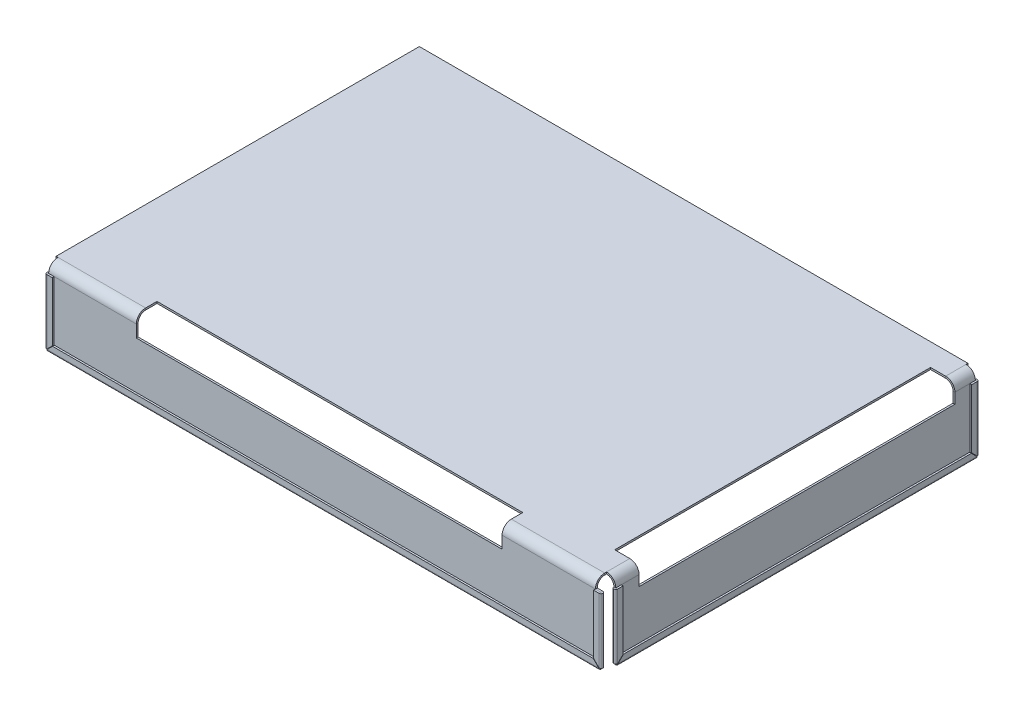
ISO-10303-21;
HEADER;
FILE_DESCRIPTION(('STEP AP214'),'2;1');
FILE_NAME('part.step','',(''),(''),'','','');
FILE_SCHEMA(('AUTOMOTIVE_DESIGN { 1 0 10303 214 1 1 1 1 }'));
ENDSEC;
DATA;
#1=APPLICATION_CONTEXT('core data for automotive mechanical design processes');
#2=APPLICATION_PROTOCOL_DEFINITION('international standard','automotive_design',2000,#1);
#3=PRODUCT_CONTEXT('',#1,'mechanical');
#4=PRODUCT('Part','Part','',(#3));
#5=PRODUCT_RELATED_PRODUCT_CATEGORY('part','',(#4));
#6=PRODUCT_DEFINITION_FORMATION('','',#4);
#7=PRODUCT_DEFINITION_CONTEXT('part definition',#1,'design');
#8=PRODUCT_DEFINITION('design','',#6,#7);
#9=PRODUCT_DEFINITION_SHAPE('','',#8);
#10=(LENGTH_UNIT() NAMED_UNIT(*) SI_UNIT(.MILLI.,.METRE.));
#11=(NAMED_UNIT(*) PLANE_ANGLE_UNIT() SI_UNIT($,.RADIAN.));
#12=(NAMED_UNIT(*) SI_UNIT($,.STERADIAN.) SOLID_ANGLE_UNIT());
#13=UNCERTAINTY_MEASURE_WITH_UNIT(LENGTH_MEASURE(1.E-05),#10,'distance_accuracy_value','');
#14=(GEOMETRIC_REPRESENTATION_CONTEXT(3) GLOBAL_UNCERTAINTY_ASSIGNED_CONTEXT((#13)) GLOBAL_UNIT_ASSIGNED_CONTEXT((#10,
#11,#12)) REPRESENTATION_CONTEXT('',''));
#15=CARTESIAN_POINT('',(0.,0.,0.));
#16=DIRECTION('',(0.,0.,1.));
#17=DIRECTION('',(1.,0.,0.));
#18=AXIS2_PLACEMENT_3D('',#15,#16,#17);
#19=CARTESIAN_POINT('',(0.505,0.500000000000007,-1.99999999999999));
#20=DIRECTION('',(0.,0.,-1.));
#21=DIRECTION('',(0.,1.,0.));
#22=AXIS2_PLACEMENT_3D('',#19,#20,#21);
#23=PLANE('',#22);
#24=DIRECTION('',(0.,-1.,0.));
#25=VECTOR('',#24,1.);
#26=CARTESIAN_POINT('',(0.505,0.500000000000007,-1.99999999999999));
#27=LINE('',#26,#25);
#28=CARTESIAN_POINT('',(0.505,0.500000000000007,-1.99999999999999));
#29=VERTEX_POINT('',#28);
#30=CARTESIAN_POINT('',(0.505,0.,-1.99999999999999));
#31=VERTEX_POINT('',#30);
#32=EDGE_CURVE('E1254',#29,#31,#27,.T.);
#33=ORIENTED_EDGE('',*,*,#32,.F.);
#34=DIRECTION('',(-1.,0.,0.));
#35=VECTOR('',#34,1.);
#36=CARTESIAN_POINT('',(0.,0.500000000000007,-1.99999999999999));
#37=LINE('',#36,#35);
#38=CARTESIAN_POINT('',(0.,0.500000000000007,-1.99999999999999));
#39=VERTEX_POINT('',#38);
#40=EDGE_CURVE('E1229',#39,#29,#37,.F.);
#41=ORIENTED_EDGE('',*,*,#40,.F.);
#42=DIRECTION('',(0.,1.,0.));
#43=VECTOR('',#42,1.);
#44=CARTESIAN_POINT('',(0.,0.,-1.99999999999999));
#45=LINE('',#44,#43);
#46=CARTESIAN_POINT('',(0.,0.,-1.99999999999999));
#47=VERTEX_POINT('',#46);
#48=EDGE_CURVE('E1225',#47,#39,#45,.T.);
#49=ORIENTED_EDGE('',*,*,#48,.F.);
#50=DIRECTION('',(-1.,0.,0.));
#51=VECTOR('',#50,1.);
#52=CARTESIAN_POINT('',(0.,0.,-1.99999999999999));
#53=LINE('',#52,#51);
#54=EDGE_CURVE('E1224',#47,#31,#53,.F.);
#55=ORIENTED_EDGE('',*,*,#54,.T.);
#56=EDGE_LOOP('',(#33,#41,#49,#55));
#57=FACE_BOUND('',#56,.T.);
#58=ADVANCED_FACE('F36',(#57),#23,.F.);
#59=CARTESIAN_POINT('',(148.,0.,-99.495));
#60=DIRECTION('',(1.,0.,0.));
#61=DIRECTION('',(0.,0.,-1.));
#62=AXIS2_PLACEMENT_3D('',#59,#60,#61);
#63=PLANE('',#62);
#64=DIRECTION('',(0.,1.,0.));
#65=VECTOR('',#64,1.);
#66=CARTESIAN_POINT('',(148.,0.,-99.495));
#67=LINE('',#66,#65);
#68=CARTESIAN_POINT('',(148.,0.,-99.495));
#69=VERTEX_POINT('',#68);
#70=CARTESIAN_POINT('',(148.,0.500000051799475,-99.495));
#71=VERTEX_POINT('',#70);
#72=EDGE_CURVE('E1289',#69,#71,#67,.T.);
#73=ORIENTED_EDGE('',*,*,#72,.F.);
#74=DIRECTION('',(0.,0.,1.));
#75=VECTOR('',#74,1.);
#76=CARTESIAN_POINT('',(148.,0.,-1.99999999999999));
#77=LINE('',#76,#75);
#78=CARTESIAN_POINT('',(148.,0.,-100.));
#79=VERTEX_POINT('',#78);
#80=EDGE_CURVE('E1228',#69,#79,#77,.F.);
#81=ORIENTED_EDGE('',*,*,#80,.T.);
#82=DIRECTION('',(0.,1.,0.));
#83=VECTOR('',#82,1.);
#84=CARTESIAN_POINT('',(148.,0.,-100.));
#85=LINE('',#84,#83);
#86=CARTESIAN_POINT('',(148.,0.5,-100.));
#87=VERTEX_POINT('',#86);
#88=EDGE_CURVE('E1230',#79,#87,#85,.T.);
#89=ORIENTED_EDGE('',*,*,#88,.T.);
#90=DIRECTION('',(0.,0.,1.));
#91=VECTOR('',#90,1.);
#92=CARTESIAN_POINT('',(148.,0.499999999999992,-1.99999999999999));
#93=LINE('',#92,#91);
#94=EDGE_CURVE('E1239',#71,#87,#93,.F.);
#95=ORIENTED_EDGE('',*,*,#94,.F.);
#96=EDGE_LOOP('',(#73,#81,#89,#95));
#97=FACE_BOUND('',#96,.T.);
#98=ADVANCED_FACE('F1400',(#97),#63,.T.);
#99=CARTESIAN_POINT('',(148.,0.499999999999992,-2.50499999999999));
#100=DIRECTION('',(-1.,0.,0.));
#101=DIRECTION('',(0.,0.,1.));
#102=AXIS2_PLACEMENT_3D('',#99,#100,#101);
#103=PLANE('',#102);
#104=DIRECTION('',(0.,-1.,0.));
#105=VECTOR('',#104,1.);
#106=CARTESIAN_POINT('',(148.,0.499999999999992,-2.50499999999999));
#107=LINE('',#106,#105);
#108=CARTESIAN_POINT('',(148.,0.499999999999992,-2.50499999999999));
#109=VERTEX_POINT('',#108);
#110=CARTESIAN_POINT('',(148.,0.,-2.50499999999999));
#111=VERTEX_POINT('',#110);
#112=EDGE_CURVE('E1271',#109,#111,#107,.T.);
#113=ORIENTED_EDGE('',*,*,#112,.F.);
#114=CARTESIAN_POINT('',(148.,0.499999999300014,-1.99999999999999));
#115=VERTEX_POINT('',#114);
#116=EDGE_CURVE('E1234',#115,#109,#93,.F.);
#117=ORIENTED_EDGE('',*,*,#116,.F.);
#118=DIRECTION('',(0.,1.,0.));
#119=VECTOR('',#118,1.);
#120=CARTESIAN_POINT('',(148.,0.,-2.00000000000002));
#121=LINE('',#120,#119);
#122=CARTESIAN_POINT('',(148.,0.,-2.00000000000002));
#123=VERTEX_POINT('',#122);
#124=EDGE_CURVE('E1249',#123,#115,#121,.T.);
#125=ORIENTED_EDGE('',*,*,#124,.F.);
#126=EDGE_CURVE('E1237',#123,#111,#77,.F.);
#127=ORIENTED_EDGE('',*,*,#126,.T.);
#128=EDGE_LOOP('',(#113,#117,#125,#127));
#129=FACE_BOUND('',#128,.T.);
#130=ADVANCED_FACE('F1406',(#129),#103,.F.);
#131=CARTESIAN_POINT('',(0.,0.5,-100.));
#132=DIRECTION('',(0.,-1.,0.));
#133=DIRECTION('',(0.,0.,-1.));
#134=AXIS2_PLACEMENT_3D('',#131,#132,#133);
#135=PLANE('',#134);
#136=DIRECTION('',(-1.,0.,0.));
#137=VECTOR('',#136,1.);
#138=CARTESIAN_POINT('',(122.821348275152,0.5,-5.08064741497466));
#139=LINE('',#138,#137);
#140=CARTESIAN_POINT('',(122.821348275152,0.5,-5.08064741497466));
#141=VERTEX_POINT('',#140);
#142=CARTESIAN_POINT('',(24.153494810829,0.5,-5.08064741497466));
#143=VERTEX_POINT('',#142);
#144=EDGE_CURVE('E1182',#141,#143,#139,.T.);
#145=ORIENTED_EDGE('',*,*,#144,.F.);
#146=DIRECTION('',(0.,0.,-1.));
#147=VECTOR('',#146,1.);
#148=CARTESIAN_POINT('',(122.821348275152,0.5,-5.08064741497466));
#149=LINE('',#148,#147);
#150=CARTESIAN_POINT('',(122.821348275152,0.5,-2.00000000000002));
#151=VERTEX_POINT('',#150);
#152=EDGE_CURVE('E1181',#151,#141,#149,.T.);
#153=ORIENTED_EDGE('',*,*,#152,.F.);
#154=DIRECTION('',(1.,0.,0.));
#155=VECTOR('',#154,1.);
#156=CARTESIAN_POINT('',(0.,0.500000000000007,-1.99999999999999));
#157=LINE('',#156,#155);
#158=EDGE_CURVE('E1233',#151,#115,#157,.T.);
#159=ORIENTED_EDGE('',*,*,#158,.T.);
#160=ORIENTED_EDGE('',*,*,#116,.T.);
#161=DIRECTION('',(0.,0.,-1.));
#162=VECTOR('',#161,1.);
#163=CARTESIAN_POINT('',(148.,0.499999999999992,-1.99999999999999));
#164=LINE('',#163,#162);
#165=CARTESIAN_POINT('',(148.,0.500000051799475,-8.7740964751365));
#166=VERTEX_POINT('',#165);
#167=EDGE_CURVE('E1263',#109,#166,#164,.T.);
#168=ORIENTED_EDGE('',*,*,#167,.T.);
#169=DIRECTION('',(1.,0.,0.));
#170=VECTOR('',#169,1.);
#171=CARTESIAN_POINT('',(154.743300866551,0.5,-8.7740964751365));
#172=LINE('',#171,#170);
#173=CARTESIAN_POINT('',(143.926771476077,0.5,-8.7740964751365));
#174=VERTEX_POINT('',#173);
#175=EDGE_CURVE('E1200',#174,#166,#172,.T.);
#176=ORIENTED_EDGE('',*,*,#175,.F.);
#177=DIRECTION('',(0.,0.,1.));
#178=VECTOR('',#177,1.);
#179=CARTESIAN_POINT('',(143.926771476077,0.5,-93.9872426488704));
#180=LINE('',#179,#178);
#181=CARTESIAN_POINT('',(143.926771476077,0.5,-93.9872426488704));
#182=VERTEX_POINT('',#181);
#183=EDGE_CURVE('E1197',#182,#174,#180,.T.);
#184=ORIENTED_EDGE('',*,*,#183,.F.);
#185=DIRECTION('',(-1.,0.,0.));
#186=VECTOR('',#185,1.);
#187=CARTESIAN_POINT('',(154.743300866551,0.5,-93.9872426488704));
#188=LINE('',#187,#186);
#189=CARTESIAN_POINT('',(148.,0.5,-93.9872426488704));
#190=VERTEX_POINT('',#189);
#191=EDGE_CURVE('E1193',#190,#182,#188,.T.);
#192=ORIENTED_EDGE('',*,*,#191,.F.);
#193=DIRECTION('',(0.,0.,-1.));
#194=VECTOR('',#193,1.);
#195=CARTESIAN_POINT('',(148.,0.499999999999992,-1.99999999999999));
#196=LINE('',#195,#194);
#197=EDGE_CURVE('E1280',#190,#71,#196,.T.);
#198=ORIENTED_EDGE('',*,*,#197,.T.);
#199=ORIENTED_EDGE('',*,*,#94,.T.);
#200=DIRECTION('',(-1.,0.,0.));
#201=VECTOR('',#200,1.);
#202=CARTESIAN_POINT('',(0.,0.5,-100.));
#203=LINE('',#202,#201);
#204=CARTESIAN_POINT('',(0.,0.5,-100.));
#205=VERTEX_POINT('',#204);
#206=EDGE_CURVE('E1219',#87,#205,#203,.T.);
#207=ORIENTED_EDGE('',*,*,#206,.T.);
#208=DIRECTION('',(0.,0.,1.));
#209=VECTOR('',#208,1.);
#210=CARTESIAN_POINT('',(0.,0.5,0.));
#211=LINE('',#210,#209);
#212=EDGE_CURVE('E1216',#205,#39,#211,.T.);
#213=ORIENTED_EDGE('',*,*,#212,.T.);
#214=ORIENTED_EDGE('',*,*,#40,.T.);
#215=DIRECTION('',(1.,0.,0.));
#216=VECTOR('',#215,1.);
#217=CARTESIAN_POINT('',(0.,0.500000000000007,-1.99999999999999));
#218=LINE('',#217,#216);
#219=CARTESIAN_POINT('',(24.153494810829,0.499999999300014,-2.00000000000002));
#220=VERTEX_POINT('',#219);
#221=EDGE_CURVE('E1252',#29,#220,#218,.T.);
#222=ORIENTED_EDGE('',*,*,#221,.T.);
#223=DIRECTION('',(0.,0.,1.));
#224=VECTOR('',#223,1.);
#225=CARTESIAN_POINT('',(24.153494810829,0.5,-5.08064741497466));
#226=LINE('',#225,#224);
#227=EDGE_CURVE('E1185',#143,#220,#226,.T.);
#228=ORIENTED_EDGE('',*,*,#227,.F.);
#229=EDGE_LOOP('',(#145,#153,#159,#160,#168,#176,#184,#192,#198,#199,#207,#213,#214,#222,#228));
#230=FACE_BOUND('',#229,.T.);
#231=ADVANCED_FACE('F1443',(#230),#135,.F.);
#232=CARTESIAN_POINT('',(0.,0.,-100.));
#233=DIRECTION('',(0.,-1.,0.));
#234=DIRECTION('',(0.,0.,-1.));
#235=AXIS2_PLACEMENT_3D('',#232,#233,#234);
#236=PLANE('',#235);
#237=DIRECTION('',(0.,0.,-1.));
#238=VECTOR('',#237,1.);
#239=CARTESIAN_POINT('',(122.821348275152,0.,-5.08064741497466));
#240=LINE('',#239,#238);
#241=CARTESIAN_POINT('',(122.821348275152,0.,-2.00000000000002));
#242=VERTEX_POINT('',#241);
#243=CARTESIAN_POINT('',(122.821348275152,0.,-5.08064741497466));
#244=VERTEX_POINT('',#243);
#245=EDGE_CURVE('E1190',#242,#244,#240,.T.);
#246=ORIENTED_EDGE('',*,*,#245,.T.);
#247=DIRECTION('',(-1.,0.,0.));
#248=VECTOR('',#247,1.);
#249=CARTESIAN_POINT('',(122.821348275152,0.,-5.08064741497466));
#250=LINE('',#249,#248);
#251=CARTESIAN_POINT('',(24.153494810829,0.,-5.08064741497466));
#252=VERTEX_POINT('',#251);
#253=EDGE_CURVE('E1186',#244,#252,#250,.T.);
#254=ORIENTED_EDGE('',*,*,#253,.T.);
#255=DIRECTION('',(0.,0.,1.));
#256=VECTOR('',#255,1.);
#257=CARTESIAN_POINT('',(24.153494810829,0.,-5.08064741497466));
#258=LINE('',#257,#256);
#259=CARTESIAN_POINT('',(24.153494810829,0.,-2.00000000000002));
#260=VERTEX_POINT('',#259);
#261=EDGE_CURVE('E1189',#252,#260,#258,.T.);
#262=ORIENTED_EDGE('',*,*,#261,.T.);
#263=DIRECTION('',(1.,0.,0.));
#264=VECTOR('',#263,1.);
#265=CARTESIAN_POINT('',(0.,0.,-1.99999999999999));
#266=LINE('',#265,#264);
#267=EDGE_CURVE('E1257',#31,#260,#266,.T.);
#268=ORIENTED_EDGE('',*,*,#267,.F.);
#269=ORIENTED_EDGE('',*,*,#54,.F.);
#270=DIRECTION('',(0.,0.,1.));
#271=VECTOR('',#270,1.);
#272=CARTESIAN_POINT('',(0.,0.,0.));
#273=LINE('',#272,#271);
#274=CARTESIAN_POINT('',(0.,0.,-100.));
#275=VERTEX_POINT('',#274);
#276=EDGE_CURVE('E1208',#275,#47,#273,.T.);
#277=ORIENTED_EDGE('',*,*,#276,.F.);
#278=DIRECTION('',(-1.,0.,0.));
#279=VECTOR('',#278,1.);
#280=CARTESIAN_POINT('',(0.,0.,-100.));
#281=LINE('',#280,#279);
#282=EDGE_CURVE('E1214',#79,#275,#281,.T.);
#283=ORIENTED_EDGE('',*,*,#282,.F.);
#284=ORIENTED_EDGE('',*,*,#80,.F.);
#285=DIRECTION('',(0.,0.,-1.));
#286=VECTOR('',#285,1.);
#287=CARTESIAN_POINT('',(148.,0.,-1.99999999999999));
#288=LINE('',#287,#286);
#289=CARTESIAN_POINT('',(148.,0.,-93.9872426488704));
#290=VERTEX_POINT('',#289);
#291=EDGE_CURVE('E1286',#290,#69,#288,.T.);
#292=ORIENTED_EDGE('',*,*,#291,.F.);
#293=DIRECTION('',(-1.,0.,0.));
#294=VECTOR('',#293,1.);
#295=CARTESIAN_POINT('',(154.743300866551,0.,-93.9872426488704));
#296=LINE('',#295,#294);
#297=CARTESIAN_POINT('',(143.926771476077,0.,-93.9872426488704));
#298=VERTEX_POINT('',#297);
#299=EDGE_CURVE('E1205',#290,#298,#296,.T.);
#300=ORIENTED_EDGE('',*,*,#299,.T.);
#301=DIRECTION('',(0.,0.,1.));
#302=VECTOR('',#301,1.);
#303=CARTESIAN_POINT('',(143.926771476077,0.,-93.9872426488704));
#304=LINE('',#303,#302);
#305=CARTESIAN_POINT('',(143.926771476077,0.,-8.7740964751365));
#306=VERTEX_POINT('',#305);
#307=EDGE_CURVE('E1201',#298,#306,#304,.T.);
#308=ORIENTED_EDGE('',*,*,#307,.T.);
#309=DIRECTION('',(1.,0.,0.));
#310=VECTOR('',#309,1.);
#311=CARTESIAN_POINT('',(154.743300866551,0.,-8.7740964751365));
#312=LINE('',#311,#310);
#313=CARTESIAN_POINT('',(148.,0.,-8.7740964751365));
#314=VERTEX_POINT('',#313);
#315=EDGE_CURVE('E1204',#306,#314,#312,.T.);
#316=ORIENTED_EDGE('',*,*,#315,.T.);
#317=DIRECTION('',(0.,0.,-1.));
#318=VECTOR('',#317,1.);
#319=CARTESIAN_POINT('',(148.,0.,-1.99999999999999));
#320=LINE('',#319,#318);
#321=EDGE_CURVE('E1274',#111,#314,#320,.T.);
#322=ORIENTED_EDGE('',*,*,#321,.F.);
#323=ORIENTED_EDGE('',*,*,#126,.F.);
#324=DIRECTION('',(1.,0.,0.));
#325=VECTOR('',#324,1.);
#326=CARTESIAN_POINT('',(0.,0.,-1.99999999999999));
#327=LINE('',#326,#325);
#328=EDGE_CURVE('E1246',#242,#123,#327,.T.);
#329=ORIENTED_EDGE('',*,*,#328,.F.);
#330=EDGE_LOOP('',(#246,#254,#262,#268,#269,#277,#283,#284,#292,#300,#308,#316,#322,#323,#329));
#331=FACE_BOUND('',#330,.T.);
#332=ADVANCED_FACE('F1463',(#331),#236,.T.);
#333=CARTESIAN_POINT('',(0.,0.5,-100.));
#334=DIRECTION('',(0.,0.,1.));
#335=DIRECTION('',(1.,0.,0.));
#336=AXIS2_PLACEMENT_3D('',#333,#334,#335);
#337=PLANE('',#336);
#338=ORIENTED_EDGE('',*,*,#88,.F.);
#339=ORIENTED_EDGE('',*,*,#282,.T.);
#340=DIRECTION('',(0.,-1.,0.));
#341=VECTOR('',#340,1.);
#342=CARTESIAN_POINT('',(0.,0.5,-100.));
#343=LINE('',#342,#341);
#344=EDGE_CURVE('E1221',#205,#275,#343,.T.);
#345=ORIENTED_EDGE('',*,*,#344,.F.);
#346=ORIENTED_EDGE('',*,*,#206,.F.);
#347=EDGE_LOOP('',(#338,#339,#345,#346));
#348=FACE_BOUND('',#347,.T.);
#349=ADVANCED_FACE('F1455',(#348),#337,.F.);
#350=CARTESIAN_POINT('',(0.,0.5,0.));
#351=DIRECTION('',(1.,0.,0.));
#352=DIRECTION('',(0.,0.,-1.));
#353=AXIS2_PLACEMENT_3D('',#350,#351,#352);
#354=PLANE('',#353);
#355=ORIENTED_EDGE('',*,*,#48,.T.);
#356=ORIENTED_EDGE('',*,*,#212,.F.);
#357=ORIENTED_EDGE('',*,*,#344,.T.);
#358=ORIENTED_EDGE('',*,*,#276,.T.);
#359=EDGE_LOOP('',(#355,#356,#357,#358));
#360=FACE_BOUND('',#359,.T.);
#361=ADVANCED_FACE('F1458',(#360),#354,.F.);
#362=CARTESIAN_POINT('',(154.743300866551,0.,-8.7740964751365));
#363=DIRECTION('',(0.,0.,1.));
#364=DIRECTION('',(1.,0.,0.));
#365=AXIS2_PLACEMENT_3D('',#362,#363,#364);
#366=PLANE('',#365);
#367=DIRECTION('',(0.,1.,0.));
#368=VECTOR('',#367,1.);
#369=CARTESIAN_POINT('',(148.,0.,-8.7740964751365));
#370=LINE('',#369,#368);
#371=EDGE_CURVE('E1277',#314,#166,#370,.T.);
#372=ORIENTED_EDGE('',*,*,#371,.F.);
#373=ORIENTED_EDGE('',*,*,#315,.F.);
#374=DIRECTION('',(0.,1.,0.));
#375=VECTOR('',#374,1.);
#376=CARTESIAN_POINT('',(143.926771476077,0.,-8.7740964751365));
#377=LINE('',#376,#375);
#378=EDGE_CURVE('E1206',#306,#174,#377,.T.);
#379=ORIENTED_EDGE('',*,*,#378,.T.);
#380=ORIENTED_EDGE('',*,*,#175,.T.);
#381=EDGE_LOOP('',(#372,#373,#379,#380));
#382=FACE_BOUND('',#381,.T.);
#383=ADVANCED_FACE('F38',(#382),#366,.F.);
#384=CARTESIAN_POINT('',(143.926771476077,0.,-93.9872426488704));
#385=DIRECTION('',(-1.,0.,0.));
#386=DIRECTION('',(0.,0.,1.));
#387=AXIS2_PLACEMENT_3D('',#384,#385,#386);
#388=PLANE('',#387);
#389=ORIENTED_EDGE('',*,*,#183,.T.);
#390=ORIENTED_EDGE('',*,*,#378,.F.);
#391=ORIENTED_EDGE('',*,*,#307,.F.);
#392=DIRECTION('',(0.,1.,0.));
#393=VECTOR('',#392,1.);
#394=CARTESIAN_POINT('',(143.926771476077,0.,-93.9872426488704));
#395=LINE('',#394,#393);
#396=EDGE_CURVE('E1209',#298,#182,#395,.T.);
#397=ORIENTED_EDGE('',*,*,#396,.T.);
#398=EDGE_LOOP('',(#389,#390,#391,#397));
#399=FACE_BOUND('',#398,.T.);
#400=ADVANCED_FACE('F1422',(#399),#388,.F.);
#401=CARTESIAN_POINT('',(154.743300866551,0.,-93.9872426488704));
#402=DIRECTION('',(0.,0.,-1.));
#403=DIRECTION('',(-1.,0.,0.));
#404=AXIS2_PLACEMENT_3D('',#401,#402,#403);
#405=PLANE('',#404);
#406=DIRECTION('',(0.,-1.,0.));
#407=VECTOR('',#406,1.);
#408=CARTESIAN_POINT('',(148.,0.5,-93.9872426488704));
#409=LINE('',#408,#407);
#410=EDGE_CURVE('E1283',#190,#290,#409,.T.);
#411=ORIENTED_EDGE('',*,*,#410,.F.);
#412=ORIENTED_EDGE('',*,*,#191,.T.);
#413=ORIENTED_EDGE('',*,*,#396,.F.);
#414=ORIENTED_EDGE('',*,*,#299,.F.);
#415=EDGE_LOOP('',(#411,#412,#413,#414));
#416=FACE_BOUND('',#415,.T.);
#417=ADVANCED_FACE('F1419',(#416),#405,.F.);
#418=CARTESIAN_POINT('',(122.821348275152,0.,-5.08064741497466));
#419=DIRECTION('',(1.,0.,0.));
#420=DIRECTION('',(0.,0.,-1.));
#421=AXIS2_PLACEMENT_3D('',#418,#419,#420);
#422=PLANE('',#421);
#423=DIRECTION('',(0.,-1.,0.));
#424=VECTOR('',#423,1.);
#425=CARTESIAN_POINT('',(122.821348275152,0.5,-2.00000000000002));
#426=LINE('',#425,#424);
#427=EDGE_CURVE('E1243',#151,#242,#426,.T.);
#428=ORIENTED_EDGE('',*,*,#427,.F.);
#429=ORIENTED_EDGE('',*,*,#152,.T.);
#430=DIRECTION('',(0.,1.,0.));
#431=VECTOR('',#430,1.);
#432=CARTESIAN_POINT('',(122.821348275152,0.,-5.08064741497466));
#433=LINE('',#432,#431);
#434=EDGE_CURVE('E1194',#244,#141,#433,.T.);
#435=ORIENTED_EDGE('',*,*,#434,.F.);
#436=ORIENTED_EDGE('',*,*,#245,.F.);
#437=EDGE_LOOP('',(#428,#429,#435,#436));
#438=FACE_BOUND('',#437,.T.);
#439=ADVANCED_FACE('F1416',(#438),#422,.F.);
#440=CARTESIAN_POINT('',(24.153494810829,0.,-5.08064741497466));
#441=DIRECTION('',(-1.,0.,0.));
#442=DIRECTION('',(0.,0.,1.));
#443=AXIS2_PLACEMENT_3D('',#440,#441,#442);
#444=PLANE('',#443);
#445=DIRECTION('',(0.,1.,0.));
#446=VECTOR('',#445,1.);
#447=CARTESIAN_POINT('',(24.153494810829,0.,-2.00000000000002));
#448=LINE('',#447,#446);
#449=EDGE_CURVE('E1260',#260,#220,#448,.T.);
#450=ORIENTED_EDGE('',*,*,#449,.F.);
#451=ORIENTED_EDGE('',*,*,#261,.F.);
#452=DIRECTION('',(0.,1.,0.));
#453=VECTOR('',#452,1.);
#454=CARTESIAN_POINT('',(24.153494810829,0.,-5.08064741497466));
#455=LINE('',#454,#453);
#456=EDGE_CURVE('E1191',#252,#143,#455,.T.);
#457=ORIENTED_EDGE('',*,*,#456,.T.);
#458=ORIENTED_EDGE('',*,*,#227,.T.);
#459=EDGE_LOOP('',(#450,#451,#457,#458));
#460=FACE_BOUND('',#459,.T.);
#461=ADVANCED_FACE('F1412',(#460),#444,.F.);
#462=CARTESIAN_POINT('',(122.821348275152,0.,-5.08064741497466));
#463=DIRECTION('',(0.,0.,-1.));
#464=DIRECTION('',(-1.,0.,0.));
#465=AXIS2_PLACEMENT_3D('',#462,#463,#464);
#466=PLANE('',#465);
#467=ORIENTED_EDGE('',*,*,#144,.T.);
#468=ORIENTED_EDGE('',*,*,#456,.F.);
#469=ORIENTED_EDGE('',*,*,#253,.F.);
#470=ORIENTED_EDGE('',*,*,#434,.T.);
#471=EDGE_LOOP('',(#467,#468,#469,#470));
#472=FACE_BOUND('',#471,.T.);
#473=ADVANCED_FACE('F1415',(#472),#466,.F.);
#474=CARTESIAN_POINT('',(122.821348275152,-1.99999999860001,-1.99999999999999));
#475=DIRECTION('',(-1.,0.,0.));
#476=DIRECTION('',(0.,0.,1.));
#477=AXIS2_PLACEMENT_3D('',#474,#475,#476);
#478=PLANE('',#477);
#479=ORIENTED_EDGE('',*,*,#427,.T.);
#480=CARTESIAN_POINT('',(122.821348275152,-1.99999999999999,-1.99999999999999));
#481=DIRECTION('',(1.,0.,0.));
#482=DIRECTION('',(0.,0.,-1.));
#483=AXIS2_PLACEMENT_3D('',#480,#481,#482);
#484=CIRCLE('',#483,1.99999999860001);
#485=CARTESIAN_POINT('',(122.821348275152,-2.00000000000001,0.));
#486=VERTEX_POINT('',#485);
#487=EDGE_CURVE('E1169',#242,#486,#484,.T.);
#488=ORIENTED_EDGE('',*,*,#487,.T.);
#489=DIRECTION('',(0.,0.,1.));
#490=VECTOR('',#489,1.);
#491=CARTESIAN_POINT('',(122.821348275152,-2.00000000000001,0.));
#492=LINE('',#491,#490);
#493=CARTESIAN_POINT('',(122.821348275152,-2.00000000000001,0.499999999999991));
#494=VERTEX_POINT('',#493);
#495=EDGE_CURVE('E1150',#486,#494,#492,.T.);
#496=ORIENTED_EDGE('',*,*,#495,.T.);
#497=CARTESIAN_POINT('',(122.821348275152,-1.99999999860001,-1.99999999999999));
#498=DIRECTION('',(1.,0.,0.));
#499=DIRECTION('',(0.,0.,1.));
#500=AXIS2_PLACEMENT_3D('',#497,#498,#499);
#501=CIRCLE('',#500,2.49999999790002);
#502=EDGE_CURVE('E1173',#151,#494,#501,.T.);
#503=ORIENTED_EDGE('',*,*,#502,.F.);
#504=EDGE_LOOP('',(#479,#488,#496,#503));
#505=FACE_BOUND('',#504,.T.);
#506=ADVANCED_FACE('F2271',(#505),#478,.T.);
#507=CARTESIAN_POINT('',(148.,-1.99999999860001,-1.99999999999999));
#508=DIRECTION('',(1.,0.,0.));
#509=DIRECTION('',(0.,0.,-1.));
#510=AXIS2_PLACEMENT_3D('',#507,#508,#509);
#511=PLANE('',#510);
#512=DIRECTION('',(0.,0.,-1.));
#513=VECTOR('',#512,1.);
#514=CARTESIAN_POINT('',(148.,-2.00000000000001,0.499999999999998));
#515=LINE('',#514,#513);
#516=CARTESIAN_POINT('',(148.,-1.99999999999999,0.49999999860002));
#517=VERTEX_POINT('',#516);
#518=CARTESIAN_POINT('',(148.,-2.00000000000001,0.));
#519=VERTEX_POINT('',#518);
#520=EDGE_CURVE('E1111',#517,#519,#515,.T.);
#521=ORIENTED_EDGE('',*,*,#520,.T.);
#522=CARTESIAN_POINT('',(148.,-1.99999999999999,-1.99999999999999));
#523=DIRECTION('',(1.,0.,0.));
#524=DIRECTION('',(0.,0.,-1.));
#525=AXIS2_PLACEMENT_3D('',#522,#523,#524);
#526=CIRCLE('',#525,1.99999999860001);
#527=EDGE_CURVE('E1170',#519,#123,#526,.F.);
#528=ORIENTED_EDGE('',*,*,#527,.T.);
#529=ORIENTED_EDGE('',*,*,#124,.T.);
#530=CARTESIAN_POINT('',(148.,-1.99999999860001,-1.99999999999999));
#531=DIRECTION('',(-1.,0.,0.));
#532=DIRECTION('',(0.,0.,1.));
#533=AXIS2_PLACEMENT_3D('',#530,#531,#532);
#534=CIRCLE('',#533,2.49999999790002);
#535=EDGE_CURVE('E1178',#517,#115,#534,.T.);
#536=ORIENTED_EDGE('',*,*,#535,.F.);
#537=EDGE_LOOP('',(#521,#528,#529,#536));
#538=FACE_BOUND('',#537,.T.);
#539=ADVANCED_FACE('F2261',(#538),#511,.T.);
#540=CARTESIAN_POINT('',(109.922720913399,-1.99999999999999,-1.99999999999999));
#541=DIRECTION('',(1.,0.,0.));
#542=DIRECTION('',(0.,0.,-1.));
#543=AXIS2_PLACEMENT_3D('',#540,#541,#542);
#544=CYLINDRICAL_SURFACE('',#543,2.49999999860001);
#545=ORIENTED_EDGE('',*,*,#535,.T.);
#546=ORIENTED_EDGE('',*,*,#158,.F.);
#547=ORIENTED_EDGE('',*,*,#502,.T.);
#548=DIRECTION('',(-1.,0.,0.));
#549=VECTOR('',#548,1.);
#550=CARTESIAN_POINT('',(0.,-2.00000000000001,0.499999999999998));
#551=LINE('',#550,#549);
#552=EDGE_CURVE('E1121',#517,#494,#551,.T.);
#553=ORIENTED_EDGE('',*,*,#552,.F.);
#554=EDGE_LOOP('',(#545,#546,#547,#553));
#555=FACE_BOUND('',#554,.T.);
#556=ADVANCED_FACE('F2251',(#555),#544,.T.);
#557=CARTESIAN_POINT('',(109.922720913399,-1.99999999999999,-1.99999999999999));
#558=DIRECTION('',(1.,0.,0.));
#559=DIRECTION('',(0.,0.,-1.));
#560=AXIS2_PLACEMENT_3D('',#557,#558,#559);
#561=CYLINDRICAL_SURFACE('',#560,1.99999999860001);
#562=ORIENTED_EDGE('',*,*,#527,.F.);
#563=DIRECTION('',(-1.,0.,0.));
#564=VECTOR('',#563,1.);
#565=CARTESIAN_POINT('',(150.,-2.00000000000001,0.));
#566=LINE('',#565,#564);
#567=EDGE_CURVE('E1153',#519,#486,#566,.T.);
#568=ORIENTED_EDGE('',*,*,#567,.T.);
#569=ORIENTED_EDGE('',*,*,#487,.F.);
#570=ORIENTED_EDGE('',*,*,#328,.T.);
#571=EDGE_LOOP('',(#562,#568,#569,#570));
#572=FACE_BOUND('',#571,.T.);
#573=ADVANCED_FACE('F2241',(#572),#561,.F.);
#574=CARTESIAN_POINT('',(24.153494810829,-1.99999999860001,-1.99999999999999));
#575=DIRECTION('',(1.,0.,0.));
#576=DIRECTION('',(0.,0.,-1.));
#577=AXIS2_PLACEMENT_3D('',#574,#575,#576);
#578=PLANE('',#577);
#579=DIRECTION('',(0.,0.,-1.));
#580=VECTOR('',#579,1.);
#581=CARTESIAN_POINT('',(24.153494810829,-2.00000000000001,0.499999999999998));
#582=LINE('',#581,#580);
#583=CARTESIAN_POINT('',(24.153494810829,-2.00000000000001,0.499999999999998));
#584=VERTEX_POINT('',#583);
#585=CARTESIAN_POINT('',(24.153494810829,-2.00000000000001,0.));
#586=VERTEX_POINT('',#585);
#587=EDGE_CURVE('E1147',#584,#586,#582,.T.);
#588=ORIENTED_EDGE('',*,*,#587,.T.);
#589=CARTESIAN_POINT('',(24.153494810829,-1.99999999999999,-1.99999999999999));
#590=DIRECTION('',(1.,0.,0.));
#591=DIRECTION('',(0.,0.,-1.));
#592=AXIS2_PLACEMENT_3D('',#589,#590,#591);
#593=CIRCLE('',#592,1.99999999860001);
#594=EDGE_CURVE('E1114',#586,#260,#593,.F.);
#595=ORIENTED_EDGE('',*,*,#594,.T.);
#596=ORIENTED_EDGE('',*,*,#449,.T.);
#597=CARTESIAN_POINT('',(24.153494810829,-1.99999999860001,-1.99999999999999));
#598=DIRECTION('',(-1.,0.,0.));
#599=DIRECTION('',(0.,0.,-1.));
#600=AXIS2_PLACEMENT_3D('',#597,#598,#599);
#601=CIRCLE('',#600,2.49999999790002);
#602=EDGE_CURVE('E1161',#584,#220,#601,.T.);
#603=ORIENTED_EDGE('',*,*,#602,.F.);
#604=EDGE_LOOP('',(#588,#595,#596,#603));
#605=FACE_BOUND('',#604,.T.);
#606=ADVANCED_FACE('F2232',(#605),#578,.T.);
#607=CARTESIAN_POINT('',(0.505000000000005,-1.99999999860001,-1.99999999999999));
#608=DIRECTION('',(-1.,0.,0.));
#609=DIRECTION('',(0.,0.,1.));
#610=AXIS2_PLACEMENT_3D('',#607,#608,#609);
#611=PLANE('',#610);
#612=ORIENTED_EDGE('',*,*,#32,.T.);
#613=CARTESIAN_POINT('',(0.505000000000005,-1.99999999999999,-1.99999999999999));
#614=DIRECTION('',(1.,0.,0.));
#615=DIRECTION('',(0.,0.,-1.));
#616=AXIS2_PLACEMENT_3D('',#613,#614,#615);
#617=CIRCLE('',#616,1.99999999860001);
#618=CARTESIAN_POINT('',(0.505000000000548,-2.00000000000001,3.53494252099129E-10));
#619=VERTEX_POINT('',#618);
#620=EDGE_CURVE('E1158',#31,#619,#617,.T.);
#621=ORIENTED_EDGE('',*,*,#620,.T.);
#622=DIRECTION('',(0.,0.,-1.));
#623=VECTOR('',#622,1.);
#624=CARTESIAN_POINT('',(0.505,-2.00000000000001,0.499999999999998));
#625=LINE('',#624,#623);
#626=CARTESIAN_POINT('',(0.505000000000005,-2.00000000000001,0.500000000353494));
#627=VERTEX_POINT('',#626);
#628=EDGE_CURVE('E1481',#627,#619,#625,.T.);
#629=ORIENTED_EDGE('',*,*,#628,.F.);
#630=CARTESIAN_POINT('',(0.505000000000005,-1.99999999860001,-1.99999999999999));
#631=DIRECTION('',(1.,0.,0.));
#632=DIRECTION('',(0.,0.,-1.));
#633=AXIS2_PLACEMENT_3D('',#630,#631,#632);
#634=CIRCLE('',#633,2.49999999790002);
#635=EDGE_CURVE('E1166',#29,#627,#634,.T.);
#636=ORIENTED_EDGE('',*,*,#635,.F.);
#637=EDGE_LOOP('',(#612,#621,#629,#636));
#638=FACE_BOUND('',#637,.T.);
#639=ADVANCED_FACE('F1471',(#638),#611,.T.);
#640=CARTESIAN_POINT('',(-11.6482954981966,-1.99999999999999,-1.99999999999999));
#641=DIRECTION('',(1.,0.,0.));
#642=DIRECTION('',(0.,0.,-1.));
#643=AXIS2_PLACEMENT_3D('',#640,#641,#642);
#644=CYLINDRICAL_SURFACE('',#643,2.49999999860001);
#645=ORIENTED_EDGE('',*,*,#635,.T.);
#646=DIRECTION('',(-1.,0.,0.));
#647=VECTOR('',#646,1.);
#648=CARTESIAN_POINT('',(0.,-2.00000000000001,0.499999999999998));
#649=LINE('',#648,#647);
#650=EDGE_CURVE('E1127',#584,#627,#649,.T.);
#651=ORIENTED_EDGE('',*,*,#650,.F.);
#652=ORIENTED_EDGE('',*,*,#602,.T.);
#653=ORIENTED_EDGE('',*,*,#221,.F.);
#654=EDGE_LOOP('',(#645,#651,#652,#653));
#655=FACE_BOUND('',#654,.T.);
#656=ADVANCED_FACE('F2215',(#655),#644,.T.);
#657=CARTESIAN_POINT('',(-11.6482954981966,-1.99999999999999,-1.99999999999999));
#658=DIRECTION('',(1.,0.,0.));
#659=DIRECTION('',(0.,0.,-1.));
#660=AXIS2_PLACEMENT_3D('',#657,#658,#659);
#661=CYLINDRICAL_SURFACE('',#660,1.99999999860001);
#662=ORIENTED_EDGE('',*,*,#620,.F.);
#663=ORIENTED_EDGE('',*,*,#267,.T.);
#664=ORIENTED_EDGE('',*,*,#594,.F.);
#665=DIRECTION('',(-1.,0.,0.));
#666=VECTOR('',#665,1.);
#667=CARTESIAN_POINT('',(150.,-2.00000000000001,0.));
#668=LINE('',#667,#666);
#669=EDGE_CURVE('E1144',#586,#619,#668,.T.);
#670=ORIENTED_EDGE('',*,*,#669,.T.);
#671=EDGE_LOOP('',(#662,#663,#664,#670));
#672=FACE_BOUND('',#671,.T.);
#673=ADVANCED_FACE('F1474',(#672),#661,.F.);
#674=CARTESIAN_POINT('',(122.821348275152,-5.28125557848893,0.));
#675=DIRECTION('',(0.,-1.,0.));
#676=DIRECTION('',(1.,0.,0.));
#677=AXIS2_PLACEMENT_3D('',#674,#675,#676);
#678=PLANE('',#677);
#679=DIRECTION('',(1.,0.,0.));
#680=VECTOR('',#679,1.);
#681=CARTESIAN_POINT('',(122.821348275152,-5.28125557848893,0.499999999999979));
#682=LINE('',#681,#680);
#683=CARTESIAN_POINT('',(24.153494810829,-5.28125557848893,0.499999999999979));
#684=VERTEX_POINT('',#683);
#685=CARTESIAN_POINT('',(122.821348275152,-5.28125557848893,0.499999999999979));
#686=VERTEX_POINT('',#685);
#687=EDGE_CURVE('E1141',#684,#686,#682,.T.);
#688=ORIENTED_EDGE('',*,*,#687,.T.);
#689=DIRECTION('',(0.,0.,1.));
#690=VECTOR('',#689,1.);
#691=CARTESIAN_POINT('',(122.821348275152,-5.28125557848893,0.));
#692=LINE('',#691,#690);
#693=CARTESIAN_POINT('',(122.821348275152,-5.28125557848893,0.));
#694=VERTEX_POINT('',#693);
#695=EDGE_CURVE('E1117',#694,#686,#692,.T.);
#696=ORIENTED_EDGE('',*,*,#695,.F.);
#697=DIRECTION('',(1.,0.,0.));
#698=VECTOR('',#697,1.);
#699=CARTESIAN_POINT('',(122.821348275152,-5.28125557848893,0.));
#700=LINE('',#699,#698);
#701=CARTESIAN_POINT('',(24.153494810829,-5.28125557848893,0.));
#702=VERTEX_POINT('',#701);
#703=EDGE_CURVE('E1135',#702,#694,#700,.T.);
#704=ORIENTED_EDGE('',*,*,#703,.F.);
#705=DIRECTION('',(0.,0.,1.));
#706=VECTOR('',#705,1.);
#707=CARTESIAN_POINT('',(24.153494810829,-5.28125557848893,0.));
#708=LINE('',#707,#706);
#709=EDGE_CURVE('E1138',#702,#684,#708,.T.);
#710=ORIENTED_EDGE('',*,*,#709,.T.);
#711=EDGE_LOOP('',(#688,#696,#704,#710));
#712=FACE_BOUND('',#711,.T.);
#713=ADVANCED_FACE('F2195',(#712),#678,.F.);
#714=CARTESIAN_POINT('',(0.,0.,0.));
#715=DIRECTION('',(0.,0.,1.));
#716=DIRECTION('',(0.,-1.,0.));
#717=AXIS2_PLACEMENT_3D('',#714,#715,#716);
#718=PLANE('',#717);
#719=ORIENTED_EDGE('',*,*,#703,.T.);
#720=DIRECTION('',(0.,1.,0.));
#721=VECTOR('',#720,1.);
#722=CARTESIAN_POINT('',(122.821348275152,5.00763823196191,0.));
#723=LINE('',#722,#721);
#724=EDGE_CURVE('E1133',#694,#486,#723,.T.);
#725=ORIENTED_EDGE('',*,*,#724,.T.);
#726=ORIENTED_EDGE('',*,*,#567,.F.);
#727=DIRECTION('',(-1.,0.,0.));
#728=VECTOR('',#727,1.);
#729=CARTESIAN_POINT('',(150.,-2.00000000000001,0.));
#730=LINE('',#729,#728);
#731=CARTESIAN_POINT('',(149.495,-2.00000000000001,0.));
#732=VERTEX_POINT('',#731);
#733=EDGE_CURVE('E1112',#732,#519,#730,.T.);
#734=ORIENTED_EDGE('',*,*,#733,.F.);
#735=DIRECTION('',(0.,-1.,0.));
#736=VECTOR('',#735,1.);
#737=CARTESIAN_POINT('',(149.495,-2.,0.));
#738=LINE('',#737,#736);
#739=CARTESIAN_POINT('',(149.495,-19.495,-1.04645401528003E-07));
#740=VERTEX_POINT('',#739);
#741=EDGE_CURVE('E1320',#732,#740,#738,.T.);
#742=ORIENTED_EDGE('',*,*,#741,.T.);
#743=DIRECTION('',(-1.,0.,0.));
#744=VECTOR('',#743,1.);
#745=CARTESIAN_POINT('',(149.495,-19.495,0.));
#746=LINE('',#745,#744);
#747=CARTESIAN_POINT('',(0.505000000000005,-19.4949999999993,-1.36463055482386E-08));
#748=VERTEX_POINT('',#747);
#749=EDGE_CURVE('E961',#740,#748,#746,.T.);
#750=ORIENTED_EDGE('',*,*,#749,.T.);
#751=DIRECTION('',(0.,1.,0.));
#752=VECTOR('',#751,1.);
#753=CARTESIAN_POINT('',(0.504999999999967,-19.495,0.));
#754=LINE('',#753,#752);
#755=EDGE_CURVE('E46',#748,#619,#754,.T.);
#756=ORIENTED_EDGE('',*,*,#755,.T.);
#757=ORIENTED_EDGE('',*,*,#669,.F.);
#758=DIRECTION('',(0.,-1.,0.));
#759=VECTOR('',#758,1.);
#760=CARTESIAN_POINT('',(24.153494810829,5.00763823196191,0.));
#761=LINE('',#760,#759);
#762=EDGE_CURVE('E1130',#586,#702,#761,.T.);
#763=ORIENTED_EDGE('',*,*,#762,.T.);
#764=EDGE_LOOP('',(#719,#725,#726,#734,#742,#750,#756,#757,#763));
#765=FACE_BOUND('',#764,.T.);
#766=ADVANCED_FACE('F1478',(#765),#718,.F.);
#767=CARTESIAN_POINT('',(0.,0.,0.499999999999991));
#768=DIRECTION('',(0.,0.,1.));
#769=DIRECTION('',(0.,-1.,0.));
#770=AXIS2_PLACEMENT_3D('',#767,#768,#769);
#771=PLANE('',#770);
#772=DIRECTION('',(0.,1.,0.));
#773=VECTOR('',#772,1.);
#774=CARTESIAN_POINT('',(122.821348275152,5.00763823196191,0.500000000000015));
#775=LINE('',#774,#773);
#776=EDGE_CURVE('E1115',#686,#494,#775,.T.);
#777=ORIENTED_EDGE('',*,*,#776,.F.);
#778=ORIENTED_EDGE('',*,*,#687,.F.);
#779=DIRECTION('',(0.,-1.,0.));
#780=VECTOR('',#779,1.);
#781=CARTESIAN_POINT('',(24.153494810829,0.,0.499999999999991));
#782=LINE('',#781,#780);
#783=EDGE_CURVE('E1119',#584,#684,#782,.T.);
#784=ORIENTED_EDGE('',*,*,#783,.F.);
#785=ORIENTED_EDGE('',*,*,#650,.T.);
#786=DIRECTION('',(0.,1.,0.));
#787=VECTOR('',#786,1.);
#788=CARTESIAN_POINT('',(0.505,-19.495,0.500000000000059));
#789=LINE('',#788,#787);
#790=CARTESIAN_POINT('',(0.505,-19.495,0.500000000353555));
#791=VERTEX_POINT('',#790);
#792=EDGE_CURVE('E1348',#791,#627,#789,.T.);
#793=ORIENTED_EDGE('',*,*,#792,.F.);
#794=DIRECTION('',(-1.,0.,0.));
#795=VECTOR('',#794,1.);
#796=CARTESIAN_POINT('',(149.495,-19.495,0.500000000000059));
#797=LINE('',#796,#795);
#798=CARTESIAN_POINT('',(149.495,-19.495,0.499999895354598));
#799=VERTEX_POINT('',#798);
#800=EDGE_CURVE('E1306',#799,#791,#797,.T.);
#801=ORIENTED_EDGE('',*,*,#800,.F.);
#802=DIRECTION('',(0.,-1.,0.));
#803=VECTOR('',#802,1.);
#804=CARTESIAN_POINT('',(149.495,-2.,0.499999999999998));
#805=LINE('',#804,#803);
#806=CARTESIAN_POINT('',(149.495,-2.,0.499999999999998));
#807=VERTEX_POINT('',#806);
#808=EDGE_CURVE('E1314',#807,#799,#805,.T.);
#809=ORIENTED_EDGE('',*,*,#808,.F.);
#810=DIRECTION('',(-1.,0.,0.));
#811=VECTOR('',#810,1.);
#812=CARTESIAN_POINT('',(0.,-2.00000000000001,0.499999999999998));
#813=LINE('',#812,#811);
#814=EDGE_CURVE('E1124',#807,#517,#813,.T.);
#815=ORIENTED_EDGE('',*,*,#814,.T.);
#816=ORIENTED_EDGE('',*,*,#552,.T.);
#817=EDGE_LOOP('',(#777,#778,#784,#785,#793,#801,#809,#815,#816));
#818=FACE_BOUND('',#817,.T.);
#819=ADVANCED_FACE('F1345',(#818),#771,.T.);
#820=CARTESIAN_POINT('',(24.153494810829,5.00763823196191,0.));
#821=DIRECTION('',(-1.,0.,0.));
#822=DIRECTION('',(0.,-1.,0.));
#823=AXIS2_PLACEMENT_3D('',#820,#821,#822);
#824=PLANE('',#823);
#825=ORIENTED_EDGE('',*,*,#587,.F.);
#826=ORIENTED_EDGE('',*,*,#783,.T.);
#827=ORIENTED_EDGE('',*,*,#709,.F.);
#828=ORIENTED_EDGE('',*,*,#762,.F.);
#829=EDGE_LOOP('',(#825,#826,#827,#828));
#830=FACE_BOUND('',#829,.T.);
#831=ADVANCED_FACE('F2166',(#830),#824,.F.);
#832=CARTESIAN_POINT('',(122.821348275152,5.00763823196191,0.));
#833=DIRECTION('',(1.,0.,0.));
#834=DIRECTION('',(0.,1.,0.));
#835=AXIS2_PLACEMENT_3D('',#832,#833,#834);
#836=PLANE('',#835);
#837=ORIENTED_EDGE('',*,*,#495,.F.);
#838=ORIENTED_EDGE('',*,*,#724,.F.);
#839=ORIENTED_EDGE('',*,*,#695,.T.);
#840=ORIENTED_EDGE('',*,*,#776,.T.);
#841=EDGE_LOOP('',(#837,#838,#839,#840));
#842=FACE_BOUND('',#841,.T.);
#843=ADVANCED_FACE('F2157',(#842),#836,.F.);
#844=CARTESIAN_POINT('',(148.,-2.00000000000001,0.499999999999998));
#845=DIRECTION('',(0.,1.,0.));
#846=DIRECTION('',(0.,0.,1.));
#847=AXIS2_PLACEMENT_3D('',#844,#845,#846);
#848=PLANE('',#847);
#849=ORIENTED_EDGE('',*,*,#814,.F.);
#850=DIRECTION('',(0.,0.,-1.));
#851=VECTOR('',#850,1.);
#852=CARTESIAN_POINT('',(149.495,-2.,0.499999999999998));
#853=LINE('',#852,#851);
#854=EDGE_CURVE('E975',#807,#732,#853,.T.);
#855=ORIENTED_EDGE('',*,*,#854,.T.);
#856=ORIENTED_EDGE('',*,*,#733,.T.);
#857=ORIENTED_EDGE('',*,*,#520,.F.);
#858=EDGE_LOOP('',(#849,#855,#856,#857));
#859=FACE_BOUND('',#858,.T.);
#860=ADVANCED_FACE('F1326',(#859),#848,.T.);
#861=CARTESIAN_POINT('',(148.,-2.00000010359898,-8.7740964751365));
#862=DIRECTION('',(0.,0.,-1.));
#863=DIRECTION('',(-1.,0.,0.));
#864=AXIS2_PLACEMENT_3D('',#861,#862,#863);
#865=PLANE('',#864);
#866=DIRECTION('',(-1.,0.,0.));
#867=VECTOR('',#866,1.);
#868=CARTESIAN_POINT('',(150.5,-2.,-8.7740964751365));
#869=LINE('',#868,#867);
#870=CARTESIAN_POINT('',(150.5,-2.,-8.7740964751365));
#871=VERTEX_POINT('',#870);
#872=CARTESIAN_POINT('',(150.,-2.,-8.7740964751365));
#873=VERTEX_POINT('',#872);
#874=EDGE_CURVE('E1085',#871,#873,#869,.T.);
#875=ORIENTED_EDGE('',*,*,#874,.T.);
#876=CARTESIAN_POINT('',(148.,-2.00000000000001,-8.7740964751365));
#877=DIRECTION('',(0.,0.,-1.));
#878=DIRECTION('',(-1.,0.,0.));
#879=AXIS2_PLACEMENT_3D('',#876,#877,#878);
#880=CIRCLE('',#879,2.00000010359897);
#881=EDGE_CURVE('E1099',#873,#314,#880,.F.);
#882=ORIENTED_EDGE('',*,*,#881,.T.);
#883=ORIENTED_EDGE('',*,*,#371,.T.);
#884=CARTESIAN_POINT('',(148.,-2.00000010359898,-8.7740964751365));
#885=DIRECTION('',(0.,0.,1.));
#886=DIRECTION('',(-1.,0.,0.));
#887=AXIS2_PLACEMENT_3D('',#884,#885,#886);
#888=CIRCLE('',#887,2.50000015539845);
#889=EDGE_CURVE('E1103',#871,#166,#888,.T.);
#890=ORIENTED_EDGE('',*,*,#889,.F.);
#891=EDGE_LOOP('',(#875,#882,#883,#890));
#892=FACE_BOUND('',#891,.T.);
#893=ADVANCED_FACE('F2138',(#892),#865,.T.);
#894=CARTESIAN_POINT('',(148.,-2.00000010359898,-2.50499999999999));
#895=DIRECTION('',(0.,0.,1.));
#896=DIRECTION('',(1.,0.,0.));
#897=AXIS2_PLACEMENT_3D('',#894,#895,#896);
#898=PLANE('',#897);
#899=ORIENTED_EDGE('',*,*,#112,.T.);
#900=CARTESIAN_POINT('',(148.,-2.00000000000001,-2.50499999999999));
#901=DIRECTION('',(0.,0.,-1.));
#902=DIRECTION('',(-1.,0.,0.));
#903=AXIS2_PLACEMENT_3D('',#900,#901,#902);
#904=CIRCLE('',#903,2.00000010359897);
#905=CARTESIAN_POINT('',(150.000000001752,-2.,-2.50500000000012));
#906=VERTEX_POINT('',#905);
#907=EDGE_CURVE('E1100',#111,#906,#904,.T.);
#908=ORIENTED_EDGE('',*,*,#907,.T.);
#909=DIRECTION('',(-1.,0.,0.));
#910=VECTOR('',#909,1.);
#911=CARTESIAN_POINT('',(150.5,-2.,-2.50499999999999));
#912=LINE('',#911,#910);
#913=CARTESIAN_POINT('',(150.500000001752,-2.,-2.50499999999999));
#914=VERTEX_POINT('',#913);
#915=EDGE_CURVE('E974',#914,#906,#912,.T.);
#916=ORIENTED_EDGE('',*,*,#915,.F.);
#917=CARTESIAN_POINT('',(148.,-2.00000010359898,-2.50499999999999));
#918=DIRECTION('',(0.,0.,-1.));
#919=DIRECTION('',(-1.,0.,0.));
#920=AXIS2_PLACEMENT_3D('',#917,#918,#919);
#921=CIRCLE('',#920,2.50000015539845);
#922=EDGE_CURVE('E1108',#109,#914,#921,.T.);
#923=ORIENTED_EDGE('',*,*,#922,.F.);
#924=EDGE_LOOP('',(#899,#908,#916,#923));
#925=FACE_BOUND('',#924,.T.);
#926=ADVANCED_FACE('F2128',(#925),#898,.T.);
#927=CARTESIAN_POINT('',(148.,-2.00000000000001,1.77481805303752));
#928=DIRECTION('',(0.,0.,-1.));
#929=DIRECTION('',(-1.,0.,0.));
#930=AXIS2_PLACEMENT_3D('',#927,#928,#929);
#931=CYLINDRICAL_SURFACE('',#930,2.50000010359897);
#932=ORIENTED_EDGE('',*,*,#922,.T.);
#933=DIRECTION('',(0.,0.,1.));
#934=VECTOR('',#933,1.);
#935=CARTESIAN_POINT('',(150.5,-2.,-1.99999999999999));
#936=LINE('',#935,#934);
#937=EDGE_CURVE('E1068',#871,#914,#936,.T.);
#938=ORIENTED_EDGE('',*,*,#937,.F.);
#939=ORIENTED_EDGE('',*,*,#889,.T.);
#940=ORIENTED_EDGE('',*,*,#167,.F.);
#941=EDGE_LOOP('',(#932,#938,#939,#940));
#942=FACE_BOUND('',#941,.T.);
#943=ADVANCED_FACE('F2118',(#942),#931,.T.);
#944=CARTESIAN_POINT('',(148.,-2.00000000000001,1.77481805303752));
#945=DIRECTION('',(0.,0.,-1.));
#946=DIRECTION('',(-1.,0.,0.));
#947=AXIS2_PLACEMENT_3D('',#944,#945,#946);
#948=CYLINDRICAL_SURFACE('',#947,2.00000010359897);
#949=ORIENTED_EDGE('',*,*,#907,.F.);
#950=ORIENTED_EDGE('',*,*,#321,.T.);
#951=ORIENTED_EDGE('',*,*,#881,.F.);
#952=DIRECTION('',(0.,0.,1.));
#953=VECTOR('',#952,1.);
#954=CARTESIAN_POINT('',(150.,-2.,-100.));
#955=LINE('',#954,#953);
#956=EDGE_CURVE('E1082',#873,#906,#955,.T.);
#957=ORIENTED_EDGE('',*,*,#956,.T.);
#958=EDGE_LOOP('',(#949,#950,#951,#957));
#959=FACE_BOUND('',#958,.T.);
#960=ADVANCED_FACE('F2109',(#959),#948,.F.);
#961=CARTESIAN_POINT('',(148.,-2.00000010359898,-93.9872426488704));
#962=DIRECTION('',(0.,0.,1.));
#963=DIRECTION('',(1.,0.,0.));
#964=AXIS2_PLACEMENT_3D('',#961,#962,#963);
#965=PLANE('',#964);
#966=ORIENTED_EDGE('',*,*,#410,.T.);
#967=CARTESIAN_POINT('',(148.,-2.00000000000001,-93.9872426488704));
#968=DIRECTION('',(0.,0.,-1.));
#969=DIRECTION('',(-1.,0.,0.));
#970=AXIS2_PLACEMENT_3D('',#967,#968,#969);
#971=CIRCLE('',#970,2.00000010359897);
#972=CARTESIAN_POINT('',(150.,-2.,-93.9872426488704));
#973=VERTEX_POINT('',#972);
#974=EDGE_CURVE('E1051',#290,#973,#971,.T.);
#975=ORIENTED_EDGE('',*,*,#974,.T.);
#976=DIRECTION('',(1.,0.,0.));
#977=VECTOR('',#976,1.);
#978=CARTESIAN_POINT('',(150.,-2.,-93.9872426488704));
#979=LINE('',#978,#977);
#980=CARTESIAN_POINT('',(150.5,-2.,-93.9872426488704));
#981=VERTEX_POINT('',#980);
#982=EDGE_CURVE('E1076',#973,#981,#979,.T.);
#983=ORIENTED_EDGE('',*,*,#982,.T.);
#984=CARTESIAN_POINT('',(148.,-2.00000010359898,-93.9872426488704));
#985=DIRECTION('',(0.,0.,-1.));
#986=DIRECTION('',(1.,0.,0.));
#987=AXIS2_PLACEMENT_3D('',#984,#985,#986);
#988=CIRCLE('',#987,2.50000015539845);
#989=EDGE_CURVE('E1091',#190,#981,#988,.T.);
#990=ORIENTED_EDGE('',*,*,#989,.F.);
#991=EDGE_LOOP('',(#966,#975,#983,#990));
#992=FACE_BOUND('',#991,.T.);
#993=ADVANCED_FACE('F1435',(#992),#965,.T.);
#994=CARTESIAN_POINT('',(148.,-2.00000010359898,-99.495));
#995=DIRECTION('',(0.,0.,-1.));
#996=DIRECTION('',(-1.,0.,0.));
#997=AXIS2_PLACEMENT_3D('',#994,#995,#996);
#998=PLANE('',#997);
#999=DIRECTION('',(-1.,0.,0.));
#1000=VECTOR('',#999,1.);
#1001=CARTESIAN_POINT('',(150.5,-2.,-99.495));
#1002=LINE('',#1001,#1000);
#1003=CARTESIAN_POINT('',(150.5,-2.,-99.495));
#1004=VERTEX_POINT('',#1003);
#1005=CARTESIAN_POINT('',(150.,-2.,-99.495));
#1006=VERTEX_POINT('',#1005);
#1007=EDGE_CURVE('E1494',#1004,#1006,#1002,.T.);
#1008=ORIENTED_EDGE('',*,*,#1007,.T.);
#1009=CARTESIAN_POINT('',(148.,-2.00000000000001,-99.495));
#1010=DIRECTION('',(0.,0.,-1.));
#1011=DIRECTION('',(-1.,0.,0.));
#1012=AXIS2_PLACEMENT_3D('',#1009,#1010,#1011);
#1013=CIRCLE('',#1012,2.00000010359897);
#1014=EDGE_CURVE('E1088',#1006,#69,#1013,.F.);
#1015=ORIENTED_EDGE('',*,*,#1014,.T.);
#1016=ORIENTED_EDGE('',*,*,#72,.T.);
#1017=CARTESIAN_POINT('',(148.,-2.00000010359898,-99.495));
#1018=DIRECTION('',(0.,0.,1.));
#1019=DIRECTION('',(1.,0.,0.));
#1020=AXIS2_PLACEMENT_3D('',#1017,#1018,#1019);
#1021=CIRCLE('',#1020,2.50000015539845);
#1022=EDGE_CURVE('E1096',#1004,#71,#1021,.T.);
#1023=ORIENTED_EDGE('',*,*,#1022,.F.);
#1024=EDGE_LOOP('',(#1008,#1015,#1016,#1023));
#1025=FACE_BOUND('',#1024,.T.);
#1026=ADVANCED_FACE('F1448',(#1025),#998,.T.);
#1027=CARTESIAN_POINT('',(148.,-2.00000000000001,-89.9583012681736));
#1028=DIRECTION('',(0.,0.,-1.));
#1029=DIRECTION('',(-1.,0.,0.));
#1030=AXIS2_PLACEMENT_3D('',#1027,#1028,#1029);
#1031=CYLINDRICAL_SURFACE('',#1030,2.50000010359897);
#1032=ORIENTED_EDGE('',*,*,#1022,.T.);
#1033=ORIENTED_EDGE('',*,*,#197,.F.);
#1034=ORIENTED_EDGE('',*,*,#989,.T.);
#1035=DIRECTION('',(0.,0.,1.));
#1036=VECTOR('',#1035,1.);
#1037=CARTESIAN_POINT('',(150.5,-2.,-1.99999999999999));
#1038=LINE('',#1037,#1036);
#1039=EDGE_CURVE('E1065',#1004,#981,#1038,.T.);
#1040=ORIENTED_EDGE('',*,*,#1039,.F.);
#1041=EDGE_LOOP('',(#1032,#1033,#1034,#1040));
#1042=FACE_BOUND('',#1041,.T.);
#1043=ADVANCED_FACE('F1439',(#1042),#1031,.T.);
#1044=CARTESIAN_POINT('',(148.,-2.00000000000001,-89.9583012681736));
#1045=DIRECTION('',(0.,0.,-1.));
#1046=DIRECTION('',(-1.,0.,0.));
#1047=AXIS2_PLACEMENT_3D('',#1044,#1045,#1046);
#1048=CYLINDRICAL_SURFACE('',#1047,2.00000010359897);
#1049=ORIENTED_EDGE('',*,*,#1014,.F.);
#1050=DIRECTION('',(0.,0.,1.));
#1051=VECTOR('',#1050,1.);
#1052=CARTESIAN_POINT('',(150.,-2.,-100.));
#1053=LINE('',#1052,#1051);
#1054=EDGE_CURVE('E1079',#1006,#973,#1053,.T.);
#1055=ORIENTED_EDGE('',*,*,#1054,.T.);
#1056=ORIENTED_EDGE('',*,*,#974,.F.);
#1057=ORIENTED_EDGE('',*,*,#291,.T.);
#1058=EDGE_LOOP('',(#1049,#1055,#1056,#1057));
#1059=FACE_BOUND('',#1058,.T.);
#1060=ADVANCED_FACE('F2075',(#1059),#1048,.F.);
#1061=CARTESIAN_POINT('',(150.,-4.81631004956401,-93.9872426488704));
#1062=DIRECTION('',(0.,-1.,0.));
#1063=DIRECTION('',(0.,0.,-1.));
#1064=AXIS2_PLACEMENT_3D('',#1061,#1062,#1063);
#1065=PLANE('',#1064);
#1066=DIRECTION('',(0.,0.,-1.));
#1067=VECTOR('',#1066,1.);
#1068=CARTESIAN_POINT('',(150.5,-4.81631004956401,-93.9872426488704));
#1069=LINE('',#1068,#1067);
#1070=CARTESIAN_POINT('',(150.5,-4.81631004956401,-8.7740964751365));
#1071=VERTEX_POINT('',#1070);
#1072=CARTESIAN_POINT('',(150.5,-4.81631004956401,-93.9872426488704));
#1073=VERTEX_POINT('',#1072);
#1074=EDGE_CURVE('E1074',#1071,#1073,#1069,.T.);
#1075=ORIENTED_EDGE('',*,*,#1074,.T.);
#1076=DIRECTION('',(1.,0.,0.));
#1077=VECTOR('',#1076,1.);
#1078=CARTESIAN_POINT('',(150.,-4.81631004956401,-93.9872426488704));
#1079=LINE('',#1078,#1077);
#1080=CARTESIAN_POINT('',(150.,-4.81631004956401,-93.9872426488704));
#1081=VERTEX_POINT('',#1080);
#1082=EDGE_CURVE('E1062',#1081,#1073,#1079,.T.);
#1083=ORIENTED_EDGE('',*,*,#1082,.F.);
#1084=DIRECTION('',(0.,0.,-1.));
#1085=VECTOR('',#1084,1.);
#1086=CARTESIAN_POINT('',(150.,-4.81631004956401,-93.9872426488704));
#1087=LINE('',#1086,#1085);
#1088=CARTESIAN_POINT('',(150.,-4.81631004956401,-8.7740964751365));
#1089=VERTEX_POINT('',#1088);
#1090=EDGE_CURVE('E1054',#1089,#1081,#1087,.T.);
#1091=ORIENTED_EDGE('',*,*,#1090,.F.);
#1092=DIRECTION('',(1.,0.,0.));
#1093=VECTOR('',#1092,1.);
#1094=CARTESIAN_POINT('',(150.,-4.81631004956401,-8.7740964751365));
#1095=LINE('',#1094,#1093);
#1096=EDGE_CURVE('E1071',#1089,#1071,#1095,.T.);
#1097=ORIENTED_EDGE('',*,*,#1096,.T.);
#1098=EDGE_LOOP('',(#1075,#1083,#1091,#1097));
#1099=FACE_BOUND('',#1098,.T.);
#1100=ADVANCED_FACE('F1017',(#1099),#1065,.F.);
#1101=CARTESIAN_POINT('',(150.5,0.,-1.99999999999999));
#1102=DIRECTION('',(1.,0.,0.));
#1103=DIRECTION('',(0.,1.,0.));
#1104=AXIS2_PLACEMENT_3D('',#1101,#1102,#1103);
#1105=PLANE('',#1104);
#1106=DIRECTION('',(0.,-1.,0.));
#1107=VECTOR('',#1106,1.);
#1108=CARTESIAN_POINT('',(150.5,0.,-8.7740964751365));
#1109=LINE('',#1108,#1107);
#1110=EDGE_CURVE('E1044',#871,#1071,#1109,.T.);
#1111=ORIENTED_EDGE('',*,*,#1110,.F.);
#1112=ORIENTED_EDGE('',*,*,#937,.T.);
#1113=DIRECTION('',(0.,1.,0.));
#1114=VECTOR('',#1113,1.);
#1115=CARTESIAN_POINT('',(150.5,-19.495,-2.50499999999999));
#1116=LINE('',#1115,#1114);
#1117=CARTESIAN_POINT('',(150.500000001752,-19.495,-2.50499999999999));
#1118=VERTEX_POINT('',#1117);
#1119=EDGE_CURVE('E972',#1118,#914,#1116,.T.);
#1120=ORIENTED_EDGE('',*,*,#1119,.F.);
#1121=DIRECTION('',(0.,0.,1.));
#1122=VECTOR('',#1121,1.);
#1123=CARTESIAN_POINT('',(150.5,-19.495,-99.495));
#1124=LINE('',#1123,#1122);
#1125=CARTESIAN_POINT('',(150.499999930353,-19.495,-99.495));
#1126=VERTEX_POINT('',#1125);
#1127=EDGE_CURVE('E1292',#1126,#1118,#1124,.T.);
#1128=ORIENTED_EDGE('',*,*,#1127,.F.);
#1129=DIRECTION('',(0.,-1.,0.));
#1130=VECTOR('',#1129,1.);
#1131=CARTESIAN_POINT('',(150.5,-2.,-99.495));
#1132=LINE('',#1131,#1130);
#1133=EDGE_CURVE('E1510',#1004,#1126,#1132,.T.);
#1134=ORIENTED_EDGE('',*,*,#1133,.F.);
#1135=ORIENTED_EDGE('',*,*,#1039,.T.);
#1136=DIRECTION('',(0.,1.,0.));
#1137=VECTOR('',#1136,1.);
#1138=CARTESIAN_POINT('',(150.5,-4.81631004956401,-93.9872426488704));
#1139=LINE('',#1138,#1137);
#1140=EDGE_CURVE('E1060',#1073,#981,#1139,.T.);
#1141=ORIENTED_EDGE('',*,*,#1140,.F.);
#1142=ORIENTED_EDGE('',*,*,#1074,.F.);
#1143=EDGE_LOOP('',(#1111,#1112,#1120,#1128,#1134,#1135,#1141,#1142));
#1144=FACE_BOUND('',#1143,.T.);
#1145=ADVANCED_FACE('F1518',(#1144),#1105,.T.);
#1146=CARTESIAN_POINT('',(150.,-4.81631004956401,-93.9872426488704));
#1147=DIRECTION('',(0.,0.,-1.));
#1148=DIRECTION('',(0.,1.,0.));
#1149=AXIS2_PLACEMENT_3D('',#1146,#1147,#1148);
#1150=PLANE('',#1149);
#1151=ORIENTED_EDGE('',*,*,#982,.F.);
#1152=DIRECTION('',(0.,1.,0.));
#1153=VECTOR('',#1152,1.);
#1154=CARTESIAN_POINT('',(150.,-4.81631004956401,-93.9872426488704));
#1155=LINE('',#1154,#1153);
#1156=EDGE_CURVE('E1052',#1081,#973,#1155,.T.);
#1157=ORIENTED_EDGE('',*,*,#1156,.F.);
#1158=ORIENTED_EDGE('',*,*,#1082,.T.);
#1159=ORIENTED_EDGE('',*,*,#1140,.T.);
#1160=EDGE_LOOP('',(#1151,#1157,#1158,#1159));
#1161=FACE_BOUND('',#1160,.T.);
#1162=ADVANCED_FACE('F2048',(#1161),#1150,.F.);
#1163=CARTESIAN_POINT('',(150.,0.,-1.99999999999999));
#1164=DIRECTION('',(1.,0.,0.));
#1165=DIRECTION('',(0.,1.,0.));
#1166=AXIS2_PLACEMENT_3D('',#1163,#1164,#1165);
#1167=PLANE('',#1166);
#1168=ORIENTED_EDGE('',*,*,#956,.F.);
#1169=DIRECTION('',(0.,-1.,0.));
#1170=VECTOR('',#1169,1.);
#1171=CARTESIAN_POINT('',(150.,-4.81631004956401,-8.7740964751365));
#1172=LINE('',#1171,#1170);
#1173=EDGE_CURVE('E1057',#873,#1089,#1172,.T.);
#1174=ORIENTED_EDGE('',*,*,#1173,.T.);
#1175=ORIENTED_EDGE('',*,*,#1090,.T.);
#1176=ORIENTED_EDGE('',*,*,#1156,.T.);
#1177=ORIENTED_EDGE('',*,*,#1054,.F.);
#1178=DIRECTION('',(0.,-1.,0.));
#1179=VECTOR('',#1178,1.);
#1180=CARTESIAN_POINT('',(150.,-2.,-99.495));
#1181=LINE('',#1180,#1179);
#1182=CARTESIAN_POINT('',(149.999999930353,-19.495,-99.495));
#1183=VERTEX_POINT('',#1182);
#1184=EDGE_CURVE('E1504',#1006,#1183,#1181,.T.);
#1185=ORIENTED_EDGE('',*,*,#1184,.T.);
#1186=DIRECTION('',(0.,0.,1.));
#1187=VECTOR('',#1186,1.);
#1188=CARTESIAN_POINT('',(150.,-19.4950000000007,-99.495));
#1189=LINE('',#1188,#1187);
#1190=CARTESIAN_POINT('',(149.999999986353,-19.4949999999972,-2.50499999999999));
#1191=VERTEX_POINT('',#1190);
#1192=EDGE_CURVE('E1301',#1183,#1191,#1189,.T.);
#1193=ORIENTED_EDGE('',*,*,#1192,.T.);
#1194=DIRECTION('',(0.,1.,0.));
#1195=VECTOR('',#1194,1.);
#1196=CARTESIAN_POINT('',(150.,-19.495,-2.50499999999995));
#1197=LINE('',#1196,#1195);
#1198=EDGE_CURVE('E979',#1191,#906,#1197,.T.);
#1199=ORIENTED_EDGE('',*,*,#1198,.T.);
#1200=EDGE_LOOP('',(#1168,#1174,#1175,#1176,#1177,#1185,#1193,#1199));
#1201=FACE_BOUND('',#1200,.T.);
#1202=ADVANCED_FACE('F1543',(#1201),#1167,.F.);
#1203=CARTESIAN_POINT('',(150.,-4.81631004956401,-8.7740964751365));
#1204=DIRECTION('',(0.,0.,1.));
#1205=DIRECTION('',(0.,-1.,0.));
#1206=AXIS2_PLACEMENT_3D('',#1203,#1204,#1205);
#1207=PLANE('',#1206);
#1208=ORIENTED_EDGE('',*,*,#874,.F.);
#1209=ORIENTED_EDGE('',*,*,#1110,.T.);
#1210=ORIENTED_EDGE('',*,*,#1096,.F.);
#1211=ORIENTED_EDGE('',*,*,#1173,.F.);
#1212=EDGE_LOOP('',(#1208,#1209,#1210,#1211));
#1213=FACE_BOUND('',#1212,.T.);
#1214=ADVANCED_FACE('F1398',(#1213),#1207,.F.);
#1215=CARTESIAN_POINT('',(151.015050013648,-19.4949999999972,-99.4242893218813));
#1216=CARTESIAN_POINT('',(151.015050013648,-19.6289050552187,-99.4304762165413));
#1217=CARTESIAN_POINT('',(150.960080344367,-19.7612393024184,-99.4365589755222));
#1218=CARTESIAN_POINT('',(150.771239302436,-19.9500803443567,-99.4486209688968));
#1219=CARTESIAN_POINT('',(150.638530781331,-20.0050500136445,-99.4545827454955));
#1220=CARTESIAN_POINT('',(150.371469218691,-20.0050500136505,-99.4663678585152));
#1221=CARTESIAN_POINT('',(150.238760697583,-19.9500803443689,-99.4721911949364));
#1222=CARTESIAN_POINT('',(150.04991965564,-19.7612393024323,-99.4836994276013));
#1223=CARTESIAN_POINT('',(149.994949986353,-19.6289051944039,-99.4893684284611));
#1224=CARTESIAN_POINT('',(149.994949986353,-19.495,-99.495));
#1225=CARTESIAN_POINT('',(151.010000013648,-19.4949999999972,-99.4242893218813));
#1226=CARTESIAN_POINT('',(151.010000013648,-19.6275792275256,-99.4304760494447));
#1227=CARTESIAN_POINT('',(150.955574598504,-19.7586032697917,-99.4365589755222));
#1228=CARTESIAN_POINT('',(150.768603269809,-19.9455745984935,-99.4486209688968));
#1229=CARTESIAN_POINT('',(150.637208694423,-20.0000000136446,-99.4545827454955));
#1230=CARTESIAN_POINT('',(150.3727913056,-20.0000000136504,-99.4663678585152));
#1231=CARTESIAN_POINT('',(150.24139673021,-19.9455745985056,-99.4721911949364));
#1232=CARTESIAN_POINT('',(150.054425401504,-19.7586032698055,-99.4836994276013));
#1233=CARTESIAN_POINT('',(149.999999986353,-19.6275793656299,-99.4893685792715));
#1234=CARTESIAN_POINT('',(149.999999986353,-19.495,-99.495));
#1235=CARTESIAN_POINT('',(150.510000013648,-19.495,-99.4242893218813));
#1236=CARTESIAN_POINT('',(150.510000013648,-19.4963091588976,-99.4304595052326));
#1237=CARTESIAN_POINT('',(150.509461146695,-19.4976099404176,-99.4365589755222));
#1238=CARTESIAN_POINT('',(150.507609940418,-19.4994611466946,-99.4486209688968));
#1239=CARTESIAN_POINT('',(150.506309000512,-19.5000000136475,-99.4545827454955));
#1240=CARTESIAN_POINT('',(150.503690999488,-19.5000000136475,-99.4663678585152));
#1241=CARTESIAN_POINT('',(150.502390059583,-19.4994611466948,-99.4721911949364));
#1242=CARTESIAN_POINT('',(150.500538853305,-19.4976099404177,-99.4836994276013));
#1243=CARTESIAN_POINT('',(150.499999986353,-19.4963091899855,-99.4893835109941));
#1244=CARTESIAN_POINT('',(150.499999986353,-19.495,-99.495));
#1245=CARTESIAN_POINT('',(150.505000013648,-19.495,-99.4242893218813));
#1246=CARTESIAN_POINT('',(150.505000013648,-19.4949964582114,-99.4304593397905));
#1247=CARTESIAN_POINT('',(150.505000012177,-19.4950000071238,-99.4365589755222));
#1248=CARTESIAN_POINT('',(150.505000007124,-19.4950000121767,-99.4486209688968));
#1249=CARTESIAN_POINT('',(150.505000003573,-19.4950000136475,-99.4545827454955));
#1250=CARTESIAN_POINT('',(150.504999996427,-19.4950000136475,-99.4663678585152));
#1251=CARTESIAN_POINT('',(150.504999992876,-19.4950000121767,-99.4721911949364));
#1252=CARTESIAN_POINT('',(150.504999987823,-19.4950000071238,-99.4836994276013));
#1253=CARTESIAN_POINT('',(150.504999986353,-19.4949964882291,-99.4893836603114));
#1254=CARTESIAN_POINT('',(150.504999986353,-19.495,-99.495));
#1255=B_SPLINE_SURFACE_WITH_KNOTS('',1,3,((#1215,#1216,#1217,#1218,#1219,#1220,#1221,#1222,
#1223,#1224),(#1225,#1226,#1227,#1228,#1229,#1230,#1231,#1232,#1233,#1234),(#1235,#1236,#1237,
#1238,#1239,#1240,#1241,#1242,#1243,#1244),(#1245,#1246,#1247,#1248,#1249,#1250,#1251,#1252,
#1253,#1254)),.UNSPECIFIED.,.F.,.F.,.F.,(2,1,1,2),(4,2,2,2,4),(-0.0101,0.,1.,1.01),(0.,0.25,0.5,
0.75,1.),.UNSPECIFIED.);
#1256=CARTESIAN_POINT('',(150.505000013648,-19.495,-99.4242893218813));
#1257=CARTESIAN_POINT('',(150.510000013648,-19.495,-99.4242893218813));
#1258=CARTESIAN_POINT('',(151.010000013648,-19.4949999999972,-99.4242893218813));
#1259=CARTESIAN_POINT('',(151.015050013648,-19.4949999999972,-99.4242893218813));
#1260=B_SPLINE_CURVE_WITH_KNOTS('',1,(#1256,#1257,#1258,#1259),.UNSPECIFIED.,.F.,.F.,(2,1,1,2),
(-0.0101,-9.9999999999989E-05,0.9999,1.01),.UNSPECIFIED.);
#1261=CARTESIAN_POINT('',(150.510000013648,-19.495,-99.4242893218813));
#1262=VERTEX_POINT('',#1261);
#1263=CARTESIAN_POINT('',(151.01,-19.495,-99.4242893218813));
#1264=VERTEX_POINT('',#1263);
#1265=EDGE_CURVE('E1356',#1262,#1264,#1260,.T.);
#1266=CARTESIAN_POINT('',(151.010000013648,-19.4949999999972,-99.4242893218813));
#1267=CARTESIAN_POINT('',(151.010024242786,-19.523440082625,-99.4256172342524));
#1268=CARTESIAN_POINT('',(151.007598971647,-19.5518731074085,-99.4269417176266));
#1269=CARTESIAN_POINT('',(150.998027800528,-19.6079132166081,-99.4295824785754));
#1270=CARTESIAN_POINT('',(150.990885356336,-19.6355208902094,-99.4308987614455));
#1271=CARTESIAN_POINT('',(150.972053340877,-19.6891549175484,-99.4335243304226));
#1272=CARTESIAN_POINT('',(150.960361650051,-19.7151805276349,-99.4348336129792));
#1273=CARTESIAN_POINT('',(150.932774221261,-19.764892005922,-99.4374472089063));
#1274=CARTESIAN_POINT('',(150.916879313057,-19.7885783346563,-99.4387515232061));
#1275=CARTESIAN_POINT('',(150.881345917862,-19.8329286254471,-99.4413529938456));
#1276=CARTESIAN_POINT('',(150.861709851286,-19.8535945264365,-99.4426501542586));
#1277=CARTESIAN_POINT('',(150.819215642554,-19.8913617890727,-99.4452404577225));
#1278=CARTESIAN_POINT('',(150.796353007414,-19.9084580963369,-99.446533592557));
#1279=CARTESIAN_POINT('',(150.748115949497,-19.9385383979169,-99.4491094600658));
#1280=CARTESIAN_POINT('',(150.722745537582,-19.9515288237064,-99.4503922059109));
#1281=CARTESIAN_POINT('',(150.670139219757,-19.9730830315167,-99.4529535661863));
#1282=CARTESIAN_POINT('',(150.64290027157,-19.9816393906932,-99.4542321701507));
#1283=CARTESIAN_POINT('',(150.587372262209,-19.9940482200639,-99.4567847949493));
#1284=CARTESIAN_POINT('',(150.559083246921,-19.9979008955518,-99.458058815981));
#1285=CARTESIAN_POINT('',(150.502307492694,-20.0007908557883,-99.4605978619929));
#1286=CARTESIAN_POINT('',(150.473821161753,-19.9998361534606,-99.4618628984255));
#1287=CARTESIAN_POINT('',(150.417371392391,-19.993151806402,-99.46438839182));
#1288=CARTESIAN_POINT('',(150.389408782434,-19.9874151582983,-99.4656488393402));
#1289=CARTESIAN_POINT('',(150.334882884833,-19.9713318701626,-99.4681598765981));
#1290=CARTESIAN_POINT('',(150.308317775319,-19.9609914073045,-99.4694104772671));
#1291=CARTESIAN_POINT('',(150.257284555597,-19.9359875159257,-99.4719073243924));
#1292=CARTESIAN_POINT('',(150.232817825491,-19.9213212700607,-99.4731535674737));
#1293=CARTESIAN_POINT('',(150.186698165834,-19.8880862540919,-99.4756404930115));
#1294=CARTESIAN_POINT('',(150.165045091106,-19.8695176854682,-99.4768811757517));
#1295=CARTESIAN_POINT('',(150.125166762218,-19.8290054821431,-99.4793561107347));
#1296=CARTESIAN_POINT('',(150.106941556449,-19.8070617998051,-99.4805903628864));
#1297=CARTESIAN_POINT('',(150.074439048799,-19.7604240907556,-99.4830513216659));
#1298=CARTESIAN_POINT('',(150.060161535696,-19.7357302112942,-99.484278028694));
#1299=CARTESIAN_POINT('',(150.035948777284,-19.6842764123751,-99.4867252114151));
#1300=CARTESIAN_POINT('',(150.026016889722,-19.6575149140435,-99.487945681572));
#1301=CARTESIAN_POINT('',(150.010810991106,-19.6027369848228,-99.4903803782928));
#1302=CARTESIAN_POINT('',(150.00552970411,-19.5747225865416,-99.4915946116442));
#1303=CARTESIAN_POINT('',(150.00087483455,-19.5293726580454,-99.4935382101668));
#1304=CARTESIAN_POINT('',(149.999992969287,-19.5121817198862,-99.4942699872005));
#1305=CARTESIAN_POINT('',(149.999999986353,-19.495,-99.495));
#1306=B_SPLINE_CURVE_WITH_KNOTS('',3,(#1266,#1267,#1268,#1269,#1270,#1271,#1272,#1273,#1274,
#1275,#1276,#1277,#1278,#1279,#1280,#1281,#1282,#1283,#1284,#1285,#1286,#1287,#1288,#1289,#1290,
#1291,#1292,#1293,#1294,#1295,#1296,#1297,#1298,#1299,#1300,#1301,#1302,#1303,#1304,#1305),
.UNSPECIFIED.,.F.,.F.,(4,2,2,2,2,2,2,2,2,2,2,2,2,2,2,2,2,2,2,4),(0.,0.085299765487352,
0.170537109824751,0.255814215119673,0.341074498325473,0.426279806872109,0.511604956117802,
0.596795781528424,0.682128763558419,0.767458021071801,0.852645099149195,0.937957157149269,
1.02315509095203,1.10840863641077,1.19365778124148,1.27890812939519,1.36415391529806,
1.44946545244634,1.53464327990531,1.58623697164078),.UNSPECIFIED.);
#1307=EDGE_CURVE('E989',#1264,#1183,#1306,.T.);
#1308=CARTESIAN_POINT('',(150.499999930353,-19.495,-99.495));
#1309=CARTESIAN_POINT('',(149.999999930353,-19.495,-99.495));
#1310=B_SPLINE_CURVE_WITH_KNOTS('',1,(#1308,#1309),.UNSPECIFIED.,.F.,.F.,(2,2),(0.,1.),.UNSPECIFIED.);
#1311=EDGE_CURVE('E601',#1126,#1183,#1310,.T.);
#1312=CARTESIAN_POINT('',(150.510000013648,-19.495,-99.4242893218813));
#1313=CARTESIAN_POINT('',(150.510000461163,-19.4953263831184,-99.425827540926));
#1314=CARTESIAN_POINT('',(150.509968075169,-19.4956536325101,-99.4273655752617));
#1315=CARTESIAN_POINT('',(150.509840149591,-19.4962955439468,-99.4304329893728));
#1316=CARTESIAN_POINT('',(150.509744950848,-19.496610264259,-99.4319623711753));
#1317=CARTESIAN_POINT('',(150.509494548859,-19.4972149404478,-99.4350124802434));
#1318=CARTESIAN_POINT('',(150.509339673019,-19.4975050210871,-99.4365332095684));
#1319=CARTESIAN_POINT('',(150.508976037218,-19.4980492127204,-99.4395660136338));
#1320=CARTESIAN_POINT('',(150.508767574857,-19.4983035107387,-99.4410780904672));
#1321=CARTESIAN_POINT('',(150.508304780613,-19.4987663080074,-99.4440935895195));
#1322=CARTESIAN_POINT('',(150.508050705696,-19.49897505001,-99.4455970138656));
#1323=CARTESIAN_POINT('',(150.507506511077,-19.4993386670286,-99.4485952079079));
#1324=CARTESIAN_POINT('',(150.50721659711,-19.4994938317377,-99.4500899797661));
#1325=CARTESIAN_POINT('',(150.506611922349,-19.4997442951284,-99.453070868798));
#1326=CARTESIAN_POINT('',(150.506297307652,-19.4998399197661,-99.454556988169));
#1327=CARTESIAN_POINT('',(150.505655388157,-19.499967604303,-99.4575205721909));
#1328=CARTESIAN_POINT('',(150.50532816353,-19.5000000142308,-99.4589980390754));
#1329=CARTESIAN_POINT('',(150.50467366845,-19.5000000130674,-99.4619443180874));
#1330=CARTESIAN_POINT('',(150.504346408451,-19.4999679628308,-99.4634131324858));
#1331=CARTESIAN_POINT('',(150.503704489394,-19.4998402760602,-99.4663421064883));
#1332=CARTESIAN_POINT('',(150.503389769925,-19.4997449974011,-99.4678022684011));
#1333=CARTESIAN_POINT('',(150.502785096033,-19.4994945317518,-99.4707139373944));
#1334=CARTESIAN_POINT('',(150.502495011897,-19.4993396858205,-99.4721654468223));
#1335=CARTESIAN_POINT('',(150.50195081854,-19.4989760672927,-99.4750598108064));
#1336=CARTESIAN_POINT('',(150.501696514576,-19.4987676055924,-99.4765026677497));
#1337=CARTESIAN_POINT('',(150.501233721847,-19.498304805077,-99.4793797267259));
#1338=CARTESIAN_POINT('',(150.501024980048,-19.4980507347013,-99.4808139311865));
#1339=CARTESIAN_POINT('',(150.500661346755,-19.4975065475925,-99.4836736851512));
#1340=CARTESIAN_POINT('',(150.500506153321,-19.497216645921,-99.4850992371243));
#1341=CARTESIAN_POINT('',(150.500255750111,-19.4966119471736,-99.4879416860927));
#1342=CARTESIAN_POINT('',(150.500160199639,-19.4962973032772,-99.4893585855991));
#1343=CARTESIAN_POINT('',(150.500032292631,-19.4956554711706,-99.4921837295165));
#1344=CARTESIAN_POINT('',(150.499999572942,-19.4953283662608,-99.4935919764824));
#1345=CARTESIAN_POINT('',(150.499999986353,-19.495,-99.495));
#1346=B_SPLINE_CURVE_WITH_KNOTS('',3,(#1312,#1313,#1314,#1315,#1316,#1317,#1318,#1319,#1320,
#1321,#1322,#1323,#1324,#1325,#1326,#1327,#1328,#1329,#1330,#1331,#1332,#1333,#1334,#1335,#1336,
#1337,#1338,#1339,#1340,#1341,#1342,#1343,#1344,#1345),.UNSPECIFIED.,.F.,.F.,(4,2,2,2,2,2,2,2,2,
2,2,2,2,2,2,2,4),(0.,0.00471705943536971,0.00940873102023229,0.014075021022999,
0.0187159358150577,0.0233314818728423,0.0279216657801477,0.0324864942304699,0.0370259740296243,
0.0415401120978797,0.0460289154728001,0.0504923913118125,0.0549305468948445,0.0593433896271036,
0.063730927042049,0.0680931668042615,0.0724301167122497),.UNSPECIFIED.);
#1347=EDGE_CURVE('E988',#1262,#1126,#1346,.T.);
#1348=ORIENTED_EDGE('',*,*,#1265,.T.);
#1349=ORIENTED_EDGE('',*,*,#1307,.T.);
#1350=ORIENTED_EDGE('',*,*,#1311,.F.);
#1351=ORIENTED_EDGE('',*,*,#1347,.F.);
#1352=EDGE_LOOP('',(#1348,#1349,#1350,#1351));
#1353=FACE_BOUND('',#1352,.T.);
#1354=ADVANCED_FACE('F1012',(#1353),#1255,.F.);
#1355=CARTESIAN_POINT('',(149.994999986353,-19.495,-2.50499999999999));
#1356=CARTESIAN_POINT('',(149.994999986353,-19.6288919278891,-2.51118813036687));
#1357=CARTESIAN_POINT('',(150.04996426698,-19.7612132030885,-2.51727181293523));
#1358=CARTESIAN_POINT('',(150.2387867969,-19.9500357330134,-2.5293350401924));
#1359=CARTESIAN_POINT('',(150.371482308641,-20.0050000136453,-2.53529712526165));
#1360=CARTESIAN_POINT('',(150.638517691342,-20.0050000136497,-2.54708223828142));
#1361=CARTESIAN_POINT('',(150.771213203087,-19.9500357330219,-2.55290526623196));
#1362=CARTESIAN_POINT('',(150.960035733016,-19.7612132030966,-2.56441226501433));
#1363=CARTESIAN_POINT('',(151.015000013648,-19.6288920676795,-2.57008034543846));
#1364=CARTESIAN_POINT('',(151.015000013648,-19.4949999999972,-2.57571067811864));
#1365=CARTESIAN_POINT('',(149.999999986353,-19.495,-2.50499999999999));
#1366=CARTESIAN_POINT('',(149.999999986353,-19.6275792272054,-2.51118796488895));
#1367=CARTESIAN_POINT('',(150.054425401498,-19.7586032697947,-2.51727181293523));
#1368=CARTESIAN_POINT('',(150.241396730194,-19.9455745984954,-2.5293350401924));
#1369=CARTESIAN_POINT('',(150.37279130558,-20.0000000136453,-2.53529712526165));
#1370=CARTESIAN_POINT('',(150.637208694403,-20.0000000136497,-2.54708223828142));
#1371=CARTESIAN_POINT('',(150.768603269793,-19.9455745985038,-2.55290526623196));
#1372=CARTESIAN_POINT('',(150.955574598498,-19.7586032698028,-2.56441226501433));
#1373=CARTESIAN_POINT('',(151.010000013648,-19.627579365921,-2.57008049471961));
#1374=CARTESIAN_POINT('',(151.010000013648,-19.4949999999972,-2.57571067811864));
#1375=CARTESIAN_POINT('',(150.499999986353,-19.495,-2.50499999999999));
#1376=CARTESIAN_POINT('',(150.499999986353,-19.4963091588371,-2.51117141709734));
#1377=CARTESIAN_POINT('',(150.500538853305,-19.4976099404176,-2.51727181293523));
#1378=CARTESIAN_POINT('',(150.502390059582,-19.4994611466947,-2.5293350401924));
#1379=CARTESIAN_POINT('',(150.503690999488,-19.5000000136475,-2.53529712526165));
#1380=CARTESIAN_POINT('',(150.506309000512,-19.5000000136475,-2.54708223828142));
#1381=CARTESIAN_POINT('',(150.507609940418,-19.4994611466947,-2.55290526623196));
#1382=CARTESIAN_POINT('',(150.509461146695,-19.4976099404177,-2.56441226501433));
#1383=CARTESIAN_POINT('',(150.510000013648,-19.4963091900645,-2.57009542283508));
#1384=CARTESIAN_POINT('',(150.510000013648,-19.495,-2.57571067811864));
#1385=CARTESIAN_POINT('',(150.505049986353,-19.495,-2.50499999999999));
#1386=CARTESIAN_POINT('',(150.505049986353,-19.4949833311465,-2.51117124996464));
#1387=CARTESIAN_POINT('',(150.505044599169,-19.4949739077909,-2.51727181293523));
#1388=CARTESIAN_POINT('',(150.505026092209,-19.4949554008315,-2.5293350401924));
#1389=CARTESIAN_POINT('',(150.505013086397,-19.4949500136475,-2.53529712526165));
#1390=CARTESIAN_POINT('',(150.504986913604,-19.4949500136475,-2.54708223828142));
#1391=CARTESIAN_POINT('',(150.504973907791,-19.4949554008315,-2.55290526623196));
#1392=CARTESIAN_POINT('',(150.504955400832,-19.4949739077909,-2.56441226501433));
#1393=CARTESIAN_POINT('',(150.504950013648,-19.4949833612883,-2.57009557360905));
#1394=CARTESIAN_POINT('',(150.504950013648,-19.495,-2.57571067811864));
#1395=B_SPLINE_SURFACE_WITH_KNOTS('',1,3,((#1355,#1356,#1357,#1358,#1359,#1360,#1361,#1362,
#1363,#1364),(#1365,#1366,#1367,#1368,#1369,#1370,#1371,#1372,#1373,#1374),(#1375,#1376,#1377,
#1378,#1379,#1380,#1381,#1382,#1383,#1384),(#1385,#1386,#1387,#1388,#1389,#1390,#1391,#1392,
#1393,#1394)),.UNSPECIFIED.,.F.,.F.,.F.,(2,1,1,2),(4,2,2,2,4),(-0.01,0.,1.,1.0101),(0.,0.25,0.5,
0.75,1.),.UNSPECIFIED.);
#1396=CARTESIAN_POINT('',(149.999999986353,-19.495,-2.50499999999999));
#1397=CARTESIAN_POINT('',(149.999975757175,-19.5234400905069,-2.50632817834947));
#1398=CARTESIAN_POINT('',(150.002401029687,-19.551873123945,-2.50765291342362));
#1399=CARTESIAN_POINT('',(150.011972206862,-19.6079132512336,-2.5102941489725));
#1400=CARTESIAN_POINT('',(150.019114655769,-19.6355209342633,-2.51161065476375));
#1401=CARTESIAN_POINT('',(150.037946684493,-19.6891549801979,-2.51423664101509));
#1402=CARTESIAN_POINT('',(150.049638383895,-19.7151805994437,-2.51554611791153));
#1403=CARTESIAN_POINT('',(150.077225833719,-19.7648920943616,-2.51816007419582));
#1404=CARTESIAN_POINT('',(150.093120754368,-19.7885784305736,-2.51946455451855));
#1405=CARTESIAN_POINT('',(150.128654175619,-19.8329287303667,-2.52206632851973));
#1406=CARTESIAN_POINT('',(150.148290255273,-19.8535946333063,-2.52336362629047));
#1407=CARTESIAN_POINT('',(150.190784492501,-19.8913618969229,-2.52595417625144));
#1408=CARTESIAN_POINT('',(150.213647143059,-19.9084582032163,-2.52724742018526));
#1409=CARTESIAN_POINT('',(150.261884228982,-19.9385384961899,-2.52982347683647));
#1410=CARTESIAN_POINT('',(150.287254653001,-19.9515289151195,-2.53110630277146));
#1411=CARTESIAN_POINT('',(150.339860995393,-19.9730831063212,-2.53366779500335));
#1412=CARTESIAN_POINT('',(150.367099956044,-19.9816394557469,-2.53494645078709));
#1413=CARTESIAN_POINT('',(150.422627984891,-19.9940482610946,-2.53749915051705));
#1414=CARTESIAN_POINT('',(150.450917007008,-19.9979009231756,-2.53877319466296));
#1415=CARTESIAN_POINT('',(150.507692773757,-20.0007908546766,-2.54131225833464));
#1416=CARTESIAN_POINT('',(150.536179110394,-19.9998361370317,-2.54257728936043));
#1417=CARTESIAN_POINT('',(150.592628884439,-19.9931517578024,-2.54510274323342));
#1418=CARTESIAN_POINT('',(150.620591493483,-19.9874150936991,-2.54636315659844));
#1419=CARTESIAN_POINT('',(150.675117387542,-19.9713317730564,-2.54887409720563));
#1420=CARTESIAN_POINT('',(150.701682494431,-19.9609912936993,-2.55012463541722));
#1421=CARTESIAN_POINT('',(150.752715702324,-19.935987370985,-2.55262132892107));
#1422=CARTESIAN_POINT('',(150.777182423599,-19.9213211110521,-2.55386748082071));
#1423=CARTESIAN_POINT('',(150.823302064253,-19.8880860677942,-2.55635419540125));
#1424=CARTESIAN_POINT('',(150.844955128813,-19.869517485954,-2.55759475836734));
#1425=CARTESIAN_POINT('',(150.884833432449,-19.8290052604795,-2.56006942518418));
#1426=CARTESIAN_POINT('',(150.903058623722,-19.8070615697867,-2.56130352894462));
#1427=CARTESIAN_POINT('',(150.935561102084,-19.7604238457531,-2.56376416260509));
#1428=CARTESIAN_POINT('',(150.949838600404,-19.7357299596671,-2.56499069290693));
#1429=CARTESIAN_POINT('',(150.974051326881,-19.6842761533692,-2.56743749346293));
#1430=CARTESIAN_POINT('',(150.983983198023,-19.6575146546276,-2.56865775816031));
#1431=CARTESIAN_POINT('',(150.999189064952,-19.6027367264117,-2.57109201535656));
#1432=CARTESIAN_POINT('',(151.004470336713,-19.5747223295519,-2.57230601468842));
#1433=CARTESIAN_POINT('',(151.009125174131,-19.5293724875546,-2.57424921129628));
#1434=CARTESIAN_POINT('',(151.01000703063,-19.5121816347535,-2.57498082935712));
#1435=CARTESIAN_POINT('',(151.010000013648,-19.4949999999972,-2.57571067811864));
#1436=B_SPLINE_CURVE_WITH_KNOTS('',3,(#1396,#1397,#1398,#1399,#1400,#1401,#1402,#1403,#1404,
#1405,#1406,#1407,#1408,#1409,#1410,#1411,#1412,#1413,#1414,#1415,#1416,#1417,#1418,#1419,#1420,
#1421,#1422,#1423,#1424,#1425,#1426,#1427,#1428,#1429,#1430,#1431,#1432,#1433,#1434,#1435),
.UNSPECIFIED.,.F.,.F.,(4,2,2,2,2,2,2,2,2,2,2,2,2,2,2,2,2,2,2,4),(0.,0.0852998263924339,
0.170537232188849,0.255814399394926,0.34107474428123,0.42628010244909,0.511605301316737,
0.596796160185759,0.682129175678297,0.767458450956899,0.852645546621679,0.937957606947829,
1.02315554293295,1.10840907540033,1.19365820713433,1.27890852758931,1.36415428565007,
1.4494657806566,1.53464356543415,1.58623698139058),.UNSPECIFIED.);
#1437=CARTESIAN_POINT('',(151.01,-19.495,-2.57571067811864));
#1438=VERTEX_POINT('',#1437);
#1439=EDGE_CURVE('E985',#1191,#1438,#1436,.T.);
#1440=CARTESIAN_POINT('',(151.015000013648,-19.4949999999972,-2.57571067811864));
#1441=CARTESIAN_POINT('',(151.010000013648,-19.4949999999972,-2.57571067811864));
#1442=CARTESIAN_POINT('',(150.510000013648,-19.495,-2.57571067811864));
#1443=CARTESIAN_POINT('',(150.504950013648,-19.495,-2.57571067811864));
#1444=B_SPLINE_CURVE_WITH_KNOTS('',1,(#1440,#1441,#1442,#1443),.UNSPECIFIED.,.F.,.F.,(2,1,1,2),
(-0.01,0.,1.,1.0101),.UNSPECIFIED.);
#1445=CARTESIAN_POINT('',(150.51,-19.495,-2.57571067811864));
#1446=VERTEX_POINT('',#1445);
#1447=EDGE_CURVE('E2574',#1446,#1438,#1444,.F.);
#1448=CARTESIAN_POINT('',(150.499999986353,-19.495,-2.50499999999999));
#1449=CARTESIAN_POINT('',(150.49999953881,-19.4953263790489,-2.50653850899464));
#1450=CARTESIAN_POINT('',(150.500031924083,-19.4956536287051,-2.50807683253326));
#1451=CARTESIAN_POINT('',(150.500159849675,-19.4962955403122,-2.51114478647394));
#1452=CARTESIAN_POINT('',(150.500255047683,-19.4966102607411,-2.51267441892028));
#1453=CARTESIAN_POINT('',(150.500505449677,-19.4972149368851,-2.51572499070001));
#1454=CARTESIAN_POINT('',(150.500660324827,-19.4975050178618,-2.51724593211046));
#1455=CARTESIAN_POINT('',(150.501023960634,-19.4980492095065,-2.52027912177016));
#1456=CARTESIAN_POINT('',(150.501232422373,-19.4983035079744,-2.52179137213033));
#1457=CARTESIAN_POINT('',(150.501695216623,-19.4987663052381,-2.52480717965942));
#1458=CARTESIAN_POINT('',(150.501949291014,-19.4989750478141,-2.52631073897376));
#1459=CARTESIAN_POINT('',(150.502493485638,-19.4993386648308,-2.52930916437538));
#1460=CARTESIAN_POINT('',(150.502783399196,-19.4994938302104,-2.53080403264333));
#1461=CARTESIAN_POINT('',(150.503388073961,-19.4997442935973,-2.53378507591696));
#1462=CARTESIAN_POINT('',(150.503702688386,-19.4998399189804,-2.53527125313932));
#1463=CARTESIAN_POINT('',(150.504344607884,-19.4999676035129,-2.53823491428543));
#1464=CARTESIAN_POINT('',(150.504671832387,-19.5000000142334,-2.53971240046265));
#1465=CARTESIAN_POINT('',(150.50532632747,-19.5000000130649,-2.54265867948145));
#1466=CARTESIAN_POINT('',(150.505653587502,-19.4999679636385,-2.54412747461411));
#1467=CARTESIAN_POINT('',(150.50629550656,-19.4998402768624,-2.54705637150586));
#1468=CARTESIAN_POINT('',(150.506610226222,-19.4997449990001,-2.54851647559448));
#1469=CARTESIAN_POINT('',(150.507214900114,-19.4994945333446,-2.55142799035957));
#1470=CARTESIAN_POINT('',(150.507504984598,-19.4993396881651,-2.55287940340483));
#1471=CARTESIAN_POINT('',(150.508049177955,-19.4989760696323,-2.55577353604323));
#1472=CARTESIAN_POINT('',(150.508303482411,-19.4987676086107,-2.55721625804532));
#1473=CARTESIAN_POINT('',(150.50876627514,-19.4983048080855,-2.56009300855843));
#1474=CARTESIAN_POINT('',(150.508975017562,-19.4980507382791,-2.56152703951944));
#1475=CARTESIAN_POINT('',(150.509338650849,-19.4975065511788,-2.56438640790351));
#1476=CARTESIAN_POINT('',(150.509493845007,-19.4972166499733,-2.56581174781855));
#1477=CARTESIAN_POINT('',(150.509744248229,-19.4966119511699,-2.56865373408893));
#1478=CARTESIAN_POINT('',(150.509839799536,-19.4962973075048,-2.57007038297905));
#1479=CARTESIAN_POINT('',(150.509967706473,-19.4956554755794,-2.57289498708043));
#1480=CARTESIAN_POINT('',(150.510000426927,-19.4953283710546,-2.57430294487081));
#1481=CARTESIAN_POINT('',(150.510000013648,-19.495,-2.57571067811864));
#1482=B_SPLINE_CURVE_WITH_KNOTS('',3,(#1448,#1449,#1450,#1451,#1452,#1453,#1454,#1455,#1456,
#1457,#1458,#1459,#1460,#1461,#1462,#1463,#1464,#1465,#1466,#1467,#1468,#1469,#1470,#1471,#1472,
#1473,#1474,#1475,#1476,#1477,#1478,#1479,#1480,#1481),.UNSPECIFIED.,.F.,.F.,(4,2,2,2,2,2,2,2,2,
2,2,2,2,2,2,2,4),(0.,0.00471790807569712,0.00941031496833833,0.014077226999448,
0.0187186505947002,0.0233345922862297,0.0279250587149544,0.0324900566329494,0.0370295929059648,
0.0415436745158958,0.046032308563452,0.0504955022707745,0.0549332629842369,0.0593455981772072,
0.0637325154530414,0.0680940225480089,0.0724301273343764),.UNSPECIFIED.);
#1483=EDGE_CURVE('E997',#1118,#1446,#1482,.T.);
#1484=CARTESIAN_POINT('',(150.505049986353,-19.495,-2.50499999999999));
#1485=CARTESIAN_POINT('',(150.499999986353,-19.495,-2.50499999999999));
#1486=CARTESIAN_POINT('',(149.999999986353,-19.495,-2.50499999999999));
#1487=CARTESIAN_POINT('',(149.994999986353,-19.495,-2.50499999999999));
#1488=B_SPLINE_CURVE_WITH_KNOTS('',1,(#1484,#1485,#1486,#1487),.UNSPECIFIED.,.F.,.F.,(2,1,1,2),
(-0.01,9.9999999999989E-05,1.0001,1.0101),.UNSPECIFIED.);
#1489=EDGE_CURVE('E982',#1118,#1191,#1488,.T.);
#1490=ORIENTED_EDGE('',*,*,#1439,.T.);
#1491=ORIENTED_EDGE('',*,*,#1447,.F.);
#1492=ORIENTED_EDGE('',*,*,#1483,.F.);
#1493=ORIENTED_EDGE('',*,*,#1489,.T.);
#1494=EDGE_LOOP('',(#1490,#1491,#1492,#1493));
#1495=FACE_BOUND('',#1494,.T.);
#1496=ADVANCED_FACE('F1004',(#1495),#1395,.F.);
#1497=CARTESIAN_POINT('',(150.505,-19.495,46.0042632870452));
#1498=DIRECTION('',(0.,0.,-1.));
#1499=DIRECTION('',(-1.,0.,0.));
#1500=AXIS2_PLACEMENT_3D('',#1497,#1498,#1499);
#1501=CYLINDRICAL_SURFACE('',#1500,0.00500001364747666);
#1502=ORIENTED_EDGE('',*,*,#1127,.T.);
#1503=ORIENTED_EDGE('',*,*,#1483,.T.);
#1504=DIRECTION('',(0.,0.,1.));
#1505=VECTOR('',#1504,1.);
#1506=CARTESIAN_POINT('',(150.51,-19.495,-51.));
#1507=LINE('',#1506,#1505);
#1508=EDGE_CURVE('E1523',#1262,#1446,#1507,.T.);
#1509=ORIENTED_EDGE('',*,*,#1508,.F.);
#1510=ORIENTED_EDGE('',*,*,#1347,.T.);
#1511=EDGE_LOOP('',(#1502,#1503,#1509,#1510));
#1512=FACE_BOUND('',#1511,.T.);
#1513=ADVANCED_FACE('F1011',(#1512),#1501,.F.);
#1514=CARTESIAN_POINT('',(150.505,-19.495,46.0042632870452));
#1515=DIRECTION('',(0.,0.,-1.));
#1516=DIRECTION('',(-1.,0.,0.));
#1517=AXIS2_PLACEMENT_3D('',#1514,#1515,#1516);
#1518=CYLINDRICAL_SURFACE('',#1517,0.505000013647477);
#1519=ORIENTED_EDGE('',*,*,#1192,.F.);
#1520=ORIENTED_EDGE('',*,*,#1307,.F.);
#1521=DIRECTION('',(0.,0.,1.));
#1522=VECTOR('',#1521,1.);
#1523=CARTESIAN_POINT('',(151.01,-19.495,-51.));
#1524=LINE('',#1523,#1522);
#1525=EDGE_CURVE('E1360',#1264,#1438,#1524,.T.);
#1526=ORIENTED_EDGE('',*,*,#1525,.T.);
#1527=ORIENTED_EDGE('',*,*,#1439,.F.);
#1528=EDGE_LOOP('',(#1519,#1520,#1526,#1527));
#1529=FACE_BOUND('',#1528,.T.);
#1530=ADVANCED_FACE('F1000',(#1529),#1518,.T.);
#1531=CARTESIAN_POINT('',(151.01,-18.,-51.));
#1532=DIRECTION('',(0.,-1.,0.));
#1533=DIRECTION('',(0.,0.,-1.));
#1534=AXIS2_PLACEMENT_3D('',#1531,#1532,#1533);
#1535=PLANE('',#1534);
#1536=DIRECTION('',(1.,0.,0.));
#1537=VECTOR('',#1536,1.);
#1538=CARTESIAN_POINT('',(151.01,-18.,-97.9292893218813));
#1539=LINE('',#1538,#1537);
#1540=CARTESIAN_POINT('',(150.51,-18.,-97.9292893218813));
#1541=VERTEX_POINT('',#1540);
#1542=CARTESIAN_POINT('',(151.01,-18.,-97.9292893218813));
#1543=VERTEX_POINT('',#1542);
#1544=EDGE_CURVE('E1500',#1541,#1543,#1539,.T.);
#1545=ORIENTED_EDGE('',*,*,#1544,.F.);
#1546=DIRECTION('',(0.,0.,1.));
#1547=VECTOR('',#1546,1.);
#1548=CARTESIAN_POINT('',(150.51,-18.,-51.));
#1549=LINE('',#1548,#1547);
#1550=CARTESIAN_POINT('',(150.51,-18.,-4.07071067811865));
#1551=VERTEX_POINT('',#1550);
#1552=EDGE_CURVE('E2611',#1551,#1541,#1549,.F.);
#1553=ORIENTED_EDGE('',*,*,#1552,.F.);
#1554=DIRECTION('',(1.,0.,0.));
#1555=VECTOR('',#1554,1.);
#1556=CARTESIAN_POINT('',(151.01,-18.,-4.07071067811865));
#1557=LINE('',#1556,#1555);
#1558=CARTESIAN_POINT('',(151.01,-18.,-4.07071067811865));
#1559=VERTEX_POINT('',#1558);
#1560=EDGE_CURVE('E1367',#1551,#1559,#1557,.T.);
#1561=ORIENTED_EDGE('',*,*,#1560,.T.);
#1562=DIRECTION('',(0.,0.,-1.));
#1563=VECTOR('',#1562,1.);
#1564=CARTESIAN_POINT('',(151.01,-18.,-51.));
#1565=LINE('',#1564,#1563);
#1566=EDGE_CURVE('E1372',#1559,#1543,#1565,.T.);
#1567=ORIENTED_EDGE('',*,*,#1566,.T.);
#1568=EDGE_LOOP('',(#1545,#1553,#1561,#1567));
#1569=FACE_BOUND('',#1568,.T.);
#1570=ADVANCED_FACE('F1396',(#1569),#1535,.F.);
#1571=CARTESIAN_POINT('',(150.51,-18.7475,-51.));
#1572=DIRECTION('',(1.,0.,0.));
#1573=DIRECTION('',(0.,1.,0.));
#1574=AXIS2_PLACEMENT_3D('',#1571,#1572,#1573);
#1575=PLANE('',#1574);
#1576=ORIENTED_EDGE('',*,*,#1508,.T.);
#1577=DIRECTION('',(0.,-0.707106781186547,0.707106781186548));
#1578=VECTOR('',#1577,1.);
#1579=CARTESIAN_POINT('',(150.51,5.09089466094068,-27.1616053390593));
#1580=LINE('',#1579,#1578);
#1581=EDGE_CURVE('E2609',#1551,#1446,#1580,.T.);
#1582=ORIENTED_EDGE('',*,*,#1581,.F.);
#1583=ORIENTED_EDGE('',*,*,#1552,.T.);
#1584=DIRECTION('',(0.,0.707106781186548,0.707106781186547));
#1585=VECTOR('',#1584,1.);
#1586=CARTESIAN_POINT('',(150.51,5.09089466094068,-74.8383946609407));
#1587=LINE('',#1586,#1585);
#1588=EDGE_CURVE('E2595',#1262,#1541,#1587,.T.);
#1589=ORIENTED_EDGE('',*,*,#1588,.F.);
#1590=EDGE_LOOP('',(#1576,#1582,#1583,#1589));
#1591=FACE_BOUND('',#1590,.T.);
#1592=ADVANCED_FACE('F1986',(#1591),#1575,.F.);
#1593=CARTESIAN_POINT('',(151.01,5.09089466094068,-27.1616053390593));
#1594=DIRECTION('',(0.,0.707106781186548,0.707106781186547));
#1595=DIRECTION('',(0.,-0.707106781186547,0.707106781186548));
#1596=AXIS2_PLACEMENT_3D('',#1593,#1594,#1595);
#1597=PLANE('',#1596);
#1598=ORIENTED_EDGE('',*,*,#1560,.F.);
#1599=ORIENTED_EDGE('',*,*,#1581,.T.);
#1600=ORIENTED_EDGE('',*,*,#1447,.T.);
#1601=DIRECTION('',(0.,-0.707106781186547,0.707106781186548));
#1602=VECTOR('',#1601,1.);
#1603=CARTESIAN_POINT('',(151.01,5.09089466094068,-27.1616053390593));
#1604=LINE('',#1603,#1602);
#1605=EDGE_CURVE('E2598',#1559,#1438,#1604,.T.);
#1606=ORIENTED_EDGE('',*,*,#1605,.F.);
#1607=EDGE_LOOP('',(#1598,#1599,#1600,#1606));
#1608=FACE_BOUND('',#1607,.T.);
#1609=ADVANCED_FACE('F1975',(#1608),#1597,.T.);
#1610=CARTESIAN_POINT('',(151.01,-18.7475,-51.));
#1611=DIRECTION('',(1.,0.,0.));
#1612=DIRECTION('',(0.,1.,0.));
#1613=AXIS2_PLACEMENT_3D('',#1610,#1611,#1612);
#1614=PLANE('',#1613);
#1615=ORIENTED_EDGE('',*,*,#1525,.F.);
#1616=DIRECTION('',(0.,0.707106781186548,0.707106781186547));
#1617=VECTOR('',#1616,1.);
#1618=CARTESIAN_POINT('',(151.01,5.09089466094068,-74.8383946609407));
#1619=LINE('',#1618,#1617);
#1620=EDGE_CURVE('E2602',#1264,#1543,#1619,.T.);
#1621=ORIENTED_EDGE('',*,*,#1620,.T.);
#1622=ORIENTED_EDGE('',*,*,#1566,.F.);
#1623=ORIENTED_EDGE('',*,*,#1605,.T.);
#1624=EDGE_LOOP('',(#1615,#1621,#1622,#1623));
#1625=FACE_BOUND('',#1624,.T.);
#1626=ADVANCED_FACE('F1965',(#1625),#1614,.T.);
#1627=CARTESIAN_POINT('',(151.01,5.09089466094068,-74.8383946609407));
#1628=DIRECTION('',(0.,0.707106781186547,-0.707106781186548));
#1629=DIRECTION('',(0.,0.707106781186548,0.707106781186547));
#1630=AXIS2_PLACEMENT_3D('',#1627,#1628,#1629);
#1631=PLANE('',#1630);
#1632=ORIENTED_EDGE('',*,*,#1588,.T.);
#1633=ORIENTED_EDGE('',*,*,#1544,.T.);
#1634=ORIENTED_EDGE('',*,*,#1620,.F.);
#1635=ORIENTED_EDGE('',*,*,#1265,.F.);
#1636=EDGE_LOOP('',(#1632,#1633,#1634,#1635));
#1637=FACE_BOUND('',#1636,.T.);
#1638=ADVANCED_FACE('F921',(#1637),#1631,.T.);
#1639=CARTESIAN_POINT('',(149.424289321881,-19.4949999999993,1.01505001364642));
#1640=CARTESIAN_POINT('',(149.430476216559,-19.6289050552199,1.01505001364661));
#1641=CARTESIAN_POINT('',(149.436558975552,-19.7612393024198,0.960080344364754));
#1642=CARTESIAN_POINT('',(149.448620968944,-19.9500803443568,0.771239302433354));
#1643=CARTESIAN_POINT('',(149.454582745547,-20.0050500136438,0.638530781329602));
#1644=CARTESIAN_POINT('',(149.466367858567,-20.005050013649,0.371469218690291));
#1645=CARTESIAN_POINT('',(149.472191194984,-19.9500803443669,0.238760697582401));
#1646=CARTESIAN_POINT('',(149.483699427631,-19.7612393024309,0.0499196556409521));
#1647=CARTESIAN_POINT('',(149.489368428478,-19.6289051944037,-0.00505001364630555));
#1648=CARTESIAN_POINT('',(149.495,-19.495,-0.00505001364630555));
#1649=CARTESIAN_POINT('',(149.424289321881,-19.4949999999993,1.01000001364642));
#1650=CARTESIAN_POINT('',(149.430476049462,-19.6275792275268,1.01000001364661));
#1651=CARTESIAN_POINT('',(149.436558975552,-19.7586032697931,0.955574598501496));
#1652=CARTESIAN_POINT('',(149.448620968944,-19.9455745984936,0.768603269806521));
#1653=CARTESIAN_POINT('',(149.454582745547,-20.0000000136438,0.637208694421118));
#1654=CARTESIAN_POINT('',(149.466367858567,-20.0000000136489,0.37279130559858));
#1655=CARTESIAN_POINT('',(149.472191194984,-19.9455745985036,0.241396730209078));
#1656=CARTESIAN_POINT('',(149.483699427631,-19.7586032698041,0.0544254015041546));
#1657=CARTESIAN_POINT('',(149.489368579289,-19.6275793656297,-1.36463055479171E-08));
#1658=CARTESIAN_POINT('',(149.495,-19.495,-1.36463055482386E-08));
#1659=CARTESIAN_POINT('',(149.424289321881,-19.495,0.510000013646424));
#1660=CARTESIAN_POINT('',(149.43045950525,-19.4963091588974,0.510000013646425));
#1661=CARTESIAN_POINT('',(149.436558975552,-19.497609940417,0.50946114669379));
#1662=CARTESIAN_POINT('',(149.448620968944,-19.4994611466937,0.507609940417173));
#1663=CARTESIAN_POINT('',(149.454582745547,-19.5000000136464,0.506309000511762));
#1664=CARTESIAN_POINT('',(149.466367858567,-19.5000000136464,0.50369099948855));
#1665=CARTESIAN_POINT('',(149.472191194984,-19.4994611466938,0.502390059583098));
#1666=CARTESIAN_POINT('',(149.483699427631,-19.4976099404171,0.500538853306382));
#1667=CARTESIAN_POINT('',(149.489383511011,-19.4963091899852,0.499999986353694));
#1668=CARTESIAN_POINT('',(149.495,-19.495,0.499999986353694));
#1669=CARTESIAN_POINT('',(149.424289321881,-19.495,0.505000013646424));
#1670=CARTESIAN_POINT('',(149.430459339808,-19.4949964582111,0.505000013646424));
#1671=CARTESIAN_POINT('',(149.436558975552,-19.4950000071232,0.505000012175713));
#1672=CARTESIAN_POINT('',(149.448620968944,-19.4950000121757,0.50500000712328));
#1673=CARTESIAN_POINT('',(149.454582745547,-19.4950000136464,0.505000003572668));
#1674=CARTESIAN_POINT('',(149.466367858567,-19.4950000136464,0.504999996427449));
#1675=CARTESIAN_POINT('',(149.472191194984,-19.4950000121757,0.504999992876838));
#1676=CARTESIAN_POINT('',(149.483699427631,-19.4950000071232,0.504999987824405));
#1677=CARTESIAN_POINT('',(149.489383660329,-19.4949964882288,0.504999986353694));
#1678=CARTESIAN_POINT('',(149.495,-19.495,0.504999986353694));
#1679=B_SPLINE_SURFACE_WITH_KNOTS('',1,3,((#1639,#1640,#1641,#1642,#1643,#1644,#1645,#1646,
#1647,#1648),(#1649,#1650,#1651,#1652,#1653,#1654,#1655,#1656,#1657,#1658),(#1659,#1660,#1661,
#1662,#1663,#1664,#1665,#1666,#1667,#1668),(#1669,#1670,#1671,#1672,#1673,#1674,#1675,#1676,
#1677,#1678)),.UNSPECIFIED.,.F.,.F.,.F.,(2,1,1,2),(4,2,2,2,4),(-0.0101,0.,1.,1.01),(0.,0.25,0.5,
0.75,1.),.UNSPECIFIED.);
#1680=CARTESIAN_POINT('',(149.424289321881,-19.495,0.505000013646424));
#1681=CARTESIAN_POINT('',(149.424289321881,-19.495,0.510000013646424));
#1682=CARTESIAN_POINT('',(149.424289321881,-19.4949999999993,1.01000001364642));
#1683=CARTESIAN_POINT('',(149.424289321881,-19.4949999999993,1.01505001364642));
#1684=B_SPLINE_CURVE_WITH_KNOTS('',1,(#1680,#1681,#1682,#1683),.UNSPECIFIED.,.F.,.F.,(2,1,1,2),
(-0.0101,-9.9999999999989E-05,0.9999,1.01),.UNSPECIFIED.);
#1685=CARTESIAN_POINT('',(149.424289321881,-19.495,0.510000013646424));
#1686=VERTEX_POINT('',#1685);
#1687=CARTESIAN_POINT('',(149.424289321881,-19.495,1.01000000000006));
#1688=VERTEX_POINT('',#1687);
#1689=EDGE_CURVE('E894',#1686,#1688,#1684,.T.);
#1690=CARTESIAN_POINT('',(149.424289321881,-19.4949999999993,1.01000001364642));
#1691=CARTESIAN_POINT('',(149.425617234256,-19.5234400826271,1.01002424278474));
#1692=CARTESIAN_POINT('',(149.426941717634,-19.5518731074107,1.00759897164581));
#1693=CARTESIAN_POINT('',(149.429582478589,-19.6079132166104,0.998027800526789));
#1694=CARTESIAN_POINT('',(149.430898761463,-19.6355208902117,0.990885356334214));
#1695=CARTESIAN_POINT('',(149.433524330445,-19.6891549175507,0.972053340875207));
#1696=CARTESIAN_POINT('',(149.434833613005,-19.7151805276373,0.960361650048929));
#1697=CARTESIAN_POINT('',(149.437447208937,-19.7648920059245,0.932774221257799));
#1698=CARTESIAN_POINT('',(149.438751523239,-19.7885783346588,0.916879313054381));
#1699=CARTESIAN_POINT('',(149.441352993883,-19.8329286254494,0.881345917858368));
#1700=CARTESIAN_POINT('',(149.442650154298,-19.8535945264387,0.861709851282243));
#1701=CARTESIAN_POINT('',(149.445240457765,-19.8913617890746,0.819215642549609));
#1702=CARTESIAN_POINT('',(149.446533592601,-19.9084580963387,0.796353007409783));
#1703=CARTESIAN_POINT('',(149.449109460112,-19.9385383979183,0.748115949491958));
#1704=CARTESIAN_POINT('',(149.450392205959,-19.9515288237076,0.722745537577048));
#1705=CARTESIAN_POINT('',(149.452953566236,-19.9730830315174,0.670139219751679));
#1706=CARTESIAN_POINT('',(149.454232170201,-19.9816393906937,0.64290027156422));
#1707=CARTESIAN_POINT('',(149.456784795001,-19.9940482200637,0.587372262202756));
#1708=CARTESIAN_POINT('',(149.458058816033,-19.9979008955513,0.559083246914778));
#1709=CARTESIAN_POINT('',(149.460597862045,-20.0007908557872,0.502307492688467));
#1710=CARTESIAN_POINT('',(149.461862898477,-19.9998361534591,0.473821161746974));
#1711=CARTESIAN_POINT('',(149.464388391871,-19.9931518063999,0.417371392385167));
#1712=CARTESIAN_POINT('',(149.465648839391,-19.9874151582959,0.389408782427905));
#1713=CARTESIAN_POINT('',(149.468159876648,-19.9713318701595,0.334882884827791));
#1714=CARTESIAN_POINT('',(149.469410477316,-19.9609914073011,0.308317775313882));
#1715=CARTESIAN_POINT('',(149.471907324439,-19.9359875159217,0.257284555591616));
#1716=CARTESIAN_POINT('',(149.473153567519,-19.9213212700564,0.23281782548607));
#1717=CARTESIAN_POINT('',(149.475640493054,-19.8880862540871,0.186698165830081));
#1718=CARTESIAN_POINT('',(149.476881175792,-19.8695176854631,0.165045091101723));
#1719=CARTESIAN_POINT('',(149.479356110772,-19.8290054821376,0.125166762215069));
#1720=CARTESIAN_POINT('',(149.480590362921,-19.8070617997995,0.106941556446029));
#1721=CARTESIAN_POINT('',(149.483051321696,-19.7604240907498,0.0744390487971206));
#1722=CARTESIAN_POINT('',(149.484278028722,-19.7357302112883,0.0601615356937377));
#1723=CARTESIAN_POINT('',(149.486725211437,-19.6842764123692,0.0359487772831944));
#1724=CARTESIAN_POINT('',(149.487945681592,-19.6575149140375,0.0260168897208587));
#1725=CARTESIAN_POINT('',(149.490380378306,-19.6027369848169,0.010810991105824));
#1726=CARTESIAN_POINT('',(149.491594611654,-19.5747225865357,0.0055297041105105));
#1727=CARTESIAN_POINT('',(149.493538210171,-19.5293726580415,0.000874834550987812));
#1728=CARTESIAN_POINT('',(149.494269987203,-19.5121817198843,-7.03071243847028E-06));
#1729=CARTESIAN_POINT('',(149.495,-19.495,-1.36463055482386E-08));
#1730=B_SPLINE_CURVE_WITH_KNOTS('',3,(#1690,#1691,#1692,#1693,#1694,#1695,#1696,#1697,#1698,
#1699,#1700,#1701,#1702,#1703,#1704,#1705,#1706,#1707,#1708,#1709,#1710,#1711,#1712,#1713,#1714,
#1715,#1716,#1717,#1718,#1719,#1720,#1721,#1722,#1723,#1724,#1725,#1726,#1727,#1728,#1729),
.UNSPECIFIED.,.F.,.F.,(4,2,2,2,2,2,2,2,2,2,2,2,2,2,2,2,2,2,2,4),(0.,0.0852997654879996,
0.17053710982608,0.255814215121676,0.341074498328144,0.426279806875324,0.511604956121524,
0.596795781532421,0.682128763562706,0.767458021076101,0.852645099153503,0.937957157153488,
1.02315509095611,1.10840863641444,1.19365778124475,1.27890812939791,1.36415391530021,
1.44946545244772,1.53464327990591,1.58623697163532),.UNSPECIFIED.);
#1731=EDGE_CURVE('E861',#1688,#740,#1730,.T.);
#1732=CARTESIAN_POINT('',(149.495,-19.495,0.499999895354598));
#1733=CARTESIAN_POINT('',(149.495,-19.495,-1.0464540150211E-07));
#1734=B_SPLINE_CURVE_WITH_KNOTS('',1,(#1732,#1733),.UNSPECIFIED.,.F.,.F.,(2,2),(0.,1.),.UNSPECIFIED.);
#1735=EDGE_CURVE('E807',#799,#740,#1734,.T.);
#1736=CARTESIAN_POINT('',(149.424289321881,-19.495,0.510000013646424));
#1737=CARTESIAN_POINT('',(149.42582754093,-19.4953263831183,0.510000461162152));
#1738=CARTESIAN_POINT('',(149.42736557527,-19.4956536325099,0.509968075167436));
#1739=CARTESIAN_POINT('',(149.430432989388,-19.4962955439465,0.509840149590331));
#1740=CARTESIAN_POINT('',(149.431962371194,-19.4966102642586,0.509744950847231));
#1741=CARTESIAN_POINT('',(149.435012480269,-19.4972149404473,0.509494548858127));
#1742=CARTESIAN_POINT('',(149.436533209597,-19.4975050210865,0.50933967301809));
#1743=CARTESIAN_POINT('',(149.439566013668,-19.4980492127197,0.508976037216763));
#1744=CARTESIAN_POINT('',(149.441078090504,-19.498303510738,0.508767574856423));
#1745=CARTESIAN_POINT('',(149.44409358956,-19.4987663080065,0.50830478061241));
#1746=CARTESIAN_POINT('',(149.445597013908,-19.4989750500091,0.508050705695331));
#1747=CARTESIAN_POINT('',(149.448595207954,-19.4993386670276,0.507506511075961));
#1748=CARTESIAN_POINT('',(149.450089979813,-19.4994938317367,0.50721659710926));
#1749=CARTESIAN_POINT('',(149.453070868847,-19.4997442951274,0.506611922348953));
#1750=CARTESIAN_POINT('',(149.454556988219,-19.499839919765,0.506297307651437));
#1751=CARTESIAN_POINT('',(149.457520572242,-19.4999676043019,0.505655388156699));
#1752=CARTESIAN_POINT('',(149.458998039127,-19.5000000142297,0.505328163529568));
#1753=CARTESIAN_POINT('',(149.461944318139,-19.5000000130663,0.504673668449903));
#1754=CARTESIAN_POINT('',(149.463413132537,-19.4999679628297,0.504346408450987));
#1755=CARTESIAN_POINT('',(149.466342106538,-19.4998402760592,0.503704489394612));
#1756=CARTESIAN_POINT('',(149.46780226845,-19.4997449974,0.503389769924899));
#1757=CARTESIAN_POINT('',(149.470713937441,-19.4994945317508,0.502785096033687));
#1758=CARTESIAN_POINT('',(149.472165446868,-19.4993396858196,0.502495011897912));
#1759=CARTESIAN_POINT('',(149.475059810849,-19.4989760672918,0.501950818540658));
#1760=CARTESIAN_POINT('',(149.47650266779,-19.4987676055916,0.501696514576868));
#1761=CARTESIAN_POINT('',(149.479379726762,-19.4983048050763,0.501233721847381));
#1762=CARTESIAN_POINT('',(149.48081393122,-19.4980507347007,0.501024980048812));
#1763=CARTESIAN_POINT('',(149.48367368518,-19.497506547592,0.500661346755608));
#1764=CARTESIAN_POINT('',(149.48509923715,-19.4972166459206,0.500506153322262));
#1765=CARTESIAN_POINT('',(149.487941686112,-19.4966119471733,0.50025575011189));
#1766=CARTESIAN_POINT('',(149.489358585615,-19.496297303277,0.500160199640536));
#1767=CARTESIAN_POINT('',(149.492183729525,-19.4956554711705,0.500032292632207));
#1768=CARTESIAN_POINT('',(149.493591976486,-19.4953283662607,0.499999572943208));
#1769=CARTESIAN_POINT('',(149.495,-19.495,0.499999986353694));
#1770=B_SPLINE_CURVE_WITH_KNOTS('',3,(#1736,#1737,#1738,#1739,#1740,#1741,#1742,#1743,#1744,
#1745,#1746,#1747,#1748,#1749,#1750,#1751,#1752,#1753,#1754,#1755,#1756,#1757,#1758,#1759,#1760,
#1761,#1762,#1763,#1764,#1765,#1766,#1767,#1768,#1769),.UNSPECIFIED.,.F.,.F.,(4,2,2,2,2,2,2,2,2,
2,2,2,2,2,2,2,4),(0.,0.00471705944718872,0.00940873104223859,0.0140750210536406,
0.0187159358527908,0.0233314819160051,0.0279216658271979,0.03248649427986,0.037025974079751,
0.0415401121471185,0.0460289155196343,0.0504923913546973,0.0549305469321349,0.0593433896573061,
0.0637309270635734,0.0680931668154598,0.07243011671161),.UNSPECIFIED.);
#1771=EDGE_CURVE('E954',#1686,#799,#1770,.T.);
#1772=ORIENTED_EDGE('',*,*,#1689,.T.);
#1773=ORIENTED_EDGE('',*,*,#1731,.T.);
#1774=ORIENTED_EDGE('',*,*,#1735,.F.);
#1775=ORIENTED_EDGE('',*,*,#1771,.F.);
#1776=EDGE_LOOP('',(#1772,#1773,#1774,#1775));
#1777=FACE_BOUND('',#1776,.T.);
#1778=ADVANCED_FACE('F914',(#1777),#1679,.F.);
#1779=CARTESIAN_POINT('',(0.505000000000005,-19.495,-0.00500001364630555));
#1780=CARTESIAN_POINT('',(0.511188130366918,-19.6288919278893,-0.00500001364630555));
#1781=CARTESIAN_POINT('',(0.517271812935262,-19.7612132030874,0.049964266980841));
#1782=CARTESIAN_POINT('',(0.529335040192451,-19.9500357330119,0.238786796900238));
#1783=CARTESIAN_POINT('',(0.53529712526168,-20.005000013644,0.37148230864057));
#1784=CARTESIAN_POINT('',(0.547082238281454,-20.0050000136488,0.638517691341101));
#1785=CARTESIAN_POINT('',(0.552905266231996,-19.9500357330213,0.77121320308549));
#1786=CARTESIAN_POINT('',(0.564412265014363,-19.7612132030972,0.960035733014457));
#1787=CARTESIAN_POINT('',(0.570080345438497,-19.6288920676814,1.01500001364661));
#1788=CARTESIAN_POINT('',(0.575710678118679,-19.4949999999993,1.01500001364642));
#1789=CARTESIAN_POINT('',(0.505000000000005,-19.495,-1.36463055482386E-08));
#1790=CARTESIAN_POINT('',(0.511187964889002,-19.6275792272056,-1.36463055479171E-08));
#1791=CARTESIAN_POINT('',(0.517271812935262,-19.7586032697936,0.0544254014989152));
#1792=CARTESIAN_POINT('',(0.529335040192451,-19.9455745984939,0.241396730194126));
#1793=CARTESIAN_POINT('',(0.53529712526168,-20.000000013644,0.372791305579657));
#1794=CARTESIAN_POINT('',(0.547082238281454,-20.0000000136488,0.637208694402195));
#1795=CARTESIAN_POINT('',(0.552905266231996,-19.9455745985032,0.768603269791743));
#1796=CARTESIAN_POINT('',(0.564412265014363,-19.7586032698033,0.95557459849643));
#1797=CARTESIAN_POINT('',(0.570080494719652,-19.6275793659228,1.01000001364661));
#1798=CARTESIAN_POINT('',(0.575710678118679,-19.4949999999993,1.01000001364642));
#1799=CARTESIAN_POINT('',(0.505000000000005,-19.495,0.499999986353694));
#1800=CARTESIAN_POINT('',(0.511171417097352,-19.4963091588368,0.499999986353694));
#1801=CARTESIAN_POINT('',(0.517271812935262,-19.497609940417,0.500538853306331));
#1802=CARTESIAN_POINT('',(0.529335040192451,-19.4994611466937,0.50239005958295));
#1803=CARTESIAN_POINT('',(0.53529712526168,-19.5000000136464,0.503690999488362));
#1804=CARTESIAN_POINT('',(0.547082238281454,-19.5000000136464,0.506309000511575));
#1805=CARTESIAN_POINT('',(0.552905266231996,-19.4994611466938,0.507609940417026));
#1806=CARTESIAN_POINT('',(0.564412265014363,-19.4976099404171,0.509461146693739));
#1807=CARTESIAN_POINT('',(0.570095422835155,-19.4963091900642,0.510000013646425));
#1808=CARTESIAN_POINT('',(0.575710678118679,-19.495,0.510000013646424));
#1809=CARTESIAN_POINT('',(0.505000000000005,-19.495,0.505049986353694));
#1810=CARTESIAN_POINT('',(0.511171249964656,-19.4949833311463,0.505049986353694));
#1811=CARTESIAN_POINT('',(0.517271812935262,-19.4949739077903,0.505044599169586));
#1812=CARTESIAN_POINT('',(0.529335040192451,-19.4949554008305,0.505026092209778));
#1813=CARTESIAN_POINT('',(0.53529712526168,-19.4949500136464,0.50501308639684));
#1814=CARTESIAN_POINT('',(0.547082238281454,-19.4949500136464,0.50498691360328));
#1815=CARTESIAN_POINT('',(0.552905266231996,-19.4949554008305,0.504973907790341));
#1816=CARTESIAN_POINT('',(0.564412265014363,-19.4949739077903,0.504955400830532));
#1817=CARTESIAN_POINT('',(0.570095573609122,-19.494983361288,0.504950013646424));
#1818=CARTESIAN_POINT('',(0.575710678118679,-19.495,0.504950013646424));
#1819=B_SPLINE_SURFACE_WITH_KNOTS('',1,3,((#1779,#1780,#1781,#1782,#1783,#1784,#1785,#1786,
#1787,#1788),(#1789,#1790,#1791,#1792,#1793,#1794,#1795,#1796,#1797,#1798),(#1799,#1800,#1801,
#1802,#1803,#1804,#1805,#1806,#1807,#1808),(#1809,#1810,#1811,#1812,#1813,#1814,#1815,#1816,
#1817,#1818)),.UNSPECIFIED.,.F.,.F.,.F.,(2,1,1,2),(4,2,2,2,4),(-0.01,0.,1.,1.0101),(0.,0.25,0.5,
0.75,1.),.UNSPECIFIED.);
#1820=CARTESIAN_POINT('',(0.505000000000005,-19.495,-1.36463055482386E-08));
#1821=CARTESIAN_POINT('',(0.506328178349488,-19.5234400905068,-2.42428240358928E-05));
#1822=CARTESIAN_POINT('',(0.507652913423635,-19.5518731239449,0.0024010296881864));
#1823=CARTESIAN_POINT('',(0.510294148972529,-19.6079132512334,0.0119722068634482));
#1824=CARTESIAN_POINT('',(0.511610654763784,-19.6355209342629,0.019114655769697));
#1825=CARTESIAN_POINT('',(0.51423664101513,-19.6891549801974,0.0379466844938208));
#1826=CARTESIAN_POINT('',(0.515546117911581,-19.7151805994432,0.0496383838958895));
#1827=CARTESIAN_POINT('',(0.518160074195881,-19.764892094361,0.0772258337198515));
#1828=CARTESIAN_POINT('',(0.519464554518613,-19.788578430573,0.093120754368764));
#1829=CARTESIAN_POINT('',(0.522066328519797,-19.8329287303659,0.128654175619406));
#1830=CARTESIAN_POINT('',(0.523363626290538,-19.8535946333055,0.148290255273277));
#1831=CARTESIAN_POINT('',(0.52595417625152,-19.8913618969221,0.190784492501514));
#1832=CARTESIAN_POINT('',(0.52724742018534,-19.9084582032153,0.213647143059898));
#1833=CARTESIAN_POINT('',(0.529823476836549,-19.9385384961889,0.261884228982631));
#1834=CARTESIAN_POINT('',(0.531106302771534,-19.9515289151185,0.287254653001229));
#1835=CARTESIAN_POINT('',(0.533667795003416,-19.9730831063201,0.339860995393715));
#1836=CARTESIAN_POINT('',(0.534946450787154,-19.9816394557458,0.367099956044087));
#1837=CARTESIAN_POINT('',(0.537499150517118,-19.9940482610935,0.422627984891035));
#1838=CARTESIAN_POINT('',(0.538773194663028,-19.9979009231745,0.450917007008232));
#1839=CARTESIAN_POINT('',(0.541312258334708,-20.0007908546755,0.50769277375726));
#1840=CARTESIAN_POINT('',(0.542577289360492,-19.9998361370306,0.536179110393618));
#1841=CARTESIAN_POINT('',(0.545102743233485,-19.9931517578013,0.592628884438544));
#1842=CARTESIAN_POINT('',(0.546363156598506,-19.987415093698,0.620591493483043));
#1843=CARTESIAN_POINT('',(0.548874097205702,-19.9713317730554,0.675117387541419));
#1844=CARTESIAN_POINT('',(0.550124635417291,-19.9609912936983,0.701682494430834));
#1845=CARTESIAN_POINT('',(0.552621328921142,-19.9359873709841,0.752715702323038));
#1846=CARTESIAN_POINT('',(0.553867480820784,-19.9213211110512,0.777182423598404));
#1847=CARTESIAN_POINT('',(0.556354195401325,-19.8880860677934,0.823302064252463));
#1848=CARTESIAN_POINT('',(0.557594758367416,-19.8695174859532,0.844955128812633));
#1849=CARTESIAN_POINT('',(0.560069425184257,-19.8290052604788,0.884833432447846));
#1850=CARTESIAN_POINT('',(0.5613035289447,-19.807061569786,0.903058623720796));
#1851=CARTESIAN_POINT('',(0.563764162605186,-19.7604238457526,0.935561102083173));
#1852=CARTESIAN_POINT('',(0.56499069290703,-19.7357299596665,0.949838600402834));
#1853=CARTESIAN_POINT('',(0.56743749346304,-19.6842761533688,0.974051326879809));
#1854=CARTESIAN_POINT('',(0.568657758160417,-19.6575146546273,0.983983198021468));
#1855=CARTESIAN_POINT('',(0.571092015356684,-19.6027367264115,0.999189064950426));
#1856=CARTESIAN_POINT('',(0.572306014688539,-19.5747223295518,1.00447033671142));
#1857=CARTESIAN_POINT('',(0.574249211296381,-19.5293724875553,1.00912517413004));
#1858=CARTESIAN_POINT('',(0.57498082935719,-19.5121816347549,1.01000703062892));
#1859=CARTESIAN_POINT('',(0.575710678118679,-19.4949999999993,1.01000001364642));
#1860=B_SPLINE_CURVE_WITH_KNOTS('',3,(#1820,#1821,#1822,#1823,#1824,#1825,#1826,#1827,#1828,
#1829,#1830,#1831,#1832,#1833,#1834,#1835,#1836,#1837,#1838,#1839,#1840,#1841,#1842,#1843,#1844,
#1845,#1846,#1847,#1848,#1849,#1850,#1851,#1852,#1853,#1854,#1855,#1856,#1857,#1858,#1859),
.UNSPECIFIED.,.F.,.F.,(4,2,2,2,2,2,2,2,2,2,2,2,2,2,2,2,2,2,2,4),(0.,0.0852998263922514,
0.170537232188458,0.255814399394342,0.341074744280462,0.426280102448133,0.511605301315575,
0.596796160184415,0.682129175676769,0.767458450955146,0.852645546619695,0.937957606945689,
1.02315554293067,1.10840907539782,1.19365820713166,1.27890852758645,1.36415428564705,
1.44946578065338,1.53464356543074,1.58623698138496),.UNSPECIFIED.);
#1861=CARTESIAN_POINT('',(0.575710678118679,-19.495,1.01000000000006));
#1862=VERTEX_POINT('',#1861);
#1863=EDGE_CURVE('E963',#748,#1862,#1860,.T.);
#1864=CARTESIAN_POINT('',(0.575710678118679,-19.4949999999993,1.01500001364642));
#1865=CARTESIAN_POINT('',(0.575710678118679,-19.4949999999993,1.01000001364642));
#1866=CARTESIAN_POINT('',(0.575710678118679,-19.495,0.510000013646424));
#1867=CARTESIAN_POINT('',(0.575710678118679,-19.495,0.504950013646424));
#1868=B_SPLINE_CURVE_WITH_KNOTS('',1,(#1864,#1865,#1866,#1867),.UNSPECIFIED.,.F.,.F.,(2,1,1,2),
(-0.01,0.,1.,1.0101),.UNSPECIFIED.);
#1869=CARTESIAN_POINT('',(0.575710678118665,-19.495,0.510000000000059));
#1870=VERTEX_POINT('',#1869);
#1871=EDGE_CURVE('E822',#1870,#1862,#1868,.F.);
#1872=CARTESIAN_POINT('',(0.505000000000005,-19.495,0.499999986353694));
#1873=CARTESIAN_POINT('',(0.506538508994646,-19.4953263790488,0.499999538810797));
#1874=CARTESIAN_POINT('',(0.508076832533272,-19.4956536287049,0.500031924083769));
#1875=CARTESIAN_POINT('',(0.511144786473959,-19.4962955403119,0.500159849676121));
#1876=CARTESIAN_POINT('',(0.512674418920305,-19.4966102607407,0.500255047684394));
#1877=CARTESIAN_POINT('',(0.515724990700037,-19.4972149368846,0.5005054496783));
#1878=CARTESIAN_POINT('',(0.517245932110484,-19.4975050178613,0.500660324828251));
#1879=CARTESIAN_POINT('',(0.520279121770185,-19.4980492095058,0.50102396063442));
#1880=CARTESIAN_POINT('',(0.521791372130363,-19.4983035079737,0.501232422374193));
#1881=CARTESIAN_POINT('',(0.524807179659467,-19.4987663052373,0.501695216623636));
#1882=CARTESIAN_POINT('',(0.526310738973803,-19.4989750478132,0.501949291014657));
#1883=CARTESIAN_POINT('',(0.529309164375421,-19.4993386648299,0.502493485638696));
#1884=CARTESIAN_POINT('',(0.530804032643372,-19.4994938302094,0.502783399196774));
#1885=CARTESIAN_POINT('',(0.533785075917,-19.4997442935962,0.503388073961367));
#1886=CARTESIAN_POINT('',(0.53527125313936,-19.4998399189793,0.503702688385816));
#1887=CARTESIAN_POINT('',(0.538234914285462,-19.4999676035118,0.504344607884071));
#1888=CARTESIAN_POINT('',(0.539712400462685,-19.5000000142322,0.504671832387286));
#1889=CARTESIAN_POINT('',(0.542658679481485,-19.5000000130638,0.505326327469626));
#1890=CARTESIAN_POINT('',(0.544127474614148,-19.4999679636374,0.505653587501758));
#1891=CARTESIAN_POINT('',(0.547056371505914,-19.4998402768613,0.50629550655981));
#1892=CARTESIAN_POINT('',(0.548516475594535,-19.4997449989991,0.506610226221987));
#1893=CARTESIAN_POINT('',(0.551427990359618,-19.4994945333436,0.507214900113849));
#1894=CARTESIAN_POINT('',(0.552879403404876,-19.4993396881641,0.507504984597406));
#1895=CARTESIAN_POINT('',(0.555773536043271,-19.4989760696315,0.508049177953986));
#1896=CARTESIAN_POINT('',(0.557216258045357,-19.4987676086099,0.508303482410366));
#1897=CARTESIAN_POINT('',(0.56009300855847,-19.4983048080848,0.508766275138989));
#1898=CARTESIAN_POINT('',(0.561527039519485,-19.4980507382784,0.508975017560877));
#1899=CARTESIAN_POINT('',(0.564386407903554,-19.4975065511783,0.509338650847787));
#1900=CARTESIAN_POINT('',(0.565811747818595,-19.4972166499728,0.509493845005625));
#1901=CARTESIAN_POINT('',(0.568653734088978,-19.4966119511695,0.509744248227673));
#1902=CARTESIAN_POINT('',(0.570070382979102,-19.4962973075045,0.509839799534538));
#1903=CARTESIAN_POINT('',(0.572894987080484,-19.4956554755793,0.509967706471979));
#1904=CARTESIAN_POINT('',(0.574302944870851,-19.4953283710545,0.510000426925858));
#1905=CARTESIAN_POINT('',(0.575710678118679,-19.495,0.510000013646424));
#1906=B_SPLINE_CURVE_WITH_KNOTS('',3,(#1872,#1873,#1874,#1875,#1876,#1877,#1878,#1879,#1880,
#1881,#1882,#1883,#1884,#1885,#1886,#1887,#1888,#1889,#1890,#1891,#1892,#1893,#1894,#1895,#1896,
#1897,#1898,#1899,#1900,#1901,#1902,#1903,#1904,#1905),.UNSPECIFIED.,.F.,.F.,(4,2,2,2,2,2,2,2,2,
2,2,2,2,2,2,2,4),(0.,0.00471790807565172,0.00941031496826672,0.0140772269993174,
0.0187186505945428,0.0233345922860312,0.0279250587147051,0.0324900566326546,0.0370295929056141,
0.0415436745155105,0.0460323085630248,0.0504955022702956,0.0549332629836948,0.0593455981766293,
0.0637325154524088,0.0680940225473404,0.0724301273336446),.UNSPECIFIED.);
#1907=EDGE_CURVE('E40',#791,#1870,#1906,.T.);
#1908=CARTESIAN_POINT('',(0.505000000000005,-19.495,0.505049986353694));
#1909=CARTESIAN_POINT('',(0.505000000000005,-19.495,0.499999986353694));
#1910=CARTESIAN_POINT('',(0.505000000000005,-19.495,-1.36463055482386E-08));
#1911=CARTESIAN_POINT('',(0.505000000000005,-19.495,-0.00500001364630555));
#1912=B_SPLINE_CURVE_WITH_KNOTS('',1,(#1908,#1909,#1910,#1911),.UNSPECIFIED.,.F.,.F.,(2,1,1,2),
(-0.01,9.9999999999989E-05,1.0001,1.0101),.UNSPECIFIED.);
#1913=EDGE_CURVE('E11',#791,#748,#1912,.T.);
#1914=ORIENTED_EDGE('',*,*,#1863,.T.);
#1915=ORIENTED_EDGE('',*,*,#1871,.F.);
#1916=ORIENTED_EDGE('',*,*,#1907,.F.);
#1917=ORIENTED_EDGE('',*,*,#1913,.T.);
#1918=EDGE_LOOP('',(#1914,#1915,#1916,#1917));
#1919=FACE_BOUND('',#1918,.T.);
#1920=ADVANCED_FACE('F912',(#1919),#1819,.F.);
#1921=CARTESIAN_POINT('',(-73.9992855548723,-19.495,0.505000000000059));
#1922=DIRECTION('',(1.,0.,0.));
#1923=DIRECTION('',(0.,0.,-1.));
#1924=AXIS2_PLACEMENT_3D('',#1921,#1922,#1923);
#1925=CYLINDRICAL_SURFACE('',#1924,0.0050000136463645);
#1926=ORIENTED_EDGE('',*,*,#800,.T.);
#1927=ORIENTED_EDGE('',*,*,#1907,.T.);
#1928=DIRECTION('',(-1.,0.,0.));
#1929=VECTOR('',#1928,1.);
#1930=CARTESIAN_POINT('',(75.,-19.495,0.510000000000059));
#1931=LINE('',#1930,#1929);
#1932=EDGE_CURVE('E883',#1686,#1870,#1931,.T.);
#1933=ORIENTED_EDGE('',*,*,#1932,.F.);
#1934=ORIENTED_EDGE('',*,*,#1771,.T.);
#1935=EDGE_LOOP('',(#1926,#1927,#1933,#1934));
#1936=FACE_BOUND('',#1935,.T.);
#1937=ADVANCED_FACE('F903',(#1936),#1925,.F.);
#1938=CARTESIAN_POINT('',(-73.9992855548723,-19.495,0.505000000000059));
#1939=DIRECTION('',(1.,0.,0.));
#1940=DIRECTION('',(0.,0.,-1.));
#1941=AXIS2_PLACEMENT_3D('',#1938,#1939,#1940);
#1942=CYLINDRICAL_SURFACE('',#1941,0.505000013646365);
#1943=ORIENTED_EDGE('',*,*,#749,.F.);
#1944=ORIENTED_EDGE('',*,*,#1731,.F.);
#1945=DIRECTION('',(-1.,0.,0.));
#1946=VECTOR('',#1945,1.);
#1947=CARTESIAN_POINT('',(75.,-19.495,1.01000000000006));
#1948=LINE('',#1947,#1946);
#1949=EDGE_CURVE('E892',#1688,#1862,#1948,.T.);
#1950=ORIENTED_EDGE('',*,*,#1949,.T.);
#1951=ORIENTED_EDGE('',*,*,#1863,.F.);
#1952=EDGE_LOOP('',(#1943,#1944,#1950,#1951));
#1953=FACE_BOUND('',#1952,.T.);
#1954=ADVANCED_FACE('F848',(#1953),#1942,.T.);
#1955=CARTESIAN_POINT('',(75.,-18.,1.01000000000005));
#1956=DIRECTION('',(0.,-1.,0.));
#1957=DIRECTION('',(1.,0.,0.));
#1958=AXIS2_PLACEMENT_3D('',#1955,#1956,#1957);
#1959=PLANE('',#1958);
#1960=DIRECTION('',(0.,0.,1.));
#1961=VECTOR('',#1960,1.);
#1962=CARTESIAN_POINT('',(147.929289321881,-18.,1.01000000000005));
#1963=LINE('',#1962,#1961);
#1964=CARTESIAN_POINT('',(147.929289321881,-18.,0.510000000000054));
#1965=VERTEX_POINT('',#1964);
#1966=CARTESIAN_POINT('',(147.929289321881,-18.,1.01000000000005));
#1967=VERTEX_POINT('',#1966);
#1968=EDGE_CURVE('E854',#1965,#1967,#1963,.T.);
#1969=ORIENTED_EDGE('',*,*,#1968,.F.);
#1970=DIRECTION('',(1.,0.,0.));
#1971=VECTOR('',#1970,1.);
#1972=CARTESIAN_POINT('',(75.,-18.,0.510000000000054));
#1973=LINE('',#1972,#1971);
#1974=CARTESIAN_POINT('',(2.07071067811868,-18.,0.510000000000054));
#1975=VERTEX_POINT('',#1974);
#1976=EDGE_CURVE('E878',#1975,#1965,#1973,.T.);
#1977=ORIENTED_EDGE('',*,*,#1976,.F.);
#1978=DIRECTION('',(0.,0.,1.));
#1979=VECTOR('',#1978,1.);
#1980=CARTESIAN_POINT('',(2.07071067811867,-18.,1.01000000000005));
#1981=LINE('',#1980,#1979);
#1982=CARTESIAN_POINT('',(2.07071067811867,-18.,1.01000000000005));
#1983=VERTEX_POINT('',#1982);
#1984=EDGE_CURVE('E890',#1975,#1983,#1981,.T.);
#1985=ORIENTED_EDGE('',*,*,#1984,.T.);
#1986=DIRECTION('',(1.,0.,0.));
#1987=VECTOR('',#1986,1.);
#1988=CARTESIAN_POINT('',(75.,-18.,1.01000000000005));
#1989=LINE('',#1988,#1987);
#1990=EDGE_CURVE('E885',#1983,#1967,#1989,.T.);
#1991=ORIENTED_EDGE('',*,*,#1990,.T.);
#1992=EDGE_LOOP('',(#1969,#1977,#1985,#1991));
#1993=FACE_BOUND('',#1992,.T.);
#1994=ADVANCED_FACE('F783',(#1993),#1959,.F.);
#1995=CARTESIAN_POINT('',(75.,-18.7475,0.510000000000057));
#1996=DIRECTION('',(0.,0.,1.));
#1997=DIRECTION('',(0.,-1.,0.));
#1998=AXIS2_PLACEMENT_3D('',#1995,#1996,#1997);
#1999=PLANE('',#1998);
#2000=ORIENTED_EDGE('',*,*,#1932,.T.);
#2001=DIRECTION('',(-0.707106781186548,-0.707106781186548,0.));
#2002=VECTOR('',#2001,1.);
#2003=CARTESIAN_POINT('',(38.1616053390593,18.0908946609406,0.509999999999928));
#2004=LINE('',#2003,#2002);
#2005=EDGE_CURVE('E876',#1975,#1870,#2004,.T.);
#2006=ORIENTED_EDGE('',*,*,#2005,.F.);
#2007=ORIENTED_EDGE('',*,*,#1976,.T.);
#2008=DIRECTION('',(-0.707106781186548,0.707106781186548,0.));
#2009=VECTOR('',#2008,1.);
#2010=CARTESIAN_POINT('',(111.838394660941,18.0908946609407,0.509999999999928));
#2011=LINE('',#2010,#2009);
#2012=EDGE_CURVE('E862',#1686,#1965,#2011,.T.);
#2013=ORIENTED_EDGE('',*,*,#2012,.F.);
#2014=EDGE_LOOP('',(#2000,#2006,#2007,#2013));
#2015=FACE_BOUND('',#2014,.T.);
#2016=ADVANCED_FACE('F839',(#2015),#1999,.F.);
#2017=CARTESIAN_POINT('',(38.1616053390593,18.0908946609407,1.00999999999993));
#2018=DIRECTION('',(-0.707106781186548,0.707106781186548,0.));
#2019=DIRECTION('',(-0.707106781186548,-0.707106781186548,0.));
#2020=AXIS2_PLACEMENT_3D('',#2017,#2018,#2019);
#2021=PLANE('',#2020);
#2022=ORIENTED_EDGE('',*,*,#1984,.F.);
#2023=ORIENTED_EDGE('',*,*,#2005,.T.);
#2024=ORIENTED_EDGE('',*,*,#1871,.T.);
#2025=DIRECTION('',(-0.707106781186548,-0.707106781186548,0.));
#2026=VECTOR('',#2025,1.);
#2027=CARTESIAN_POINT('',(38.1616053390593,18.0908946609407,1.00999999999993));
#2028=LINE('',#2027,#2026);
#2029=EDGE_CURVE('E865',#1983,#1862,#2028,.T.);
#2030=ORIENTED_EDGE('',*,*,#2029,.F.);
#2031=EDGE_LOOP('',(#2022,#2023,#2024,#2030));
#2032=FACE_BOUND('',#2031,.T.);
#2033=ADVANCED_FACE('F829',(#2032),#2021,.T.);
#2034=CARTESIAN_POINT('',(75.,-18.7475,1.01000000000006));
#2035=DIRECTION('',(0.,0.,1.));
#2036=DIRECTION('',(0.,-1.,0.));
#2037=AXIS2_PLACEMENT_3D('',#2034,#2035,#2036);
#2038=PLANE('',#2037);
#2039=ORIENTED_EDGE('',*,*,#1949,.F.);
#2040=DIRECTION('',(-0.707106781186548,0.707106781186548,0.));
#2041=VECTOR('',#2040,1.);
#2042=CARTESIAN_POINT('',(111.838394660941,18.0908946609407,1.00999999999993));
#2043=LINE('',#2042,#2041);
#2044=EDGE_CURVE('E869',#1688,#1967,#2043,.T.);
#2045=ORIENTED_EDGE('',*,*,#2044,.T.);
#2046=ORIENTED_EDGE('',*,*,#1990,.F.);
#2047=ORIENTED_EDGE('',*,*,#2029,.T.);
#2048=EDGE_LOOP('',(#2039,#2045,#2046,#2047));
#2049=FACE_BOUND('',#2048,.T.);
#2050=ADVANCED_FACE('F838',(#2049),#2038,.T.);
#2051=CARTESIAN_POINT('',(111.838394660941,18.0908946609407,1.00999999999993));
#2052=DIRECTION('',(0.707106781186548,0.707106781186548,0.));
#2053=DIRECTION('',(-0.707106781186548,0.707106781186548,0.));
#2054=AXIS2_PLACEMENT_3D('',#2051,#2052,#2053);
#2055=PLANE('',#2054);
#2056=ORIENTED_EDGE('',*,*,#2012,.T.);
#2057=ORIENTED_EDGE('',*,*,#1968,.T.);
#2058=ORIENTED_EDGE('',*,*,#2044,.F.);
#2059=ORIENTED_EDGE('',*,*,#1689,.F.);
#2060=EDGE_LOOP('',(#2056,#2057,#2058,#2059));
#2061=FACE_BOUND('',#2060,.T.);
#2062=ADVANCED_FACE('F842',(#2061),#2055,.T.);
#2063=CARTESIAN_POINT('',(149.495,-2.,0.505000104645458));
#2064=DIRECTION('',(0.,-1.,0.));
#2065=DIRECTION('',(0.,0.,-1.));
#2066=AXIS2_PLACEMENT_3D('',#2063,#2064,#2065);
#2067=PLANE('',#2066);
#2068=DIRECTION('',(0.,0.,1.));
#2069=VECTOR('',#2068,1.);
#2070=CARTESIAN_POINT('',(149.495,-2.,1.01));
#2071=LINE('',#2070,#2069);
#2072=CARTESIAN_POINT('',(149.495,-2.,0.510000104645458));
#2073=VERTEX_POINT('',#2072);
#2074=CARTESIAN_POINT('',(149.495,-2.,1.01));
#2075=VERTEX_POINT('',#2074);
#2076=EDGE_CURVE('E2425',#2073,#2075,#2071,.T.);
#2077=ORIENTED_EDGE('',*,*,#2076,.T.);
#2078=CARTESIAN_POINT('',(149.495,-2.,0.504999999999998));
#2079=DIRECTION('',(0.,1.,0.));
#2080=DIRECTION('',(0.,0.,1.));
#2081=AXIS2_PLACEMENT_3D('',#2078,#2079,#2080);
#2082=CIRCLE('',#2081,0.505000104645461);
#2083=EDGE_CURVE('E1335',#2075,#732,#2082,.T.);
#2084=ORIENTED_EDGE('',*,*,#2083,.T.);
#2085=ORIENTED_EDGE('',*,*,#854,.F.);
#2086=CARTESIAN_POINT('',(149.495,-2.,0.505000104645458));
#2087=DIRECTION('',(0.,1.,0.));
#2088=DIRECTION('',(0.,0.,1.));
#2089=AXIS2_PLACEMENT_3D('',#2086,#2087,#2088);
#2090=CIRCLE('',#2089,0.0050001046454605);
#2091=EDGE_CURVE('E1333',#2073,#807,#2090,.T.);
#2092=ORIENTED_EDGE('',*,*,#2091,.F.);
#2093=EDGE_LOOP('',(#2077,#2084,#2085,#2092));
#2094=FACE_BOUND('',#2093,.T.);
#2095=ADVANCED_FACE('F782',(#2094),#2067,.F.);
#2096=CARTESIAN_POINT('',(149.495,-19.495,-1.0464540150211E-07));
#2097=CARTESIAN_POINT('',(149.627579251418,-19.4888132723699,-1.0464540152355E-07));
#2098=CARTESIAN_POINT('',(149.758603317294,-19.4827303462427,0.0544253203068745));
#2099=CARTESIAN_POINT('',(149.945574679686,-19.4706683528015,0.241396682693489));
#2100=CARTESIAN_POINT('',(150.000000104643,-19.4647065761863,0.372791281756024));
#2101=CARTESIAN_POINT('',(150.000000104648,-19.4529214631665,0.637208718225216));
#2102=CARTESIAN_POINT('',(149.945574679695,-19.447098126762,0.768603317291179));
#2103=CARTESIAN_POINT('',(149.758603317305,-19.4355898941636,0.955574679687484));
#2104=CARTESIAN_POINT('',(149.627579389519,-19.4299207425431,1.01000010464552));
#2105=CARTESIAN_POINT('',(149.495,-19.4242893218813,1.01000010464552));
#2106=CARTESIAN_POINT('',(149.495,-19.495,0.499999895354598));
#2107=CARTESIAN_POINT('',(149.496309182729,-19.4888298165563,0.499999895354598));
#2108=CARTESIAN_POINT('',(149.497609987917,-19.4827303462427,0.500538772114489));
#2109=CARTESIAN_POINT('',(149.499461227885,-19.4706683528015,0.502390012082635));
#2110=CARTESIAN_POINT('',(149.500000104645,-19.4647065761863,0.503690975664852));
#2111=CARTESIAN_POINT('',(149.500000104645,-19.4529214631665,0.506309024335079));
#2112=CARTESIAN_POINT('',(149.499461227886,-19.447098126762,0.507609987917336));
#2113=CARTESIAN_POINT('',(149.497609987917,-19.4355898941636,0.509461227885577));
#2114=CARTESIAN_POINT('',(149.496309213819,-19.4299058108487,0.510000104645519));
#2115=CARTESIAN_POINT('',(149.495,-19.4242893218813,0.510000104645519));
#2116=B_SPLINE_SURFACE_WITH_KNOTS('',1,3,((#2096,#2097,#2098,#2099,#2100,#2101,#2102,#2103,
#2104,#2105),(#2106,#2107,#2108,#2109,#2110,#2111,#2112,#2113,#2114,#2115)),.UNSPECIFIED.,.F.,
.F.,.F.,(2,2),(4,2,2,2,4),(0.,1.),(0.,0.25,0.5,0.75,1.),.UNSPECIFIED.);
#2117=CARTESIAN_POINT('',(149.495,-19.495,-1.0464540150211E-07));
#2118=CARTESIAN_POINT('',(149.627579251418,-19.4888132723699,-1.0464540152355E-07));
#2119=CARTESIAN_POINT('',(149.758603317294,-19.4827303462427,0.0544253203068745));
#2120=CARTESIAN_POINT('',(149.945574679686,-19.4706683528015,0.241396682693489));
#2121=CARTESIAN_POINT('',(150.000000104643,-19.4647065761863,0.372791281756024));
#2122=CARTESIAN_POINT('',(150.000000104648,-19.4529214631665,0.637208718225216));
#2123=CARTESIAN_POINT('',(149.945574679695,-19.447098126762,0.768603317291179));
#2124=CARTESIAN_POINT('',(149.758603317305,-19.4355898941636,0.955574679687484));
#2125=CARTESIAN_POINT('',(149.627579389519,-19.4299207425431,1.01000010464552));
#2126=CARTESIAN_POINT('',(149.495,-19.4242893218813,1.01000010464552));
#2127=B_SPLINE_CURVE_WITH_KNOTS('',3,(#2117,#2118,#2119,#2120,#2121,#2122,#2123,#2124,#2125,
#2126),.UNSPECIFIED.,.F.,.F.,(4,2,2,2,4),(0.,0.25,0.5,0.75,1.),.UNSPECIFIED.);
#2128=CARTESIAN_POINT('',(149.495,-19.4242893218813,1.01000000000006));
#2129=VERTEX_POINT('',#2128);
#2130=EDGE_CURVE('E1341',#740,#2129,#2127,.T.);
#2131=CARTESIAN_POINT('',(149.495,-19.4242893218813,1.01000010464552));
#2132=CARTESIAN_POINT('',(149.495,-19.4242893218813,0.510000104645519));
#2133=B_SPLINE_CURVE_WITH_KNOTS('',1,(#2131,#2132),.UNSPECIFIED.,.F.,.F.,(2,2),(0.,1.),.UNSPECIFIED.);
#2134=CARTESIAN_POINT('',(149.495,-19.4242893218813,0.510000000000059));
#2135=VERTEX_POINT('',#2134);
#2136=EDGE_CURVE('E712',#2135,#2129,#2133,.F.);
#2137=CARTESIAN_POINT('',(149.495,-19.4242893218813,0.510000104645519));
#2138=CARTESIAN_POINT('',(149.496309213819,-19.4299058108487,0.510000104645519));
#2139=CARTESIAN_POINT('',(149.497609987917,-19.4355898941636,0.509461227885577));
#2140=CARTESIAN_POINT('',(149.499461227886,-19.447098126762,0.507609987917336));
#2141=CARTESIAN_POINT('',(149.500000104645,-19.4529214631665,0.506309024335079));
#2142=CARTESIAN_POINT('',(149.500000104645,-19.4647065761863,0.503690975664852));
#2143=CARTESIAN_POINT('',(149.499461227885,-19.4706683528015,0.502390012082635));
#2144=CARTESIAN_POINT('',(149.497609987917,-19.4827303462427,0.500538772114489));
#2145=CARTESIAN_POINT('',(149.496309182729,-19.4888298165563,0.499999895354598));
#2146=CARTESIAN_POINT('',(149.495,-19.495,0.499999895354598));
#2147=B_SPLINE_CURVE_WITH_KNOTS('',3,(#2137,#2138,#2139,#2140,#2141,#2142,#2143,#2144,#2145,
#2146),.UNSPECIFIED.,.F.,.F.,(4,2,2,2,4),(0.,0.25,0.5,0.75,1.),.UNSPECIFIED.);
#2148=EDGE_CURVE('E764',#799,#2135,#2147,.F.);
#2149=ORIENTED_EDGE('',*,*,#2130,.T.);
#2150=ORIENTED_EDGE('',*,*,#2136,.F.);
#2151=ORIENTED_EDGE('',*,*,#2148,.F.);
#2152=ORIENTED_EDGE('',*,*,#1735,.T.);
#2153=EDGE_LOOP('',(#2149,#2150,#2151,#2152));
#2154=FACE_BOUND('',#2153,.T.);
#2155=ADVANCED_FACE('F745',(#2154),#2116,.F.);
#2156=CARTESIAN_POINT('',(149.495,-28.3214016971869,0.50500000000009));
#2157=DIRECTION('',(0.,1.,0.));
#2158=DIRECTION('',(0.,0.,1.));
#2159=AXIS2_PLACEMENT_3D('',#2156,#2157,#2158);
#2160=CYLINDRICAL_SURFACE('',#2159,0.00500010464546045);
#2161=ORIENTED_EDGE('',*,*,#808,.T.);
#2162=ORIENTED_EDGE('',*,*,#2148,.T.);
#2163=DIRECTION('',(0.,-1.,0.));
#2164=VECTOR('',#2163,1.);
#2165=CARTESIAN_POINT('',(149.495,-11.,0.510000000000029));
#2166=LINE('',#2165,#2164);
#2167=EDGE_CURVE('E1340',#2073,#2135,#2166,.T.);
#2168=ORIENTED_EDGE('',*,*,#2167,.F.);
#2169=ORIENTED_EDGE('',*,*,#2091,.T.);
#2170=EDGE_LOOP('',(#2161,#2162,#2168,#2169));
#2171=FACE_BOUND('',#2170,.T.);
#2172=ADVANCED_FACE('F743',(#2171),#2160,.F.);
#2173=CARTESIAN_POINT('',(149.495,-28.3214016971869,0.50500000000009));
#2174=DIRECTION('',(0.,1.,0.));
#2175=DIRECTION('',(0.,0.,1.));
#2176=AXIS2_PLACEMENT_3D('',#2173,#2174,#2175);
#2177=CYLINDRICAL_SURFACE('',#2176,0.505000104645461);
#2178=ORIENTED_EDGE('',*,*,#741,.F.);
#2179=ORIENTED_EDGE('',*,*,#2083,.F.);
#2180=DIRECTION('',(0.,-1.,0.));
#2181=VECTOR('',#2180,1.);
#2182=CARTESIAN_POINT('',(149.495,-11.,1.01000000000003));
#2183=LINE('',#2182,#2181);
#2184=EDGE_CURVE('E2492',#2075,#2129,#2183,.T.);
#2185=ORIENTED_EDGE('',*,*,#2184,.T.);
#2186=ORIENTED_EDGE('',*,*,#2130,.F.);
#2187=EDGE_LOOP('',(#2178,#2179,#2185,#2186));
#2188=FACE_BOUND('',#2187,.T.);
#2189=ADVANCED_FACE('F738',(#2188),#2177,.T.);
#2190=CARTESIAN_POINT('',(148.,-11.,1.01000000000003));
#2191=DIRECTION('',(1.,0.,0.));
#2192=DIRECTION('',(0.,1.,0.));
#2193=AXIS2_PLACEMENT_3D('',#2190,#2191,#2192);
#2194=PLANE('',#2193);
#2195=DIRECTION('',(0.,0.,1.));
#2196=VECTOR('',#2195,1.);
#2197=CARTESIAN_POINT('',(148.,-2.,1.01));
#2198=LINE('',#2197,#2196);
#2199=CARTESIAN_POINT('',(148.,-2.,0.509999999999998));
#2200=VERTEX_POINT('',#2199);
#2201=CARTESIAN_POINT('',(148.,-2.,1.01));
#2202=VERTEX_POINT('',#2201);
#2203=EDGE_CURVE('E2494',#2200,#2202,#2198,.T.);
#2204=ORIENTED_EDGE('',*,*,#2203,.F.);
#2205=DIRECTION('',(0.,-1.,0.));
#2206=VECTOR('',#2205,1.);
#2207=CARTESIAN_POINT('',(148.,-11.,0.510000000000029));
#2208=LINE('',#2207,#2206);
#2209=CARTESIAN_POINT('',(148.,-17.9292893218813,0.510000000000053));
#2210=VERTEX_POINT('',#2209);
#2211=EDGE_CURVE('E2514',#2210,#2200,#2208,.F.);
#2212=ORIENTED_EDGE('',*,*,#2211,.F.);
#2213=DIRECTION('',(0.,0.,1.));
#2214=VECTOR('',#2213,1.);
#2215=CARTESIAN_POINT('',(148.,-17.9292893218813,1.01000000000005));
#2216=LINE('',#2215,#2214);
#2217=CARTESIAN_POINT('',(148.,-17.9292893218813,1.01000000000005));
#2218=VERTEX_POINT('',#2217);
#2219=EDGE_CURVE('E2509',#2210,#2218,#2216,.T.);
#2220=ORIENTED_EDGE('',*,*,#2219,.T.);
#2221=DIRECTION('',(0.,1.,0.));
#2222=VECTOR('',#2221,1.);
#2223=CARTESIAN_POINT('',(148.,-11.,1.01000000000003));
#2224=LINE('',#2223,#2222);
#2225=EDGE_CURVE('E2511',#2218,#2202,#2224,.T.);
#2226=ORIENTED_EDGE('',*,*,#2225,.T.);
#2227=EDGE_LOOP('',(#2204,#2212,#2220,#2226));
#2228=FACE_BOUND('',#2227,.T.);
#2229=ADVANCED_FACE('F742',(#2228),#2194,.F.);
#2230=CARTESIAN_POINT('',(148.7475,-11.,0.510000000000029));
#2231=DIRECTION('',(0.,0.,1.));
#2232=DIRECTION('',(0.,-1.,0.));
#2233=AXIS2_PLACEMENT_3D('',#2230,#2231,#2232);
#2234=PLANE('',#2233);
#2235=ORIENTED_EDGE('',*,*,#2211,.T.);
#2236=DIRECTION('',(1.,0.,0.));
#2237=VECTOR('',#2236,1.);
#2238=CARTESIAN_POINT('',(148.7475,-2.,0.509999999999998));
#2239=LINE('',#2238,#2237);
#2240=EDGE_CURVE('E2517',#2200,#2073,#2239,.T.);
#2241=ORIENTED_EDGE('',*,*,#2240,.T.);
#2242=ORIENTED_EDGE('',*,*,#2167,.T.);
#2243=DIRECTION('',(0.707106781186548,-0.707106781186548,0.));
#2244=VECTOR('',#2243,1.);
#2245=CARTESIAN_POINT('',(144.909105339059,-14.8383946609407,0.510000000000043));
#2246=LINE('',#2245,#2244);
#2247=EDGE_CURVE('E2523',#2210,#2135,#2246,.T.);
#2248=ORIENTED_EDGE('',*,*,#2247,.F.);
#2249=EDGE_LOOP('',(#2235,#2241,#2242,#2248));
#2250=FACE_BOUND('',#2249,.T.);
#2251=ADVANCED_FACE('F731',(#2250),#2234,.F.);
#2252=CARTESIAN_POINT('',(144.909105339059,-14.8383946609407,1.01000000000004));
#2253=DIRECTION('',(-0.707106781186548,-0.707106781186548,0.));
#2254=DIRECTION('',(0.707106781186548,-0.707106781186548,0.));
#2255=AXIS2_PLACEMENT_3D('',#2252,#2253,#2254);
#2256=PLANE('',#2255);
#2257=ORIENTED_EDGE('',*,*,#2247,.T.);
#2258=ORIENTED_EDGE('',*,*,#2136,.T.);
#2259=DIRECTION('',(0.707106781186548,-0.707106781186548,0.));
#2260=VECTOR('',#2259,1.);
#2261=CARTESIAN_POINT('',(144.909105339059,-14.8383946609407,1.01000000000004));
#2262=LINE('',#2261,#2260);
#2263=EDGE_CURVE('E2529',#2218,#2129,#2262,.T.);
#2264=ORIENTED_EDGE('',*,*,#2263,.F.);
#2265=ORIENTED_EDGE('',*,*,#2219,.F.);
#2266=EDGE_LOOP('',(#2257,#2258,#2264,#2265));
#2267=FACE_BOUND('',#2266,.T.);
#2268=ADVANCED_FACE('F720',(#2267),#2256,.T.);
#2269=CARTESIAN_POINT('',(148.7475,-11.,1.01000000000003));
#2270=DIRECTION('',(0.,0.,1.));
#2271=DIRECTION('',(0.,-1.,0.));
#2272=AXIS2_PLACEMENT_3D('',#2269,#2270,#2271);
#2273=PLANE('',#2272);
#2274=ORIENTED_EDGE('',*,*,#2225,.F.);
#2275=ORIENTED_EDGE('',*,*,#2263,.T.);
#2276=ORIENTED_EDGE('',*,*,#2184,.F.);
#2277=DIRECTION('',(1.,0.,0.));
#2278=VECTOR('',#2277,1.);
#2279=CARTESIAN_POINT('',(148.7475,-2.,1.01));
#2280=LINE('',#2279,#2278);
#2281=EDGE_CURVE('E718',#2202,#2075,#2280,.T.);
#2282=ORIENTED_EDGE('',*,*,#2281,.F.);
#2283=EDGE_LOOP('',(#2274,#2275,#2276,#2282));
#2284=FACE_BOUND('',#2283,.T.);
#2285=ADVANCED_FACE('F730',(#2284),#2273,.T.);
#2286=CARTESIAN_POINT('',(148.7475,-2.,1.01));
#2287=DIRECTION('',(0.,-1.,0.));
#2288=DIRECTION('',(1.,0.,0.));
#2289=AXIS2_PLACEMENT_3D('',#2286,#2287,#2288);
#2290=PLANE('',#2289);
#2291=ORIENTED_EDGE('',*,*,#2076,.F.);
#2292=ORIENTED_EDGE('',*,*,#2240,.F.);
#2293=ORIENTED_EDGE('',*,*,#2203,.T.);
#2294=ORIENTED_EDGE('',*,*,#2281,.T.);
#2295=EDGE_LOOP('',(#2291,#2292,#2293,#2294));
#2296=FACE_BOUND('',#2295,.T.);
#2297=ADVANCED_FACE('F675',(#2296),#2290,.F.);
#2298=CARTESIAN_POINT('',(151.009999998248,-19.4242893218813,-2.50499999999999));
#2299=CARTESIAN_POINT('',(151.009999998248,-19.4304772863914,-2.37242077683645));
#2300=CARTESIAN_POINT('',(150.955574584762,-19.4365611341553,-2.24139673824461));
#2301=CARTESIAN_POINT('',(150.768603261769,-19.4486243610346,-2.0544254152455));
#2302=CARTESIAN_POINT('',(150.637208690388,-19.4545864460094,-2.00000000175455));
#2303=CARTESIAN_POINT('',(150.372791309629,-19.4663715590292,-2.00000000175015));
#2304=CARTESIAN_POINT('',(150.241396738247,-19.4721945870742,-2.0544254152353));
#2305=CARTESIAN_POINT('',(150.054425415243,-19.4837015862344,-2.24139673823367));
#2306=CARTESIAN_POINT('',(150.000000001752,-19.4893698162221,-2.37242063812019));
#2307=CARTESIAN_POINT('',(150.000000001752,-19.495,-2.50500000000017));
#2308=CARTESIAN_POINT('',(150.509999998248,-19.4242893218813,-2.50499999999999));
#2309=CARTESIAN_POINT('',(150.509999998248,-19.4304607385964,-2.50369084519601));
#2310=CARTESIAN_POINT('',(150.509461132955,-19.4365611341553,-2.50239006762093));
#2311=CARTESIAN_POINT('',(150.507609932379,-19.4486243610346,-2.50053886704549));
#2312=CARTESIAN_POINT('',(150.50630899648,-19.4545864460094,-2.50000000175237));
#2313=CARTESIAN_POINT('',(150.50369100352,-19.4663715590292,-2.50000000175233));
#2314=CARTESIAN_POINT('',(150.502390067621,-19.4721945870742,-2.5005388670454));
#2315=CARTESIAN_POINT('',(150.500538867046,-19.4837015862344,-2.50239006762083));
#2316=CARTESIAN_POINT('',(150.500000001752,-19.4893847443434,-2.50369081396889));
#2317=CARTESIAN_POINT('',(150.500000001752,-19.495,-2.50499999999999));
#2318=B_SPLINE_SURFACE_WITH_KNOTS('',1,3,((#2298,#2299,#2300,#2301,#2302,#2303,#2304,#2305,
#2306,#2307),(#2308,#2309,#2310,#2311,#2312,#2313,#2314,#2315,#2316,#2317)),.UNSPECIFIED.,.F.,
.F.,.F.,(2,2),(4,2,2,2,4),(0.,1.),(0.,0.25,0.5,0.75,1.),.UNSPECIFIED.);
#2319=CARTESIAN_POINT('',(150.509999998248,-19.4242893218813,-2.50499999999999));
#2320=CARTESIAN_POINT('',(151.009999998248,-19.4242893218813,-2.50499999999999));
#2321=B_SPLINE_CURVE_WITH_KNOTS('',1,(#2319,#2320),.UNSPECIFIED.,.F.,.F.,(2,2),(0.,1.),.UNSPECIFIED.);
#2322=CARTESIAN_POINT('',(150.509999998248,-19.4242893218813,-2.50499999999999));
#2323=VERTEX_POINT('',#2322);
#2324=CARTESIAN_POINT('',(151.01,-19.4242893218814,-2.50499999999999));
#2325=VERTEX_POINT('',#2324);
#2326=EDGE_CURVE('E614',#2323,#2325,#2321,.T.);
#2327=CARTESIAN_POINT('',(151.009999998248,-19.4242893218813,-2.50499999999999));
#2328=CARTESIAN_POINT('',(151.009999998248,-19.4304772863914,-2.37242077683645));
#2329=CARTESIAN_POINT('',(150.955574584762,-19.4365611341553,-2.24139673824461));
#2330=CARTESIAN_POINT('',(150.768603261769,-19.4486243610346,-2.0544254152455));
#2331=CARTESIAN_POINT('',(150.637208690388,-19.4545864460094,-2.00000000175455));
#2332=CARTESIAN_POINT('',(150.372791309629,-19.4663715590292,-2.00000000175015));
#2333=CARTESIAN_POINT('',(150.241396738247,-19.4721945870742,-2.0544254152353));
#2334=CARTESIAN_POINT('',(150.054425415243,-19.4837015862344,-2.24139673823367));
#2335=CARTESIAN_POINT('',(150.000000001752,-19.4893698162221,-2.37242063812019));
#2336=CARTESIAN_POINT('',(150.000000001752,-19.495,-2.50500000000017));
#2337=B_SPLINE_CURVE_WITH_KNOTS('',3,(#2327,#2328,#2329,#2330,#2331,#2332,#2333,#2334,#2335,
#2336),.UNSPECIFIED.,.F.,.F.,(4,2,2,2,4),(0.,0.25,0.5,0.75,1.),.UNSPECIFIED.);
#2338=EDGE_CURVE('E2417',#2325,#1191,#2337,.T.);
#2339=CARTESIAN_POINT('',(150.500000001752,-19.495,-2.50499999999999));
#2340=CARTESIAN_POINT('',(150.500000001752,-19.4893847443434,-2.50369081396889));
#2341=CARTESIAN_POINT('',(150.500538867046,-19.4837015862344,-2.50239006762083));
#2342=CARTESIAN_POINT('',(150.502390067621,-19.4721945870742,-2.5005388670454));
#2343=CARTESIAN_POINT('',(150.50369100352,-19.4663715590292,-2.50000000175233));
#2344=CARTESIAN_POINT('',(150.50630899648,-19.4545864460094,-2.50000000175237));
#2345=CARTESIAN_POINT('',(150.507609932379,-19.4486243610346,-2.50053886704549));
#2346=CARTESIAN_POINT('',(150.509461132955,-19.4365611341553,-2.50239006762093));
#2347=CARTESIAN_POINT('',(150.509999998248,-19.4304607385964,-2.50369084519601));
#2348=CARTESIAN_POINT('',(150.509999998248,-19.4242893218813,-2.50499999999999));
#2349=B_SPLINE_CURVE_WITH_KNOTS('',3,(#2339,#2340,#2341,#2342,#2343,#2344,#2345,#2346,#2347,
#2348),.UNSPECIFIED.,.F.,.F.,(4,2,2,2,4),(0.,0.25,0.5,0.75,1.),.UNSPECIFIED.);
#2350=EDGE_CURVE('E659',#2323,#1118,#2349,.F.);
#2351=ORIENTED_EDGE('',*,*,#2326,.T.);
#2352=ORIENTED_EDGE('',*,*,#2338,.T.);
#2353=ORIENTED_EDGE('',*,*,#1489,.F.);
#2354=ORIENTED_EDGE('',*,*,#2350,.F.);
#2355=EDGE_LOOP('',(#2351,#2352,#2353,#2354));
#2356=FACE_BOUND('',#2355,.T.);
#2357=ADVANCED_FACE('F664',(#2356),#2318,.F.);
#2358=CARTESIAN_POINT('',(150.504999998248,-2.,-2.50499999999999));
#2359=DIRECTION('',(0.,-1.,0.));
#2360=DIRECTION('',(0.,0.,-1.));
#2361=AXIS2_PLACEMENT_3D('',#2358,#2359,#2360);
#2362=PLANE('',#2361);
#2363=CARTESIAN_POINT('',(150.505,-1.99999999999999,-2.50499999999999));
#2364=DIRECTION('',(0.,-1.,0.));
#2365=DIRECTION('',(1.,0.,0.));
#2366=AXIS2_PLACEMENT_3D('',#2363,#2364,#2365);
#2367=CIRCLE('',#2366,0.504999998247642);
#2368=CARTESIAN_POINT('',(151.01,-2.00000000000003,-2.50499999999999));
#2369=VERTEX_POINT('',#2368);
#2370=EDGE_CURVE('E2410',#906,#2369,#2367,.F.);
#2371=ORIENTED_EDGE('',*,*,#2370,.T.);
#2372=DIRECTION('',(1.,0.,0.));
#2373=VECTOR('',#2372,1.);
#2374=CARTESIAN_POINT('',(151.01,-2.00000000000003,-2.50499999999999));
#2375=LINE('',#2374,#2373);
#2376=CARTESIAN_POINT('',(150.51,-2.,-2.50499999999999));
#2377=VERTEX_POINT('',#2376);
#2378=EDGE_CURVE('E2637',#2377,#2369,#2375,.T.);
#2379=ORIENTED_EDGE('',*,*,#2378,.F.);
#2380=CARTESIAN_POINT('',(150.504999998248,-2.,-2.50499999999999));
#2381=DIRECTION('',(0.,1.,0.));
#2382=DIRECTION('',(0.,0.,1.));
#2383=AXIS2_PLACEMENT_3D('',#2380,#2381,#2382);
#2384=CIRCLE('',#2383,0.00499999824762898);
#2385=EDGE_CURVE('E2412',#914,#2377,#2384,.T.);
#2386=ORIENTED_EDGE('',*,*,#2385,.F.);
#2387=ORIENTED_EDGE('',*,*,#915,.T.);
#2388=EDGE_LOOP('',(#2371,#2379,#2386,#2387));
#2389=FACE_BOUND('',#2388,.T.);
#2390=ADVANCED_FACE('F640',(#2389),#2362,.F.);
#2391=CARTESIAN_POINT('',(150.505,6.82640170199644,-2.50499999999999));
#2392=DIRECTION('',(0.,-1.,0.));
#2393=DIRECTION('',(1.,0.,0.));
#2394=AXIS2_PLACEMENT_3D('',#2391,#2392,#2393);
#2395=CYLINDRICAL_SURFACE('',#2394,0.00499999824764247);
#2396=ORIENTED_EDGE('',*,*,#1119,.T.);
#2397=ORIENTED_EDGE('',*,*,#2385,.T.);
#2398=DIRECTION('',(0.,1.,0.));
#2399=VECTOR('',#2398,1.);
#2400=CARTESIAN_POINT('',(150.51,-11.,-2.50499999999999));
#2401=LINE('',#2400,#2399);
#2402=EDGE_CURVE('E2434',#2323,#2377,#2401,.T.);
#2403=ORIENTED_EDGE('',*,*,#2402,.F.);
#2404=ORIENTED_EDGE('',*,*,#2350,.T.);
#2405=EDGE_LOOP('',(#2396,#2397,#2403,#2404));
#2406=FACE_BOUND('',#2405,.T.);
#2407=ADVANCED_FACE('F638',(#2406),#2395,.F.);
#2408=CARTESIAN_POINT('',(150.505,6.82640170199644,-2.50499999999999));
#2409=DIRECTION('',(0.,-1.,0.));
#2410=DIRECTION('',(1.,0.,0.));
#2411=AXIS2_PLACEMENT_3D('',#2408,#2409,#2410);
#2412=CYLINDRICAL_SURFACE('',#2411,0.504999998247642);
#2413=ORIENTED_EDGE('',*,*,#1198,.F.);
#2414=ORIENTED_EDGE('',*,*,#2338,.F.);
#2415=DIRECTION('',(0.,1.,0.));
#2416=VECTOR('',#2415,1.);
#2417=CARTESIAN_POINT('',(151.01,-11.,-2.50499999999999));
#2418=LINE('',#2417,#2416);
#2419=EDGE_CURVE('E2416',#2325,#2369,#2418,.T.);
#2420=ORIENTED_EDGE('',*,*,#2419,.T.);
#2421=ORIENTED_EDGE('',*,*,#2370,.F.);
#2422=EDGE_LOOP('',(#2413,#2414,#2420,#2421));
#2423=FACE_BOUND('',#2422,.T.);
#2424=ADVANCED_FACE('F634',(#2423),#2412,.T.);
#2425=CARTESIAN_POINT('',(151.01,-11.,-3.99999999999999));
#2426=DIRECTION('',(0.,0.,1.));
#2427=DIRECTION('',(0.,-1.,0.));
#2428=AXIS2_PLACEMENT_3D('',#2425,#2426,#2427);
#2429=PLANE('',#2428);
#2430=DIRECTION('',(1.,0.,0.));
#2431=VECTOR('',#2430,1.);
#2432=CARTESIAN_POINT('',(151.01,-17.9292893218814,-3.99999999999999));
#2433=LINE('',#2432,#2431);
#2434=CARTESIAN_POINT('',(150.51,-17.9292893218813,-3.99999999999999));
#2435=VERTEX_POINT('',#2434);
#2436=CARTESIAN_POINT('',(151.01,-17.9292893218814,-3.99999999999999));
#2437=VERTEX_POINT('',#2436);
#2438=EDGE_CURVE('E620',#2435,#2437,#2433,.T.);
#2439=ORIENTED_EDGE('',*,*,#2438,.F.);
#2440=DIRECTION('',(0.,1.,0.));
#2441=VECTOR('',#2440,1.);
#2442=CARTESIAN_POINT('',(150.51,-11.,-3.99999999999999));
#2443=LINE('',#2442,#2441);
#2444=CARTESIAN_POINT('',(150.51,-2.,-3.99999999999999));
#2445=VERTEX_POINT('',#2444);
#2446=EDGE_CURVE('E2440',#2445,#2435,#2443,.F.);
#2447=ORIENTED_EDGE('',*,*,#2446,.F.);
#2448=DIRECTION('',(1.,0.,0.));
#2449=VECTOR('',#2448,1.);
#2450=CARTESIAN_POINT('',(151.01,-2.00000000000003,-3.99999999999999));
#2451=LINE('',#2450,#2449);
#2452=CARTESIAN_POINT('',(151.01,-2.00000000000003,-3.99999999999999));
#2453=VERTEX_POINT('',#2452);
#2454=EDGE_CURVE('E2443',#2445,#2453,#2451,.T.);
#2455=ORIENTED_EDGE('',*,*,#2454,.T.);
#2456=DIRECTION('',(0.,-1.,0.));
#2457=VECTOR('',#2456,1.);
#2458=CARTESIAN_POINT('',(151.01,-11.,-3.99999999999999));
#2459=LINE('',#2458,#2457);
#2460=EDGE_CURVE('E2438',#2453,#2437,#2459,.T.);
#2461=ORIENTED_EDGE('',*,*,#2460,.T.);
#2462=EDGE_LOOP('',(#2439,#2447,#2455,#2461));
#2463=FACE_BOUND('',#2462,.T.);
#2464=ADVANCED_FACE('F577',(#2463),#2429,.F.);
#2465=CARTESIAN_POINT('',(150.51,-11.,-3.25249999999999));
#2466=DIRECTION('',(1.,0.,0.));
#2467=DIRECTION('',(0.,1.,0.));
#2468=AXIS2_PLACEMENT_3D('',#2465,#2466,#2467);
#2469=PLANE('',#2468);
#2470=ORIENTED_EDGE('',*,*,#2402,.T.);
#2471=DIRECTION('',(0.,0.,1.));
#2472=VECTOR('',#2471,1.);
#2473=CARTESIAN_POINT('',(150.51,-2.,-3.25249999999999));
#2474=LINE('',#2473,#2472);
#2475=EDGE_CURVE('E2437',#2377,#2445,#2474,.F.);
#2476=ORIENTED_EDGE('',*,*,#2475,.T.);
#2477=ORIENTED_EDGE('',*,*,#2446,.T.);
#2478=DIRECTION('',(0.,0.707106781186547,-0.707106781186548));
#2479=VECTOR('',#2478,1.);
#2480=CARTESIAN_POINT('',(150.51,-14.8383946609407,-7.09089466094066));
#2481=LINE('',#2480,#2479);
#2482=EDGE_CURVE('E2641',#2323,#2435,#2481,.T.);
#2483=ORIENTED_EDGE('',*,*,#2482,.F.);
#2484=EDGE_LOOP('',(#2470,#2476,#2477,#2483));
#2485=FACE_BOUND('',#2484,.T.);
#2486=ADVANCED_FACE('F1778',(#2485),#2469,.F.);
#2487=CARTESIAN_POINT('',(151.01,-2.00000000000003,-3.25249999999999));
#2488=DIRECTION('',(0.,-1.,0.));
#2489=DIRECTION('',(0.,0.,-1.));
#2490=AXIS2_PLACEMENT_3D('',#2487,#2488,#2489);
#2491=PLANE('',#2490);
#2492=ORIENTED_EDGE('',*,*,#2454,.F.);
#2493=ORIENTED_EDGE('',*,*,#2475,.F.);
#2494=ORIENTED_EDGE('',*,*,#2378,.T.);
#2495=DIRECTION('',(0.,0.,-1.));
#2496=VECTOR('',#2495,1.);
#2497=CARTESIAN_POINT('',(151.01,-2.00000000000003,-3.25249999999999));
#2498=LINE('',#2497,#2496);
#2499=EDGE_CURVE('E2636',#2369,#2453,#2498,.T.);
#2500=ORIENTED_EDGE('',*,*,#2499,.T.);
#2501=EDGE_LOOP('',(#2492,#2493,#2494,#2500));
#2502=FACE_BOUND('',#2501,.T.);
#2503=ADVANCED_FACE('F1768',(#2502),#2491,.F.);
#2504=CARTESIAN_POINT('',(151.01,-11.,-3.25249999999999));
#2505=DIRECTION('',(1.,0.,0.));
#2506=DIRECTION('',(0.,1.,0.));
#2507=AXIS2_PLACEMENT_3D('',#2504,#2505,#2506);
#2508=PLANE('',#2507);
#2509=ORIENTED_EDGE('',*,*,#2419,.F.);
#2510=DIRECTION('',(0.,0.707106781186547,-0.707106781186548));
#2511=VECTOR('',#2510,1.);
#2512=CARTESIAN_POINT('',(151.01,-14.8383946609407,-7.09089466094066));
#2513=LINE('',#2512,#2511);
#2514=EDGE_CURVE('E2638',#2325,#2437,#2513,.T.);
#2515=ORIENTED_EDGE('',*,*,#2514,.T.);
#2516=ORIENTED_EDGE('',*,*,#2460,.F.);
#2517=ORIENTED_EDGE('',*,*,#2499,.F.);
#2518=EDGE_LOOP('',(#2509,#2515,#2516,#2517));
#2519=FACE_BOUND('',#2518,.T.);
#2520=ADVANCED_FACE('F632',(#2519),#2508,.T.);
#2521=CARTESIAN_POINT('',(151.01,-14.8383946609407,-7.09089466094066));
#2522=DIRECTION('',(0.,-0.707106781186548,-0.707106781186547));
#2523=DIRECTION('',(0.,0.707106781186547,-0.707106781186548));
#2524=AXIS2_PLACEMENT_3D('',#2521,#2522,#2523);
#2525=PLANE('',#2524);
#2526=ORIENTED_EDGE('',*,*,#2482,.T.);
#2527=ORIENTED_EDGE('',*,*,#2438,.T.);
#2528=ORIENTED_EDGE('',*,*,#2514,.F.);
#2529=ORIENTED_EDGE('',*,*,#2326,.F.);
#2530=EDGE_LOOP('',(#2526,#2527,#2528,#2529));
#2531=FACE_BOUND('',#2530,.T.);
#2532=ADVANCED_FACE('F622',(#2531),#2525,.T.);
#2533=CARTESIAN_POINT('',(150.505000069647,-2.,-99.495));
#2534=DIRECTION('',(0.,-1.,0.));
#2535=DIRECTION('',(0.,0.,-1.));
#2536=AXIS2_PLACEMENT_3D('',#2533,#2534,#2535);
#2537=PLANE('',#2536);
#2538=DIRECTION('',(1.,0.,0.));
#2539=VECTOR('',#2538,1.);
#2540=CARTESIAN_POINT('',(151.01,-2.00000000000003,-99.495));
#2541=LINE('',#2540,#2539);
#2542=CARTESIAN_POINT('',(150.510000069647,-2.,-99.495));
#2543=VERTEX_POINT('',#2542);
#2544=CARTESIAN_POINT('',(151.01,-2.00000000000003,-99.495));
#2545=VERTEX_POINT('',#2544);
#2546=EDGE_CURVE('E435',#2543,#2545,#2541,.T.);
#2547=ORIENTED_EDGE('',*,*,#2546,.T.);
#2548=CARTESIAN_POINT('',(150.505,-2.,-99.495));
#2549=DIRECTION('',(0.,1.,0.));
#2550=DIRECTION('',(-1.,0.,0.));
#2551=AXIS2_PLACEMENT_3D('',#2548,#2549,#2550);
#2552=CIRCLE('',#2551,0.505000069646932);
#2553=EDGE_CURVE('E62',#2545,#1006,#2552,.T.);
#2554=ORIENTED_EDGE('',*,*,#2553,.T.);
#2555=ORIENTED_EDGE('',*,*,#1007,.F.);
#2556=CARTESIAN_POINT('',(150.505000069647,-2.,-99.495));
#2557=DIRECTION('',(0.,1.,0.));
#2558=DIRECTION('',(0.,0.,1.));
#2559=AXIS2_PLACEMENT_3D('',#2556,#2557,#2558);
#2560=CIRCLE('',#2559,0.00500006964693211);
#2561=EDGE_CURVE('E1516',#2543,#1004,#2560,.T.);
#2562=ORIENTED_EDGE('',*,*,#2561,.F.);
#2563=EDGE_LOOP('',(#2547,#2554,#2555,#2562));
#2564=FACE_BOUND('',#2563,.T.);
#2565=ADVANCED_FACE('F576',(#2564),#2537,.F.);
#2566=CARTESIAN_POINT('',(149.999999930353,-19.495,-99.495));
#2567=CARTESIAN_POINT('',(149.999999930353,-19.4888120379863,-99.6275792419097));
#2568=CARTESIAN_POINT('',(150.054425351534,-19.4827281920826,-99.7586032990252));
#2569=CARTESIAN_POINT('',(150.241396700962,-19.4706649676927,-99.945574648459));
#2570=CARTESIAN_POINT('',(150.37279129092,-19.4647028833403,-100.000000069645));
#2571=CARTESIAN_POINT('',(150.637208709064,-19.4529177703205,-100.000000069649));
#2572=CARTESIAN_POINT('',(150.768603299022,-19.4470947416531,-99.9455746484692));
#2573=CARTESIAN_POINT('',(150.955574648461,-19.4355877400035,-99.7586032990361));
#2574=CARTESIAN_POINT('',(151.010000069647,-19.4299195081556,-99.6275793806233));
#2575=CARTESIAN_POINT('',(151.010000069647,-19.4242893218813,-99.495));
#2576=CARTESIAN_POINT('',(150.499999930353,-19.495,-99.495));
#2577=CARTESIAN_POINT('',(150.499999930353,-19.4888285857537,-99.496309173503));
#2578=CARTESIAN_POINT('',(150.500538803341,-19.4827281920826,-99.4976099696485));
#2579=CARTESIAN_POINT('',(150.502390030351,-19.4706649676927,-99.4994611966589));
#2580=CARTESIAN_POINT('',(150.503690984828,-19.4647028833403,-99.5000000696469));
#2581=CARTESIAN_POINT('',(150.506309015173,-19.4529177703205,-99.500000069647));
#2582=CARTESIAN_POINT('',(150.507609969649,-19.4470947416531,-99.499461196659));
#2583=CARTESIAN_POINT('',(150.509461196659,-19.4355877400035,-99.4976099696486));
#2584=CARTESIAN_POINT('',(150.510000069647,-19.4299045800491,-99.4963092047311));
#2585=CARTESIAN_POINT('',(150.510000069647,-19.4242893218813,-99.495));
#2586=B_SPLINE_SURFACE_WITH_KNOTS('',1,3,((#2566,#2567,#2568,#2569,#2570,#2571,#2572,#2573,
#2574,#2575),(#2576,#2577,#2578,#2579,#2580,#2581,#2582,#2583,#2584,#2585)),.UNSPECIFIED.,.F.,
.F.,.F.,(2,2),(4,2,2,2,4),(0.,1.),(0.,0.25,0.5,0.75,1.),.UNSPECIFIED.);
#2587=CARTESIAN_POINT('',(149.999999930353,-19.495,-99.495));
#2588=CARTESIAN_POINT('',(149.999999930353,-19.4888120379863,-99.6275792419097));
#2589=CARTESIAN_POINT('',(150.054425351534,-19.4827281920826,-99.7586032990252));
#2590=CARTESIAN_POINT('',(150.241396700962,-19.4706649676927,-99.945574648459));
#2591=CARTESIAN_POINT('',(150.37279129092,-19.4647028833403,-100.000000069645));
#2592=CARTESIAN_POINT('',(150.637208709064,-19.4529177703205,-100.000000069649));
#2593=CARTESIAN_POINT('',(150.768603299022,-19.4470947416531,-99.9455746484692));
#2594=CARTESIAN_POINT('',(150.955574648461,-19.4355877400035,-99.7586032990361));
#2595=CARTESIAN_POINT('',(151.010000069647,-19.4299195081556,-99.6275793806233));
#2596=CARTESIAN_POINT('',(151.010000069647,-19.4242893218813,-99.495));
#2597=B_SPLINE_CURVE_WITH_KNOTS('',3,(#2587,#2588,#2589,#2590,#2591,#2592,#2593,#2594,#2595,
#2596),.UNSPECIFIED.,.F.,.F.,(4,2,2,2,4),(0.,0.25,0.5,0.75,1.),.UNSPECIFIED.);
#2598=CARTESIAN_POINT('',(151.01,-19.4242893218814,-99.495));
#2599=VERTEX_POINT('',#2598);
#2600=EDGE_CURVE('E1544',#1183,#2599,#2597,.T.);
#2601=CARTESIAN_POINT('',(151.010000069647,-19.4242893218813,-99.495));
#2602=CARTESIAN_POINT('',(150.510000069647,-19.4242893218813,-99.495));
#2603=B_SPLINE_CURVE_WITH_KNOTS('',1,(#2601,#2602),.UNSPECIFIED.,.F.,.F.,(2,2),(0.,1.),.UNSPECIFIED.);
#2604=CARTESIAN_POINT('',(150.51,-19.4242893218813,-99.495));
#2605=VERTEX_POINT('',#2604);
#2606=EDGE_CURVE('E506',#2605,#2599,#2603,.F.);
#2607=CARTESIAN_POINT('',(150.510000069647,-19.4242893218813,-99.495));
#2608=CARTESIAN_POINT('',(150.510000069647,-19.4299045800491,-99.4963092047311));
#2609=CARTESIAN_POINT('',(150.509461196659,-19.4355877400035,-99.4976099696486));
#2610=CARTESIAN_POINT('',(150.507609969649,-19.4470947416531,-99.499461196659));
#2611=CARTESIAN_POINT('',(150.506309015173,-19.4529177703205,-99.500000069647));
#2612=CARTESIAN_POINT('',(150.503690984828,-19.4647028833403,-99.5000000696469));
#2613=CARTESIAN_POINT('',(150.502390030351,-19.4706649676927,-99.4994611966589));
#2614=CARTESIAN_POINT('',(150.500538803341,-19.4827281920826,-99.4976099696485));
#2615=CARTESIAN_POINT('',(150.499999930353,-19.4888285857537,-99.496309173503));
#2616=CARTESIAN_POINT('',(150.499999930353,-19.495,-99.495));
#2617=B_SPLINE_CURVE_WITH_KNOTS('',3,(#2607,#2608,#2609,#2610,#2611,#2612,#2613,#2614,#2615,
#2616),.UNSPECIFIED.,.F.,.F.,(4,2,2,2,4),(0.,0.25,0.5,0.75,1.),.UNSPECIFIED.);
#2618=EDGE_CURVE('E558',#1126,#2605,#2617,.F.);
#2619=ORIENTED_EDGE('',*,*,#2600,.T.);
#2620=ORIENTED_EDGE('',*,*,#2606,.F.);
#2621=ORIENTED_EDGE('',*,*,#2618,.F.);
#2622=ORIENTED_EDGE('',*,*,#1311,.T.);
#2623=EDGE_LOOP('',(#2619,#2620,#2621,#2622));
#2624=FACE_BOUND('',#2623,.T.);
#2625=ADVANCED_FACE('F539',(#2624),#2586,.F.);
#2626=CARTESIAN_POINT('',(150.505,-28.3214017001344,-99.495));
#2627=DIRECTION('',(0.,1.,0.));
#2628=DIRECTION('',(-1.,0.,0.));
#2629=AXIS2_PLACEMENT_3D('',#2626,#2627,#2628);
#2630=CYLINDRICAL_SURFACE('',#2629,0.00500006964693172);
#2631=ORIENTED_EDGE('',*,*,#1133,.T.);
#2632=ORIENTED_EDGE('',*,*,#2618,.T.);
#2633=DIRECTION('',(0.,-1.,0.));
#2634=VECTOR('',#2633,1.);
#2635=CARTESIAN_POINT('',(150.51,-11.,-99.495));
#2636=LINE('',#2635,#2634);
#2637=EDGE_CURVE('E1574',#2543,#2605,#2636,.T.);
#2638=ORIENTED_EDGE('',*,*,#2637,.F.);
#2639=ORIENTED_EDGE('',*,*,#2561,.T.);
#2640=EDGE_LOOP('',(#2631,#2632,#2638,#2639));
#2641=FACE_BOUND('',#2640,.T.);
#2642=ADVANCED_FACE('F537',(#2641),#2630,.F.);
#2643=CARTESIAN_POINT('',(150.505,-28.3214017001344,-99.495));
#2644=DIRECTION('',(0.,1.,0.));
#2645=DIRECTION('',(-1.,0.,0.));
#2646=AXIS2_PLACEMENT_3D('',#2643,#2644,#2645);
#2647=CYLINDRICAL_SURFACE('',#2646,0.505000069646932);
#2648=ORIENTED_EDGE('',*,*,#1184,.F.);
#2649=ORIENTED_EDGE('',*,*,#2553,.F.);
#2650=DIRECTION('',(0.,-1.,0.));
#2651=VECTOR('',#2650,1.);
#2652=CARTESIAN_POINT('',(151.01,-11.,-99.495));
#2653=LINE('',#2652,#2651);
#2654=EDGE_CURVE('E1546',#2545,#2599,#2653,.T.);
#2655=ORIENTED_EDGE('',*,*,#2654,.T.);
#2656=ORIENTED_EDGE('',*,*,#2600,.F.);
#2657=EDGE_LOOP('',(#2648,#2649,#2655,#2656));
#2658=FACE_BOUND('',#2657,.T.);
#2659=ADVANCED_FACE('F532',(#2658),#2647,.T.);
#2660=CARTESIAN_POINT('',(151.01,-11.,-98.));
#2661=DIRECTION('',(0.,0.,-1.));
#2662=DIRECTION('',(0.,1.,0.));
#2663=AXIS2_PLACEMENT_3D('',#2660,#2661,#2662);
#2664=PLANE('',#2663);
#2665=DIRECTION('',(1.,0.,0.));
#2666=VECTOR('',#2665,1.);
#2667=CARTESIAN_POINT('',(151.01,-2.00000000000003,-98.));
#2668=LINE('',#2667,#2666);
#2669=CARTESIAN_POINT('',(150.51,-2.,-98.));
#2670=VERTEX_POINT('',#2669);
#2671=CARTESIAN_POINT('',(151.01,-2.00000000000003,-98.));
#2672=VERTEX_POINT('',#2671);
#2673=EDGE_CURVE('E1549',#2670,#2672,#2668,.T.);
#2674=ORIENTED_EDGE('',*,*,#2673,.F.);
#2675=DIRECTION('',(0.,1.,0.));
#2676=VECTOR('',#2675,1.);
#2677=CARTESIAN_POINT('',(150.51,-11.,-98.));
#2678=LINE('',#2677,#2676);
#2679=CARTESIAN_POINT('',(150.51,-17.9292893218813,-98.));
#2680=VERTEX_POINT('',#2679);
#2681=EDGE_CURVE('E1568',#2680,#2670,#2678,.T.);
#2682=ORIENTED_EDGE('',*,*,#2681,.F.);
#2683=DIRECTION('',(1.,0.,0.));
#2684=VECTOR('',#2683,1.);
#2685=CARTESIAN_POINT('',(151.01,-17.9292893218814,-98.));
#2686=LINE('',#2685,#2684);
#2687=CARTESIAN_POINT('',(151.01,-17.9292893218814,-98.));
#2688=VERTEX_POINT('',#2687);
#2689=EDGE_CURVE('E1563',#2680,#2688,#2686,.T.);
#2690=ORIENTED_EDGE('',*,*,#2689,.T.);
#2691=DIRECTION('',(0.,1.,0.));
#2692=VECTOR('',#2691,1.);
#2693=CARTESIAN_POINT('',(151.01,-11.,-98.));
#2694=LINE('',#2693,#2692);
#2695=EDGE_CURVE('E1565',#2688,#2672,#2694,.T.);
#2696=ORIENTED_EDGE('',*,*,#2695,.T.);
#2697=EDGE_LOOP('',(#2674,#2682,#2690,#2696));
#2698=FACE_BOUND('',#2697,.T.);
#2699=ADVANCED_FACE('F536',(#2698),#2664,.F.);
#2700=CARTESIAN_POINT('',(150.51,-11.,-98.7475));
#2701=DIRECTION('',(1.,0.,0.));
#2702=DIRECTION('',(0.,1.,0.));
#2703=AXIS2_PLACEMENT_3D('',#2700,#2701,#2702);
#2704=PLANE('',#2703);
#2705=ORIENTED_EDGE('',*,*,#2681,.T.);
#2706=DIRECTION('',(0.,0.,1.));
#2707=VECTOR('',#2706,1.);
#2708=CARTESIAN_POINT('',(150.51,-2.,-98.7475));
#2709=LINE('',#2708,#2707);
#2710=EDGE_CURVE('E1571',#2670,#2543,#2709,.F.);
#2711=ORIENTED_EDGE('',*,*,#2710,.T.);
#2712=ORIENTED_EDGE('',*,*,#2637,.T.);
#2713=DIRECTION('',(0.,-0.707106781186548,-0.707106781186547));
#2714=VECTOR('',#2713,1.);
#2715=CARTESIAN_POINT('',(150.51,-14.8383946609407,-94.9091053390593));
#2716=LINE('',#2715,#2714);
#2717=EDGE_CURVE('E1578',#2680,#2605,#2716,.T.);
#2718=ORIENTED_EDGE('',*,*,#2717,.F.);
#2719=EDGE_LOOP('',(#2705,#2711,#2712,#2718));
#2720=FACE_BOUND('',#2719,.T.);
#2721=ADVANCED_FACE('F525',(#2720),#2704,.F.);
#2722=CARTESIAN_POINT('',(151.01,-14.8383946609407,-94.9091053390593));
#2723=DIRECTION('',(0.,-0.707106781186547,0.707106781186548));
#2724=DIRECTION('',(0.,-0.707106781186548,-0.707106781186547));
#2725=AXIS2_PLACEMENT_3D('',#2722,#2723,#2724);
#2726=PLANE('',#2725);
#2727=ORIENTED_EDGE('',*,*,#2717,.T.);
#2728=ORIENTED_EDGE('',*,*,#2606,.T.);
#2729=DIRECTION('',(0.,-0.707106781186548,-0.707106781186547));
#2730=VECTOR('',#2729,1.);
#2731=CARTESIAN_POINT('',(151.01,-14.8383946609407,-94.9091053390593));
#2732=LINE('',#2731,#2730);
#2733=EDGE_CURVE('E1584',#2688,#2599,#2732,.T.);
#2734=ORIENTED_EDGE('',*,*,#2733,.F.);
#2735=ORIENTED_EDGE('',*,*,#2689,.F.);
#2736=EDGE_LOOP('',(#2727,#2728,#2734,#2735));
#2737=FACE_BOUND('',#2736,.T.);
#2738=ADVANCED_FACE('F514',(#2737),#2726,.T.);
#2739=CARTESIAN_POINT('',(151.01,-11.,-98.7475));
#2740=DIRECTION('',(1.,0.,0.));
#2741=DIRECTION('',(0.,1.,0.));
#2742=AXIS2_PLACEMENT_3D('',#2739,#2740,#2741);
#2743=PLANE('',#2742);
#2744=ORIENTED_EDGE('',*,*,#2695,.F.);
#2745=ORIENTED_EDGE('',*,*,#2733,.T.);
#2746=ORIENTED_EDGE('',*,*,#2654,.F.);
#2747=DIRECTION('',(0.,0.,-1.));
#2748=VECTOR('',#2747,1.);
#2749=CARTESIAN_POINT('',(151.01,-2.00000000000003,-98.7475));
#2750=LINE('',#2749,#2748);
#2751=EDGE_CURVE('E512',#2672,#2545,#2750,.T.);
#2752=ORIENTED_EDGE('',*,*,#2751,.F.);
#2753=EDGE_LOOP('',(#2744,#2745,#2746,#2752));
#2754=FACE_BOUND('',#2753,.T.);
#2755=ADVANCED_FACE('F524',(#2754),#2743,.T.);
#2756=CARTESIAN_POINT('',(151.01,-2.00000000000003,-98.7475));
#2757=DIRECTION('',(0.,-1.,0.));
#2758=DIRECTION('',(0.,0.,-1.));
#2759=AXIS2_PLACEMENT_3D('',#2756,#2757,#2758);
#2760=PLANE('',#2759);
#2761=ORIENTED_EDGE('',*,*,#2546,.F.);
#2762=ORIENTED_EDGE('',*,*,#2710,.F.);
#2763=ORIENTED_EDGE('',*,*,#2673,.T.);
#2764=ORIENTED_EDGE('',*,*,#2751,.T.);
#2765=EDGE_LOOP('',(#2761,#2762,#2763,#2764));
#2766=FACE_BOUND('',#2765,.T.);
#2767=ADVANCED_FACE('F463',(#2766),#2760,.F.);
#2768=CARTESIAN_POINT('',(0.505000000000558,-19.4242893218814,1.00999999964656));
#2769=CARTESIAN_POINT('',(0.372420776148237,-19.4304760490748,1.00999999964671));
#2770=CARTESIAN_POINT('',(0.241396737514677,-19.4365589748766,0.955574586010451));
#2771=CARTESIAN_POINT('',(0.0544254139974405,-19.4486209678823,0.768603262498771));
#2772=CARTESIAN_POINT('',(3.56042149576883E-10,-19.4545827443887,0.637208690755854));
#2773=CARTESIAN_POINT('',(3.50950691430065E-10,-19.4663678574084,0.372791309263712));
#2774=CARTESIAN_POINT('',(0.0544254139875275,-19.4721911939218,0.241396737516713));
#2775=CARTESIAN_POINT('',(0.241396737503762,-19.4836994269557,0.0544254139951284));
#2776=CARTESIAN_POINT('',(0.372420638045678,-19.4893685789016,3.53555381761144E-10));
#2777=CARTESIAN_POINT('',(0.505,-19.495,3.53555401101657E-10));
#2778=CARTESIAN_POINT('',(0.505000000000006,-19.4242893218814,0.509999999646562));
#2779=CARTESIAN_POINT('',(0.503690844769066,-19.4304595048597,0.509999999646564));
#2780=CARTESIAN_POINT('',(0.50239006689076,-19.4365589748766,0.509461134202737));
#2781=CARTESIAN_POINT('',(0.500538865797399,-19.4486209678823,0.507609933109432));
#2782=CARTESIAN_POINT('',(0.500000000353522,-19.4545827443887,0.506308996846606));
#2783=CARTESIAN_POINT('',(0.500000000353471,-19.4663678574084,0.503691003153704));
#2784=CARTESIAN_POINT('',(0.500538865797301,-19.4721911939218,0.502390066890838));
#2785=CARTESIAN_POINT('',(0.502390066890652,-19.4836994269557,0.500538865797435));
#2786=CARTESIAN_POINT('',(0.503690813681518,-19.4893835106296,0.500000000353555));
#2787=CARTESIAN_POINT('',(0.505,-19.495,0.500000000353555));
#2788=B_SPLINE_SURFACE_WITH_KNOTS('',1,3,((#2768,#2769,#2770,#2771,#2772,#2773,#2774,#2775,
#2776,#2777),(#2778,#2779,#2780,#2781,#2782,#2783,#2784,#2785,#2786,#2787)),.UNSPECIFIED.,.F.,
.F.,.F.,(2,2),(4,2,2,2,4),(0.,1.),(0.,0.25,0.5,0.75,1.),.UNSPECIFIED.);
#2789=CARTESIAN_POINT('',(0.505000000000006,-19.4242893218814,0.509999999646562));
#2790=CARTESIAN_POINT('',(0.505000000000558,-19.4242893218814,1.00999999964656));
#2791=B_SPLINE_CURVE_WITH_KNOTS('',1,(#2789,#2790),.UNSPECIFIED.,.F.,.F.,(2,2),(0.,1.),.UNSPECIFIED.);
#2792=CARTESIAN_POINT('',(0.505000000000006,-19.4242893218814,0.509999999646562));
#2793=VERTEX_POINT('',#2792);
#2794=CARTESIAN_POINT('',(0.505,-19.4242893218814,1.01000000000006));
#2795=VERTEX_POINT('',#2794);
#2796=EDGE_CURVE('E425',#2793,#2795,#2791,.T.);
#2797=CARTESIAN_POINT('',(0.505000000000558,-19.4242893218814,1.00999999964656));
#2798=CARTESIAN_POINT('',(0.372420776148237,-19.4304760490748,1.00999999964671));
#2799=CARTESIAN_POINT('',(0.241396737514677,-19.4365589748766,0.955574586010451));
#2800=CARTESIAN_POINT('',(0.0544254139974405,-19.4486209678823,0.768603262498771));
#2801=CARTESIAN_POINT('',(3.56042149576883E-10,-19.4545827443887,0.637208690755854));
#2802=CARTESIAN_POINT('',(3.50950691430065E-10,-19.4663678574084,0.372791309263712));
#2803=CARTESIAN_POINT('',(0.0544254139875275,-19.4721911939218,0.241396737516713));
#2804=CARTESIAN_POINT('',(0.241396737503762,-19.4836994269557,0.0544254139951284));
#2805=CARTESIAN_POINT('',(0.372420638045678,-19.4893685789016,3.53555381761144E-10));
#2806=CARTESIAN_POINT('',(0.505,-19.495,3.53555401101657E-10));
#2807=B_SPLINE_CURVE_WITH_KNOTS('',3,(#2797,#2798,#2799,#2800,#2801,#2802,#2803,#2804,#2805,
#2806),.UNSPECIFIED.,.F.,.F.,(4,2,2,2,4),(0.,0.25,0.5,0.75,1.),.UNSPECIFIED.);
#2808=EDGE_CURVE('E53',#2795,#748,#2807,.T.);
#2809=CARTESIAN_POINT('',(0.505,-19.495,0.500000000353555));
#2810=CARTESIAN_POINT('',(0.503690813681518,-19.4893835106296,0.500000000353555));
#2811=CARTESIAN_POINT('',(0.502390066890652,-19.4836994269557,0.500538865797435));
#2812=CARTESIAN_POINT('',(0.500538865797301,-19.4721911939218,0.502390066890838));
#2813=CARTESIAN_POINT('',(0.500000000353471,-19.4663678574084,0.503691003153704));
#2814=CARTESIAN_POINT('',(0.500000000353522,-19.4545827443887,0.506308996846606));
#2815=CARTESIAN_POINT('',(0.500538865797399,-19.4486209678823,0.507609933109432));
#2816=CARTESIAN_POINT('',(0.50239006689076,-19.4365589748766,0.509461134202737));
#2817=CARTESIAN_POINT('',(0.503690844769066,-19.4304595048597,0.509999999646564));
#2818=CARTESIAN_POINT('',(0.505000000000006,-19.4242893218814,0.509999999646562));
#2819=B_SPLINE_CURVE_WITH_KNOTS('',3,(#2809,#2810,#2811,#2812,#2813,#2814,#2815,#2816,#2817,
#2818),.UNSPECIFIED.,.F.,.F.,(4,2,2,2,4),(0.,0.25,0.5,0.75,1.),.UNSPECIFIED.);
#2820=EDGE_CURVE('E431',#2793,#791,#2819,.F.);
#2821=ORIENTED_EDGE('',*,*,#2796,.T.);
#2822=ORIENTED_EDGE('',*,*,#2808,.T.);
#2823=ORIENTED_EDGE('',*,*,#1913,.F.);
#2824=ORIENTED_EDGE('',*,*,#2820,.F.);
#2825=EDGE_LOOP('',(#2821,#2822,#2823,#2824));
#2826=FACE_BOUND('',#2825,.T.);
#2827=ADVANCED_FACE('F455',(#2826),#2788,.F.);
#2828=CARTESIAN_POINT('',(0.505,-2.00000000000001,0.504999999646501));
#2829=DIRECTION('',(0.,-1.,0.));
#2830=DIRECTION('',(0.,0.,-1.));
#2831=AXIS2_PLACEMENT_3D('',#2828,#2829,#2830);
#2832=PLANE('',#2831);
#2833=CARTESIAN_POINT('',(0.505,-2.00000000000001,0.504999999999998));
#2834=DIRECTION('',(0.,-1.,0.));
#2835=DIRECTION('',(0.,0.,-1.));
#2836=AXIS2_PLACEMENT_3D('',#2833,#2834,#2835);
#2837=CIRCLE('',#2836,0.504999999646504);
#2838=CARTESIAN_POINT('',(0.505,-2.00000000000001,1.01));
#2839=VERTEX_POINT('',#2838);
#2840=EDGE_CURVE('E428',#619,#2839,#2837,.F.);
#2841=ORIENTED_EDGE('',*,*,#2840,.T.);
#2842=DIRECTION('',(0.,0.,1.));
#2843=VECTOR('',#2842,1.);
#2844=CARTESIAN_POINT('',(0.505,-2.00000000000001,1.01));
#2845=LINE('',#2844,#2843);
#2846=CARTESIAN_POINT('',(0.505,-2.00000000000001,0.509999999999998));
#2847=VERTEX_POINT('',#2846);
#2848=EDGE_CURVE('E2466',#2847,#2839,#2845,.T.);
#2849=ORIENTED_EDGE('',*,*,#2848,.F.);
#2850=CARTESIAN_POINT('',(0.505,-2.00000000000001,0.504999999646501));
#2851=DIRECTION('',(0.,1.,0.));
#2852=DIRECTION('',(0.,0.,1.));
#2853=AXIS2_PLACEMENT_3D('',#2850,#2851,#2852);
#2854=CIRCLE('',#2853,0.00499999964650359);
#2855=EDGE_CURVE('E432',#627,#2847,#2854,.T.);
#2856=ORIENTED_EDGE('',*,*,#2855,.F.);
#2857=ORIENTED_EDGE('',*,*,#628,.T.);
#2858=EDGE_LOOP('',(#2841,#2849,#2856,#2857));
#2859=FACE_BOUND('',#2858,.T.);
#2860=ADVANCED_FACE('F453',(#2859),#2832,.F.);
#2861=CARTESIAN_POINT('',(0.505,6.82640169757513,0.504999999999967));
#2862=DIRECTION('',(0.,-1.,0.));
#2863=DIRECTION('',(0.,0.,-1.));
#2864=AXIS2_PLACEMENT_3D('',#2861,#2862,#2863);
#2865=CYLINDRICAL_SURFACE('',#2864,0.00499999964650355);
#2866=ORIENTED_EDGE('',*,*,#792,.T.);
#2867=ORIENTED_EDGE('',*,*,#2855,.T.);
#2868=DIRECTION('',(0.,1.,0.));
#2869=VECTOR('',#2868,1.);
#2870=CARTESIAN_POINT('',(0.505,-11.,0.510000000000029));
#2871=LINE('',#2870,#2869);
#2872=EDGE_CURVE('E416',#2793,#2847,#2871,.T.);
#2873=ORIENTED_EDGE('',*,*,#2872,.F.);
#2874=ORIENTED_EDGE('',*,*,#2820,.T.);
#2875=EDGE_LOOP('',(#2866,#2867,#2873,#2874));
#2876=FACE_BOUND('',#2875,.T.);
#2877=ADVANCED_FACE('F442',(#2876),#2865,.F.);
#2878=CARTESIAN_POINT('',(0.505,6.82640169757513,0.504999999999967));
#2879=DIRECTION('',(0.,-1.,0.));
#2880=DIRECTION('',(0.,0.,-1.));
#2881=AXIS2_PLACEMENT_3D('',#2878,#2879,#2880);
#2882=CYLINDRICAL_SURFACE('',#2881,0.504999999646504);
#2883=ORIENTED_EDGE('',*,*,#755,.F.);
#2884=ORIENTED_EDGE('',*,*,#2808,.F.);
#2885=DIRECTION('',(0.,1.,0.));
#2886=VECTOR('',#2885,1.);
#2887=CARTESIAN_POINT('',(0.505,-11.,1.01000000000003));
#2888=LINE('',#2887,#2886);
#2889=EDGE_CURVE('E410',#2795,#2839,#2888,.T.);
#2890=ORIENTED_EDGE('',*,*,#2889,.T.);
#2891=ORIENTED_EDGE('',*,*,#2840,.F.);
#2892=EDGE_LOOP('',(#2883,#2884,#2890,#2891));
#2893=FACE_BOUND('',#2892,.T.);
#2894=ADVANCED_FACE('F452',(#2893),#2882,.T.);
#2895=CARTESIAN_POINT('',(2.,-11.,1.01000000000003));
#2896=DIRECTION('',(-1.,0.,0.));
#2897=DIRECTION('',(0.,-1.,0.));
#2898=AXIS2_PLACEMENT_3D('',#2895,#2896,#2897);
#2899=PLANE('',#2898);
#2900=DIRECTION('',(0.,0.,1.));
#2901=VECTOR('',#2900,1.);
#2902=CARTESIAN_POINT('',(2.,-17.9292893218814,1.01000000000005));
#2903=LINE('',#2902,#2901);
#2904=CARTESIAN_POINT('',(2.,-17.9292893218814,0.510000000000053));
#2905=VERTEX_POINT('',#2904);
#2906=CARTESIAN_POINT('',(2.,-17.9292893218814,1.01000000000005));
#2907=VERTEX_POINT('',#2906);
#2908=EDGE_CURVE('E393',#2905,#2907,#2903,.T.);
#2909=ORIENTED_EDGE('',*,*,#2908,.F.);
#2910=DIRECTION('',(0.,-1.,0.));
#2911=VECTOR('',#2910,1.);
#2912=CARTESIAN_POINT('',(2.,-11.,0.510000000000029));
#2913=LINE('',#2912,#2911);
#2914=CARTESIAN_POINT('',(2.,-2.00000000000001,0.509999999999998));
#2915=VERTEX_POINT('',#2914);
#2916=EDGE_CURVE('E2536',#2915,#2905,#2913,.T.);
#2917=ORIENTED_EDGE('',*,*,#2916,.F.);
#2918=DIRECTION('',(0.,0.,1.));
#2919=VECTOR('',#2918,1.);
#2920=CARTESIAN_POINT('',(2.,-2.00000000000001,1.01));
#2921=LINE('',#2920,#2919);
#2922=CARTESIAN_POINT('',(2.,-2.00000000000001,1.01));
#2923=VERTEX_POINT('',#2922);
#2924=EDGE_CURVE('E414',#2915,#2923,#2921,.T.);
#2925=ORIENTED_EDGE('',*,*,#2924,.T.);
#2926=DIRECTION('',(0.,-1.,0.));
#2927=VECTOR('',#2926,1.);
#2928=CARTESIAN_POINT('',(2.,-11.,1.01000000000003));
#2929=LINE('',#2928,#2927);
#2930=EDGE_CURVE('E408',#2923,#2907,#2929,.T.);
#2931=ORIENTED_EDGE('',*,*,#2930,.T.);
#2932=EDGE_LOOP('',(#2909,#2917,#2925,#2931));
#2933=FACE_BOUND('',#2932,.T.);
#2934=ADVANCED_FACE('F413',(#2933),#2899,.F.);
#2935=CARTESIAN_POINT('',(1.2525,-11.,0.510000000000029));
#2936=DIRECTION('',(0.,0.,1.));
#2937=DIRECTION('',(0.,-1.,0.));
#2938=AXIS2_PLACEMENT_3D('',#2935,#2936,#2937);
#2939=PLANE('',#2938);
#2940=ORIENTED_EDGE('',*,*,#2872,.T.);
#2941=DIRECTION('',(1.,0.,0.));
#2942=VECTOR('',#2941,1.);
#2943=CARTESIAN_POINT('',(1.2525,-2.00000000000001,0.509999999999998));
#2944=LINE('',#2943,#2942);
#2945=EDGE_CURVE('E418',#2847,#2915,#2944,.T.);
#2946=ORIENTED_EDGE('',*,*,#2945,.T.);
#2947=ORIENTED_EDGE('',*,*,#2916,.T.);
#2948=DIRECTION('',(0.707106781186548,0.707106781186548,0.));
#2949=VECTOR('',#2948,1.);
#2950=CARTESIAN_POINT('',(5.09089466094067,-14.8383946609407,0.510000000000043));
#2951=LINE('',#2950,#2949);
#2952=EDGE_CURVE('E399',#2793,#2905,#2951,.T.);
#2953=ORIENTED_EDGE('',*,*,#2952,.F.);
#2954=EDGE_LOOP('',(#2940,#2946,#2947,#2953));
#2955=FACE_BOUND('',#2954,.T.);
#2956=ADVANCED_FACE('F1651',(#2955),#2939,.F.);
#2957=CARTESIAN_POINT('',(1.2525,-2.00000000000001,1.01));
#2958=DIRECTION('',(0.,-1.,0.));
#2959=DIRECTION('',(1.,0.,0.));
#2960=AXIS2_PLACEMENT_3D('',#2957,#2958,#2959);
#2961=PLANE('',#2960);
#2962=ORIENTED_EDGE('',*,*,#2924,.F.);
#2963=ORIENTED_EDGE('',*,*,#2945,.F.);
#2964=ORIENTED_EDGE('',*,*,#2848,.T.);
#2965=DIRECTION('',(1.,0.,0.));
#2966=VECTOR('',#2965,1.);
#2967=CARTESIAN_POINT('',(1.2525,-2.00000000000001,1.01));
#2968=LINE('',#2967,#2966);
#2969=EDGE_CURVE('E411',#2839,#2923,#2968,.T.);
#2970=ORIENTED_EDGE('',*,*,#2969,.T.);
#2971=EDGE_LOOP('',(#2962,#2963,#2964,#2970));
#2972=FACE_BOUND('',#2971,.T.);
#2973=ADVANCED_FACE('F1658',(#2972),#2961,.F.);
#2974=CARTESIAN_POINT('',(1.2525,-11.,1.01000000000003));
#2975=DIRECTION('',(0.,0.,1.));
#2976=DIRECTION('',(0.,-1.,0.));
#2977=AXIS2_PLACEMENT_3D('',#2974,#2975,#2976);
#2978=PLANE('',#2977);
#2979=ORIENTED_EDGE('',*,*,#2889,.F.);
#2980=DIRECTION('',(0.707106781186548,0.707106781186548,0.));
#2981=VECTOR('',#2980,1.);
#2982=CARTESIAN_POINT('',(5.09089466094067,-14.8383946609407,1.01000000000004));
#2983=LINE('',#2982,#2981);
#2984=EDGE_CURVE('E396',#2795,#2907,#2983,.T.);
#2985=ORIENTED_EDGE('',*,*,#2984,.T.);
#2986=ORIENTED_EDGE('',*,*,#2930,.F.);
#2987=ORIENTED_EDGE('',*,*,#2969,.F.);
#2988=EDGE_LOOP('',(#2979,#2985,#2986,#2987));
#2989=FACE_BOUND('',#2988,.T.);
#2990=ADVANCED_FACE('F407',(#2989),#2978,.T.);
#2991=CARTESIAN_POINT('',(5.09089466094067,-14.8383946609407,1.01000000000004));
#2992=DIRECTION('',(0.707106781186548,-0.707106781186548,0.));
#2993=DIRECTION('',(0.707106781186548,0.707106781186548,0.));
#2994=AXIS2_PLACEMENT_3D('',#2991,#2992,#2993);
#2995=PLANE('',#2994);
#2996=ORIENTED_EDGE('',*,*,#2952,.T.);
#2997=ORIENTED_EDGE('',*,*,#2908,.T.);
#2998=ORIENTED_EDGE('',*,*,#2984,.F.);
#2999=ORIENTED_EDGE('',*,*,#2796,.F.);
#3000=EDGE_LOOP('',(#2996,#2997,#2998,#2999));
#3001=FACE_BOUND('',#3000,.T.);
#3002=ADVANCED_FACE('F395',(#3001),#2995,.T.);
#3003=CLOSED_SHELL('',(#58,#98,#130,#231,#332,#349,#361,#383,#400,#417,#439,#461,#473,#506,#539,
#556,#573,#606,#639,#656,#673,#713,#766,#819,#831,#843,#860,#893,#926,#943,#960,#993,#1026,
#1043,#1060,#1100,#1145,#1162,#1202,#1214,#1354,#1496,#1513,#1530,#1570,#1592,#1609,#1626,#1638,
#1778,#1920,#1937,#1954,#1994,#2016,#2033,#2050,#2062,#2095,#2155,#2172,#2189,#2229,#2251,#2268,
#2285,#2297,#2357,#2390,#2407,#2424,#2464,#2486,#2503,#2520,#2532,#2565,#2625,#2642,#2659,#2699,
#2721,#2738,#2755,#2767,#2827,#2860,#2877,#2894,#2934,#2956,#2973,#2990,#3002));
#3004=MANIFOLD_SOLID_BREP('B2',#3003);
#3005=ADVANCED_BREP_SHAPE_REPRESENTATION('',(#18,#3004),#14);
#3006=SHAPE_DEFINITION_REPRESENTATION(#9,#3005);
ENDSEC;
END-ISO-10303-21;
